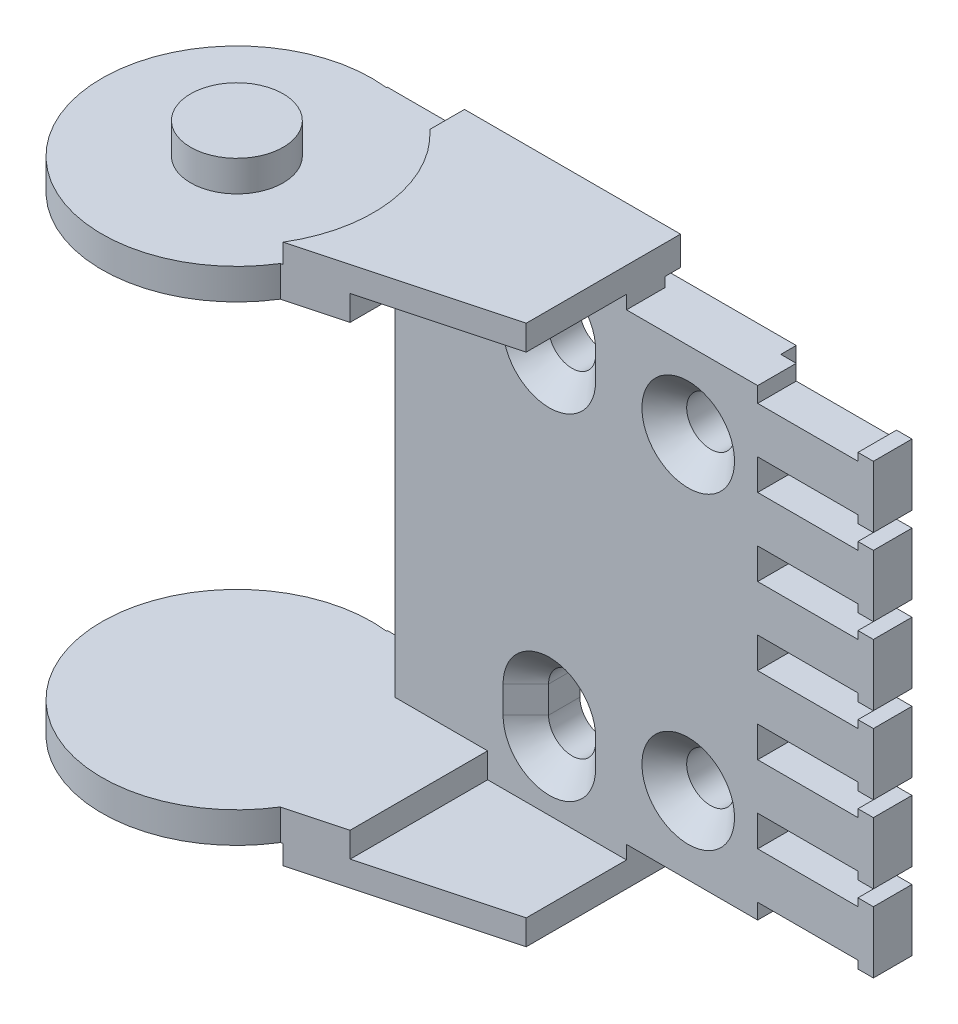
ISO-10303-21;
HEADER;
FILE_DESCRIPTION(('STEP AP214'),'2;1');
FILE_NAME('part.step','',(''),(''),'','','');
FILE_SCHEMA(('AUTOMOTIVE_DESIGN { 1 0 10303 214 1 1 1 1 }'));
ENDSEC;
DATA;
#1=APPLICATION_CONTEXT('core data for automotive mechanical design processes');
#2=APPLICATION_PROTOCOL_DEFINITION('international standard','automotive_design',2000,#1);
#3=PRODUCT_CONTEXT('',#1,'mechanical');
#4=PRODUCT('Part','Part','',(#3));
#5=PRODUCT_RELATED_PRODUCT_CATEGORY('part','',(#4));
#6=PRODUCT_DEFINITION_FORMATION('','',#4);
#7=PRODUCT_DEFINITION_CONTEXT('part definition',#1,'design');
#8=PRODUCT_DEFINITION('design','',#6,#7);
#9=PRODUCT_DEFINITION_SHAPE('','',#8);
#10=(LENGTH_UNIT() NAMED_UNIT(*) SI_UNIT(.MILLI.,.METRE.));
#11=(NAMED_UNIT(*) PLANE_ANGLE_UNIT() SI_UNIT($,.RADIAN.));
#12=(NAMED_UNIT(*) SI_UNIT($,.STERADIAN.) SOLID_ANGLE_UNIT());
#13=UNCERTAINTY_MEASURE_WITH_UNIT(LENGTH_MEASURE(1.E-05),#10,'distance_accuracy_value','');
#14=(GEOMETRIC_REPRESENTATION_CONTEXT(3) GLOBAL_UNCERTAINTY_ASSIGNED_CONTEXT((#13)) GLOBAL_UNIT_ASSIGNED_CONTEXT((#10,
#11,#12)) REPRESENTATION_CONTEXT('',''));
#15=CARTESIAN_POINT('',(0.,0.,0.));
#16=DIRECTION('',(0.,0.,1.));
#17=DIRECTION('',(1.,0.,0.));
#18=AXIS2_PLACEMENT_3D('',#15,#16,#17);
#19=CARTESIAN_POINT('',(70.,58.5,-13.));
#20=DIRECTION('',(-1.,0.,0.));
#21=DIRECTION('',(0.,0.,1.));
#22=AXIS2_PLACEMENT_3D('',#19,#20,#21);
#23=PLANE('',#22);
#24=DIRECTION('',(0.,0.,1.));
#25=VECTOR('',#24,1.);
#26=CARTESIAN_POINT('',(70.,56.5,-13.));
#27=LINE('',#26,#25);
#28=CARTESIAN_POINT('',(70.,56.5,-10.5));
#29=VERTEX_POINT('',#28);
#30=CARTESIAN_POINT('',(70.,56.5,-15.5));
#31=VERTEX_POINT('',#30);
#32=EDGE_CURVE('E703',#29,#31,#27,.F.);
#33=ORIENTED_EDGE('',*,*,#32,.F.);
#34=DIRECTION('',(0.,1.,0.));
#35=VECTOR('',#34,1.);
#36=CARTESIAN_POINT('',(70.,58.5,-10.5));
#37=LINE('',#36,#35);
#38=CARTESIAN_POINT('',(70.,57.5,-10.5));
#39=VERTEX_POINT('',#38);
#40=EDGE_CURVE('E792',#29,#39,#37,.T.);
#41=ORIENTED_EDGE('',*,*,#40,.T.);
#42=DIRECTION('',(0.,0.,1.));
#43=VECTOR('',#42,1.);
#44=CARTESIAN_POINT('',(70.,57.5,-13.));
#45=LINE('',#44,#43);
#46=CARTESIAN_POINT('',(70.,57.5,-15.5));
#47=VERTEX_POINT('',#46);
#48=EDGE_CURVE('E707',#47,#39,#45,.T.);
#49=ORIENTED_EDGE('',*,*,#48,.F.);
#50=DIRECTION('',(0.,1.,0.));
#51=VECTOR('',#50,1.);
#52=CARTESIAN_POINT('',(70.,58.5,-15.5));
#53=LINE('',#52,#51);
#54=EDGE_CURVE('E796',#47,#31,#53,.F.);
#55=ORIENTED_EDGE('',*,*,#54,.T.);
#56=EDGE_LOOP('',(#33,#41,#49,#55));
#57=FACE_BOUND('',#56,.T.);
#58=ADVANCED_FACE('F16',(#57),#23,.T.);
#59=CARTESIAN_POINT('',(70.,-1.5,-13.));
#60=DIRECTION('',(-1.,0.,0.));
#61=DIRECTION('',(0.,0.,1.));
#62=AXIS2_PLACEMENT_3D('',#59,#60,#61);
#63=PLANE('',#62);
#64=DIRECTION('',(0.,0.,-1.));
#65=VECTOR('',#64,1.);
#66=CARTESIAN_POINT('',(70.,0.5,-13.));
#67=LINE('',#66,#65);
#68=CARTESIAN_POINT('',(70.,0.5,-15.5));
#69=VERTEX_POINT('',#68);
#70=CARTESIAN_POINT('',(70.,0.5,-10.5));
#71=VERTEX_POINT('',#70);
#72=EDGE_CURVE('E706',#69,#71,#67,.F.);
#73=ORIENTED_EDGE('',*,*,#72,.F.);
#74=DIRECTION('',(0.,1.,0.));
#75=VECTOR('',#74,1.);
#76=CARTESIAN_POINT('',(70.,-1.5,-15.5));
#77=LINE('',#76,#75);
#78=CARTESIAN_POINT('',(70.,-0.5,-15.5));
#79=VERTEX_POINT('',#78);
#80=EDGE_CURVE('E786',#69,#79,#77,.F.);
#81=ORIENTED_EDGE('',*,*,#80,.T.);
#82=DIRECTION('',(0.,0.,-1.));
#83=VECTOR('',#82,1.);
#84=CARTESIAN_POINT('',(70.,-0.5,-13.));
#85=LINE('',#84,#83);
#86=CARTESIAN_POINT('',(70.,-0.5,-10.5));
#87=VERTEX_POINT('',#86);
#88=EDGE_CURVE('E744',#87,#79,#85,.T.);
#89=ORIENTED_EDGE('',*,*,#88,.F.);
#90=DIRECTION('',(0.,1.,0.));
#91=VECTOR('',#90,1.);
#92=CARTESIAN_POINT('',(70.,-1.5,-10.5));
#93=LINE('',#92,#91);
#94=EDGE_CURVE('E788',#87,#71,#93,.T.);
#95=ORIENTED_EDGE('',*,*,#94,.T.);
#96=EDGE_LOOP('',(#73,#81,#89,#95));
#97=FACE_BOUND('',#96,.T.);
#98=ADVANCED_FACE('F1718',(#97),#63,.T.);
#99=CARTESIAN_POINT('',(70.,8.5,-13.));
#100=DIRECTION('',(-1.,0.,0.));
#101=DIRECTION('',(0.,0.,1.));
#102=AXIS2_PLACEMENT_3D('',#99,#100,#101);
#103=PLANE('',#102);
#104=DIRECTION('',(0.,0.,1.));
#105=VECTOR('',#104,1.);
#106=CARTESIAN_POINT('',(70.,6.5,-13.));
#107=LINE('',#106,#105);
#108=CARTESIAN_POINT('',(70.,6.5,-10.5));
#109=VERTEX_POINT('',#108);
#110=CARTESIAN_POINT('',(70.,6.5,-15.5));
#111=VERTEX_POINT('',#110);
#112=EDGE_CURVE('E1429',#109,#111,#107,.F.);
#113=ORIENTED_EDGE('',*,*,#112,.F.);
#114=DIRECTION('',(0.,1.,0.));
#115=VECTOR('',#114,1.);
#116=CARTESIAN_POINT('',(70.,8.5,-10.5));
#117=LINE('',#116,#115);
#118=CARTESIAN_POINT('',(70.,7.5,-10.5));
#119=VERTEX_POINT('',#118);
#120=EDGE_CURVE('E782',#109,#119,#117,.T.);
#121=ORIENTED_EDGE('',*,*,#120,.T.);
#122=DIRECTION('',(0.,0.,1.));
#123=VECTOR('',#122,1.);
#124=CARTESIAN_POINT('',(70.,7.5,-13.));
#125=LINE('',#124,#123);
#126=CARTESIAN_POINT('',(70.,7.5,-15.5));
#127=VERTEX_POINT('',#126);
#128=EDGE_CURVE('E1432',#127,#119,#125,.T.);
#129=ORIENTED_EDGE('',*,*,#128,.F.);
#130=DIRECTION('',(0.,1.,0.));
#131=VECTOR('',#130,1.);
#132=CARTESIAN_POINT('',(70.,8.5,-15.5));
#133=LINE('',#132,#131);
#134=EDGE_CURVE('E784',#127,#111,#133,.F.);
#135=ORIENTED_EDGE('',*,*,#134,.T.);
#136=EDGE_LOOP('',(#113,#121,#129,#135));
#137=FACE_BOUND('',#136,.T.);
#138=ADVANCED_FACE('F1733',(#137),#103,.T.);
#139=CARTESIAN_POINT('',(70.,8.5,-13.));
#140=DIRECTION('',(-1.,0.,0.));
#141=DIRECTION('',(0.,0.,1.));
#142=AXIS2_PLACEMENT_3D('',#139,#140,#141);
#143=PLANE('',#142);
#144=DIRECTION('',(0.,0.,-1.));
#145=VECTOR('',#144,1.);
#146=CARTESIAN_POINT('',(70.,10.5,-13.));
#147=LINE('',#146,#145);
#148=CARTESIAN_POINT('',(70.,10.5,-15.5));
#149=VERTEX_POINT('',#148);
#150=CARTESIAN_POINT('',(70.,10.5,-10.5));
#151=VERTEX_POINT('',#150);
#152=EDGE_CURVE('E1422',#149,#151,#147,.F.);
#153=ORIENTED_EDGE('',*,*,#152,.F.);
#154=DIRECTION('',(0.,1.,0.));
#155=VECTOR('',#154,1.);
#156=CARTESIAN_POINT('',(70.,8.5,-15.5));
#157=LINE('',#156,#155);
#158=CARTESIAN_POINT('',(70.,9.5,-15.5));
#159=VERTEX_POINT('',#158);
#160=EDGE_CURVE('E778',#149,#159,#157,.F.);
#161=ORIENTED_EDGE('',*,*,#160,.T.);
#162=DIRECTION('',(0.,0.,-1.));
#163=VECTOR('',#162,1.);
#164=CARTESIAN_POINT('',(70.,9.5,-13.));
#165=LINE('',#164,#163);
#166=CARTESIAN_POINT('',(70.,9.5,-10.5));
#167=VERTEX_POINT('',#166);
#168=EDGE_CURVE('E1419',#167,#159,#165,.T.);
#169=ORIENTED_EDGE('',*,*,#168,.F.);
#170=DIRECTION('',(0.,1.,0.));
#171=VECTOR('',#170,1.);
#172=CARTESIAN_POINT('',(70.,8.5,-10.5));
#173=LINE('',#172,#171);
#174=EDGE_CURVE('E780',#167,#151,#173,.T.);
#175=ORIENTED_EDGE('',*,*,#174,.T.);
#176=EDGE_LOOP('',(#153,#161,#169,#175));
#177=FACE_BOUND('',#176,.T.);
#178=ADVANCED_FACE('F1748',(#177),#143,.T.);
#179=CARTESIAN_POINT('',(70.,18.5,-13.));
#180=DIRECTION('',(-1.,0.,0.));
#181=DIRECTION('',(0.,0.,1.));
#182=AXIS2_PLACEMENT_3D('',#179,#180,#181);
#183=PLANE('',#182);
#184=DIRECTION('',(0.,0.,1.));
#185=VECTOR('',#184,1.);
#186=CARTESIAN_POINT('',(70.,16.5,-13.));
#187=LINE('',#186,#185);
#188=CARTESIAN_POINT('',(70.,16.5,-10.5));
#189=VERTEX_POINT('',#188);
#190=CARTESIAN_POINT('',(70.,16.5,-15.5));
#191=VERTEX_POINT('',#190);
#192=EDGE_CURVE('E1409',#189,#191,#187,.F.);
#193=ORIENTED_EDGE('',*,*,#192,.F.);
#194=DIRECTION('',(0.,1.,0.));
#195=VECTOR('',#194,1.);
#196=CARTESIAN_POINT('',(70.,18.5,-10.5));
#197=LINE('',#196,#195);
#198=CARTESIAN_POINT('',(70.,17.5,-10.5));
#199=VERTEX_POINT('',#198);
#200=EDGE_CURVE('E774',#189,#199,#197,.T.);
#201=ORIENTED_EDGE('',*,*,#200,.T.);
#202=DIRECTION('',(0.,0.,1.));
#203=VECTOR('',#202,1.);
#204=CARTESIAN_POINT('',(70.,17.5,-13.));
#205=LINE('',#204,#203);
#206=CARTESIAN_POINT('',(70.,17.5,-15.5));
#207=VERTEX_POINT('',#206);
#208=EDGE_CURVE('E1412',#207,#199,#205,.T.);
#209=ORIENTED_EDGE('',*,*,#208,.F.);
#210=DIRECTION('',(0.,1.,0.));
#211=VECTOR('',#210,1.);
#212=CARTESIAN_POINT('',(70.,18.5,-15.5));
#213=LINE('',#212,#211);
#214=EDGE_CURVE('E776',#207,#191,#213,.F.);
#215=ORIENTED_EDGE('',*,*,#214,.T.);
#216=EDGE_LOOP('',(#193,#201,#209,#215));
#217=FACE_BOUND('',#216,.T.);
#218=ADVANCED_FACE('F1766',(#217),#183,.T.);
#219=CARTESIAN_POINT('',(70.,18.5,-13.));
#220=DIRECTION('',(-1.,0.,0.));
#221=DIRECTION('',(0.,0.,1.));
#222=AXIS2_PLACEMENT_3D('',#219,#220,#221);
#223=PLANE('',#222);
#224=DIRECTION('',(0.,0.,-1.));
#225=VECTOR('',#224,1.);
#226=CARTESIAN_POINT('',(70.,20.5,-13.));
#227=LINE('',#226,#225);
#228=CARTESIAN_POINT('',(70.,20.5,-15.5));
#229=VERTEX_POINT('',#228);
#230=CARTESIAN_POINT('',(70.,20.5,-10.5));
#231=VERTEX_POINT('',#230);
#232=EDGE_CURVE('E1402',#229,#231,#227,.F.);
#233=ORIENTED_EDGE('',*,*,#232,.F.);
#234=DIRECTION('',(0.,1.,0.));
#235=VECTOR('',#234,1.);
#236=CARTESIAN_POINT('',(70.,18.5,-15.5));
#237=LINE('',#236,#235);
#238=CARTESIAN_POINT('',(70.,19.5,-15.5));
#239=VERTEX_POINT('',#238);
#240=EDGE_CURVE('E770',#229,#239,#237,.F.);
#241=ORIENTED_EDGE('',*,*,#240,.T.);
#242=DIRECTION('',(0.,0.,-1.));
#243=VECTOR('',#242,1.);
#244=CARTESIAN_POINT('',(70.,19.5,-13.));
#245=LINE('',#244,#243);
#246=CARTESIAN_POINT('',(70.,19.5,-10.5));
#247=VERTEX_POINT('',#246);
#248=EDGE_CURVE('E1399',#247,#239,#245,.T.);
#249=ORIENTED_EDGE('',*,*,#248,.F.);
#250=DIRECTION('',(0.,1.,0.));
#251=VECTOR('',#250,1.);
#252=CARTESIAN_POINT('',(70.,18.5,-10.5));
#253=LINE('',#252,#251);
#254=EDGE_CURVE('E772',#247,#231,#253,.T.);
#255=ORIENTED_EDGE('',*,*,#254,.T.);
#256=EDGE_LOOP('',(#233,#241,#249,#255));
#257=FACE_BOUND('',#256,.T.);
#258=ADVANCED_FACE('F1781',(#257),#223,.T.);
#259=CARTESIAN_POINT('',(70.,28.5,-13.));
#260=DIRECTION('',(-1.,0.,0.));
#261=DIRECTION('',(0.,0.,1.));
#262=AXIS2_PLACEMENT_3D('',#259,#260,#261);
#263=PLANE('',#262);
#264=DIRECTION('',(0.,0.,1.));
#265=VECTOR('',#264,1.);
#266=CARTESIAN_POINT('',(70.,26.5,-13.));
#267=LINE('',#266,#265);
#268=CARTESIAN_POINT('',(70.,26.5,-10.5));
#269=VERTEX_POINT('',#268);
#270=CARTESIAN_POINT('',(70.,26.5,-15.5));
#271=VERTEX_POINT('',#270);
#272=EDGE_CURVE('E1389',#269,#271,#267,.F.);
#273=ORIENTED_EDGE('',*,*,#272,.F.);
#274=DIRECTION('',(0.,1.,0.));
#275=VECTOR('',#274,1.);
#276=CARTESIAN_POINT('',(70.,28.5,-10.5));
#277=LINE('',#276,#275);
#278=CARTESIAN_POINT('',(70.,27.5,-10.5));
#279=VERTEX_POINT('',#278);
#280=EDGE_CURVE('E766',#269,#279,#277,.T.);
#281=ORIENTED_EDGE('',*,*,#280,.T.);
#282=DIRECTION('',(0.,0.,1.));
#283=VECTOR('',#282,1.);
#284=CARTESIAN_POINT('',(70.,27.5,-13.));
#285=LINE('',#284,#283);
#286=CARTESIAN_POINT('',(70.,27.5,-15.5));
#287=VERTEX_POINT('',#286);
#288=EDGE_CURVE('E1392',#287,#279,#285,.T.);
#289=ORIENTED_EDGE('',*,*,#288,.F.);
#290=DIRECTION('',(0.,1.,0.));
#291=VECTOR('',#290,1.);
#292=CARTESIAN_POINT('',(70.,28.5,-15.5));
#293=LINE('',#292,#291);
#294=EDGE_CURVE('E768',#287,#271,#293,.F.);
#295=ORIENTED_EDGE('',*,*,#294,.T.);
#296=EDGE_LOOP('',(#273,#281,#289,#295));
#297=FACE_BOUND('',#296,.T.);
#298=ADVANCED_FACE('F1797',(#297),#263,.T.);
#299=CARTESIAN_POINT('',(70.,28.5,-13.));
#300=DIRECTION('',(-1.,0.,0.));
#301=DIRECTION('',(0.,0.,1.));
#302=AXIS2_PLACEMENT_3D('',#299,#300,#301);
#303=PLANE('',#302);
#304=DIRECTION('',(0.,0.,-1.));
#305=VECTOR('',#304,1.);
#306=CARTESIAN_POINT('',(70.,30.5,-13.));
#307=LINE('',#306,#305);
#308=CARTESIAN_POINT('',(70.,30.5,-15.5));
#309=VERTEX_POINT('',#308);
#310=CARTESIAN_POINT('',(70.,30.5,-10.5));
#311=VERTEX_POINT('',#310);
#312=EDGE_CURVE('E1382',#309,#311,#307,.F.);
#313=ORIENTED_EDGE('',*,*,#312,.F.);
#314=DIRECTION('',(0.,1.,0.));
#315=VECTOR('',#314,1.);
#316=CARTESIAN_POINT('',(70.,28.5,-15.5));
#317=LINE('',#316,#315);
#318=CARTESIAN_POINT('',(70.,29.5,-15.5));
#319=VERTEX_POINT('',#318);
#320=EDGE_CURVE('E762',#309,#319,#317,.F.);
#321=ORIENTED_EDGE('',*,*,#320,.T.);
#322=DIRECTION('',(0.,0.,-1.));
#323=VECTOR('',#322,1.);
#324=CARTESIAN_POINT('',(70.,29.5,-13.));
#325=LINE('',#324,#323);
#326=CARTESIAN_POINT('',(70.,29.5,-10.5));
#327=VERTEX_POINT('',#326);
#328=EDGE_CURVE('E1379',#327,#319,#325,.T.);
#329=ORIENTED_EDGE('',*,*,#328,.F.);
#330=DIRECTION('',(0.,1.,0.));
#331=VECTOR('',#330,1.);
#332=CARTESIAN_POINT('',(70.,28.5,-10.5));
#333=LINE('',#332,#331);
#334=EDGE_CURVE('E764',#327,#311,#333,.T.);
#335=ORIENTED_EDGE('',*,*,#334,.T.);
#336=EDGE_LOOP('',(#313,#321,#329,#335));
#337=FACE_BOUND('',#336,.T.);
#338=ADVANCED_FACE('F1814',(#337),#303,.T.);
#339=CARTESIAN_POINT('',(70.,38.5,-13.));
#340=DIRECTION('',(-1.,0.,0.));
#341=DIRECTION('',(0.,0.,1.));
#342=AXIS2_PLACEMENT_3D('',#339,#340,#341);
#343=PLANE('',#342);
#344=DIRECTION('',(0.,0.,1.));
#345=VECTOR('',#344,1.);
#346=CARTESIAN_POINT('',(70.,36.5,-13.));
#347=LINE('',#346,#345);
#348=CARTESIAN_POINT('',(70.,36.5,-10.5));
#349=VERTEX_POINT('',#348);
#350=CARTESIAN_POINT('',(70.,36.5,-15.5));
#351=VERTEX_POINT('',#350);
#352=EDGE_CURVE('E1369',#349,#351,#347,.F.);
#353=ORIENTED_EDGE('',*,*,#352,.F.);
#354=DIRECTION('',(0.,1.,0.));
#355=VECTOR('',#354,1.);
#356=CARTESIAN_POINT('',(70.,38.5,-10.5));
#357=LINE('',#356,#355);
#358=CARTESIAN_POINT('',(70.,37.5,-10.5));
#359=VERTEX_POINT('',#358);
#360=EDGE_CURVE('E758',#349,#359,#357,.T.);
#361=ORIENTED_EDGE('',*,*,#360,.T.);
#362=DIRECTION('',(0.,0.,1.));
#363=VECTOR('',#362,1.);
#364=CARTESIAN_POINT('',(70.,37.5,-13.));
#365=LINE('',#364,#363);
#366=CARTESIAN_POINT('',(70.,37.5,-15.5));
#367=VERTEX_POINT('',#366);
#368=EDGE_CURVE('E1372',#367,#359,#365,.T.);
#369=ORIENTED_EDGE('',*,*,#368,.F.);
#370=DIRECTION('',(0.,1.,0.));
#371=VECTOR('',#370,1.);
#372=CARTESIAN_POINT('',(70.,38.5,-15.5));
#373=LINE('',#372,#371);
#374=EDGE_CURVE('E760',#367,#351,#373,.F.);
#375=ORIENTED_EDGE('',*,*,#374,.T.);
#376=EDGE_LOOP('',(#353,#361,#369,#375));
#377=FACE_BOUND('',#376,.T.);
#378=ADVANCED_FACE('F1829',(#377),#343,.T.);
#379=CARTESIAN_POINT('',(70.,38.5,-13.));
#380=DIRECTION('',(-1.,0.,0.));
#381=DIRECTION('',(0.,0.,1.));
#382=AXIS2_PLACEMENT_3D('',#379,#380,#381);
#383=PLANE('',#382);
#384=DIRECTION('',(0.,0.,-1.));
#385=VECTOR('',#384,1.);
#386=CARTESIAN_POINT('',(70.,40.5,-13.));
#387=LINE('',#386,#385);
#388=CARTESIAN_POINT('',(70.,40.5,-15.5));
#389=VERTEX_POINT('',#388);
#390=CARTESIAN_POINT('',(70.,40.5,-10.5));
#391=VERTEX_POINT('',#390);
#392=EDGE_CURVE('E1362',#389,#391,#387,.F.);
#393=ORIENTED_EDGE('',*,*,#392,.F.);
#394=DIRECTION('',(0.,1.,0.));
#395=VECTOR('',#394,1.);
#396=CARTESIAN_POINT('',(70.,38.5,-15.5));
#397=LINE('',#396,#395);
#398=CARTESIAN_POINT('',(70.,39.5,-15.5));
#399=VERTEX_POINT('',#398);
#400=EDGE_CURVE('E754',#389,#399,#397,.F.);
#401=ORIENTED_EDGE('',*,*,#400,.T.);
#402=DIRECTION('',(0.,0.,-1.));
#403=VECTOR('',#402,1.);
#404=CARTESIAN_POINT('',(70.,39.5,-13.));
#405=LINE('',#404,#403);
#406=CARTESIAN_POINT('',(70.,39.5,-10.5));
#407=VERTEX_POINT('',#406);
#408=EDGE_CURVE('E1359',#407,#399,#405,.T.);
#409=ORIENTED_EDGE('',*,*,#408,.F.);
#410=DIRECTION('',(0.,1.,0.));
#411=VECTOR('',#410,1.);
#412=CARTESIAN_POINT('',(70.,38.5,-10.5));
#413=LINE('',#412,#411);
#414=EDGE_CURVE('E756',#407,#391,#413,.T.);
#415=ORIENTED_EDGE('',*,*,#414,.T.);
#416=EDGE_LOOP('',(#393,#401,#409,#415));
#417=FACE_BOUND('',#416,.T.);
#418=ADVANCED_FACE('F1844',(#417),#383,.T.);
#419=CARTESIAN_POINT('',(70.,48.5,-13.));
#420=DIRECTION('',(-1.,0.,0.));
#421=DIRECTION('',(0.,0.,1.));
#422=AXIS2_PLACEMENT_3D('',#419,#420,#421);
#423=PLANE('',#422);
#424=DIRECTION('',(0.,0.,1.));
#425=VECTOR('',#424,1.);
#426=CARTESIAN_POINT('',(70.,46.5,-13.));
#427=LINE('',#426,#425);
#428=CARTESIAN_POINT('',(70.,46.5,-10.5));
#429=VERTEX_POINT('',#428);
#430=CARTESIAN_POINT('',(70.,46.5,-15.5));
#431=VERTEX_POINT('',#430);
#432=EDGE_CURVE('E1349',#429,#431,#427,.F.);
#433=ORIENTED_EDGE('',*,*,#432,.F.);
#434=DIRECTION('',(0.,1.,0.));
#435=VECTOR('',#434,1.);
#436=CARTESIAN_POINT('',(70.,48.5,-10.5));
#437=LINE('',#436,#435);
#438=CARTESIAN_POINT('',(70.,47.5,-10.5));
#439=VERTEX_POINT('',#438);
#440=EDGE_CURVE('E750',#429,#439,#437,.T.);
#441=ORIENTED_EDGE('',*,*,#440,.T.);
#442=DIRECTION('',(0.,0.,1.));
#443=VECTOR('',#442,1.);
#444=CARTESIAN_POINT('',(70.,47.5,-13.));
#445=LINE('',#444,#443);
#446=CARTESIAN_POINT('',(70.,47.5,-15.5));
#447=VERTEX_POINT('',#446);
#448=EDGE_CURVE('E1352',#447,#439,#445,.T.);
#449=ORIENTED_EDGE('',*,*,#448,.F.);
#450=DIRECTION('',(0.,1.,0.));
#451=VECTOR('',#450,1.);
#452=CARTESIAN_POINT('',(70.,48.5,-15.5));
#453=LINE('',#452,#451);
#454=EDGE_CURVE('E752',#447,#431,#453,.F.);
#455=ORIENTED_EDGE('',*,*,#454,.T.);
#456=EDGE_LOOP('',(#433,#441,#449,#455));
#457=FACE_BOUND('',#456,.T.);
#458=ADVANCED_FACE('F1862',(#457),#423,.T.);
#459=CARTESIAN_POINT('',(70.,48.5,-13.));
#460=DIRECTION('',(-1.,0.,0.));
#461=DIRECTION('',(0.,0.,1.));
#462=AXIS2_PLACEMENT_3D('',#459,#460,#461);
#463=PLANE('',#462);
#464=DIRECTION('',(0.,0.,-1.));
#465=VECTOR('',#464,1.);
#466=CARTESIAN_POINT('',(70.,50.5,-13.));
#467=LINE('',#466,#465);
#468=CARTESIAN_POINT('',(70.,50.5,-15.5));
#469=VERTEX_POINT('',#468);
#470=CARTESIAN_POINT('',(70.,50.5,-10.5));
#471=VERTEX_POINT('',#470);
#472=EDGE_CURVE('E1342',#469,#471,#467,.F.);
#473=ORIENTED_EDGE('',*,*,#472,.F.);
#474=DIRECTION('',(0.,1.,0.));
#475=VECTOR('',#474,1.);
#476=CARTESIAN_POINT('',(70.,48.5,-15.5));
#477=LINE('',#476,#475);
#478=CARTESIAN_POINT('',(70.,49.5,-15.5));
#479=VERTEX_POINT('',#478);
#480=EDGE_CURVE('E710',#469,#479,#477,.F.);
#481=ORIENTED_EDGE('',*,*,#480,.T.);
#482=DIRECTION('',(0.,0.,-1.));
#483=VECTOR('',#482,1.);
#484=CARTESIAN_POINT('',(70.,49.5,-13.));
#485=LINE('',#484,#483);
#486=CARTESIAN_POINT('',(70.,49.5,-10.5));
#487=VERTEX_POINT('',#486);
#488=EDGE_CURVE('E1339',#487,#479,#485,.T.);
#489=ORIENTED_EDGE('',*,*,#488,.F.);
#490=DIRECTION('',(0.,1.,0.));
#491=VECTOR('',#490,1.);
#492=CARTESIAN_POINT('',(70.,48.5,-10.5));
#493=LINE('',#492,#491);
#494=EDGE_CURVE('E748',#487,#471,#493,.T.);
#495=ORIENTED_EDGE('',*,*,#494,.T.);
#496=EDGE_LOOP('',(#473,#481,#489,#495));
#497=FACE_BOUND('',#496,.T.);
#498=ADVANCED_FACE('F1877',(#497),#463,.T.);
#499=CARTESIAN_POINT('',(0.,-8.,0.));
#500=DIRECTION('',(0.,-1.,0.));
#501=DIRECTION('',(0.,0.,-1.));
#502=AXIS2_PLACEMENT_3D('',#499,#500,#501);
#503=PLANE('',#502);
#504=CARTESIAN_POINT('',(0.,-8.,0.));
#505=DIRECTION('',(0.,1.,0.));
#506=DIRECTION('',(0.,0.,1.));
#507=AXIS2_PLACEMENT_3D('',#504,#505,#506);
#508=CIRCLE('',#507,6.);
#509=CARTESIAN_POINT('',(0.,-8.,6.));
#510=VERTEX_POINT('',#509);
#511=EDGE_CURVE('E19',#510,#510,#508,.T.);
#512=ORIENTED_EDGE('',*,*,#511,.F.);
#513=EDGE_LOOP('',(#512));
#514=FACE_BOUND('',#513,.T.);
#515=ADVANCED_FACE('F2767',(#514),#503,.T.);
#516=CARTESIAN_POINT('',(0.,65.,0.));
#517=DIRECTION('',(0.,1.,0.));
#518=DIRECTION('',(0.,0.,1.));
#519=AXIS2_PLACEMENT_3D('',#516,#517,#518);
#520=PLANE('',#519);
#521=CARTESIAN_POINT('',(0.,65.,0.));
#522=DIRECTION('',(0.,1.,0.));
#523=DIRECTION('',(0.,0.,1.));
#524=AXIS2_PLACEMENT_3D('',#521,#522,#523);
#525=CIRCLE('',#524,6.);
#526=CARTESIAN_POINT('',(0.,65.,6.));
#527=VERTEX_POINT('',#526);
#528=EDGE_CURVE('E650',#527,#527,#525,.F.);
#529=ORIENTED_EDGE('',*,*,#528,.F.);
#530=EDGE_LOOP('',(#529));
#531=FACE_BOUND('',#530,.T.);
#532=ADVANCED_FACE('F2759',(#531),#520,.T.);
#533=CARTESIAN_POINT('',(71.,57.5,-13.));
#534=DIRECTION('',(0.,1.,0.));
#535=DIRECTION('',(0.,0.,1.));
#536=AXIS2_PLACEMENT_3D('',#533,#534,#535);
#537=PLANE('',#536);
#538=ORIENTED_EDGE('',*,*,#48,.T.);
#539=DIRECTION('',(1.,0.,0.));
#540=VECTOR('',#539,1.);
#541=CARTESIAN_POINT('',(72.,57.5,-10.5));
#542=LINE('',#541,#540);
#543=CARTESIAN_POINT('',(72.,57.5,-10.5));
#544=VERTEX_POINT('',#543);
#545=EDGE_CURVE('E886',#544,#39,#542,.F.);
#546=ORIENTED_EDGE('',*,*,#545,.F.);
#547=DIRECTION('',(0.,0.,-1.));
#548=VECTOR('',#547,1.);
#549=CARTESIAN_POINT('',(72.,57.5,-15.5));
#550=LINE('',#549,#548);
#551=CARTESIAN_POINT('',(72.,57.5,-15.5));
#552=VERTEX_POINT('',#551);
#553=EDGE_CURVE('E1336',#552,#544,#550,.F.);
#554=ORIENTED_EDGE('',*,*,#553,.F.);
#555=DIRECTION('',(-1.,0.,0.));
#556=VECTOR('',#555,1.);
#557=CARTESIAN_POINT('',(55.,57.5,-15.5));
#558=LINE('',#557,#556);
#559=EDGE_CURVE('E1218',#47,#552,#558,.F.);
#560=ORIENTED_EDGE('',*,*,#559,.F.);
#561=EDGE_LOOP('',(#538,#546,#554,#560));
#562=FACE_BOUND('',#561,.T.);
#563=ADVANCED_FACE('F1620',(#562),#537,.T.);
#564=CARTESIAN_POINT('',(63.5,56.5,-13.));
#565=DIRECTION('',(0.,1.,0.));
#566=DIRECTION('',(0.,0.,1.));
#567=AXIS2_PLACEMENT_3D('',#564,#565,#566);
#568=PLANE('',#567);
#569=DIRECTION('',(0.,0.,-1.));
#570=VECTOR('',#569,1.);
#571=CARTESIAN_POINT('',(57.,56.5,-13.));
#572=LINE('',#571,#570);
#573=CARTESIAN_POINT('',(57.,56.5,-10.5));
#574=VERTEX_POINT('',#573);
#575=CARTESIAN_POINT('',(57.,56.5,-15.5));
#576=VERTEX_POINT('',#575);
#577=EDGE_CURVE('E1221',#574,#576,#572,.T.);
#578=ORIENTED_EDGE('',*,*,#577,.F.);
#579=DIRECTION('',(1.,0.,0.));
#580=VECTOR('',#579,1.);
#581=CARTESIAN_POINT('',(72.,56.5,-10.5));
#582=LINE('',#581,#580);
#583=EDGE_CURVE('E1614',#29,#574,#582,.F.);
#584=ORIENTED_EDGE('',*,*,#583,.F.);
#585=ORIENTED_EDGE('',*,*,#32,.T.);
#586=DIRECTION('',(-1.,0.,0.));
#587=VECTOR('',#586,1.);
#588=CARTESIAN_POINT('',(55.,56.5,-15.5));
#589=LINE('',#588,#587);
#590=EDGE_CURVE('E727',#576,#31,#589,.F.);
#591=ORIENTED_EDGE('',*,*,#590,.F.);
#592=EDGE_LOOP('',(#578,#584,#585,#591));
#593=FACE_BOUND('',#592,.T.);
#594=ADVANCED_FACE('F1633',(#593),#568,.T.);
#595=CARTESIAN_POINT('',(63.5,0.5,-13.));
#596=DIRECTION('',(0.,-1.,0.));
#597=DIRECTION('',(0.,0.,-1.));
#598=AXIS2_PLACEMENT_3D('',#595,#596,#597);
#599=PLANE('',#598);
#600=ORIENTED_EDGE('',*,*,#72,.T.);
#601=DIRECTION('',(1.,0.,0.));
#602=VECTOR('',#601,1.);
#603=CARTESIAN_POINT('',(72.,0.5,-10.5));
#604=LINE('',#603,#602);
#605=CARTESIAN_POINT('',(57.,0.5,-10.5));
#606=VERTEX_POINT('',#605);
#607=EDGE_CURVE('E812',#606,#71,#604,.T.);
#608=ORIENTED_EDGE('',*,*,#607,.F.);
#609=DIRECTION('',(0.,0.,-1.));
#610=VECTOR('',#609,1.);
#611=CARTESIAN_POINT('',(57.,0.5,-13.));
#612=LINE('',#611,#610);
#613=CARTESIAN_POINT('',(57.,0.5,-15.5));
#614=VERTEX_POINT('',#613);
#615=EDGE_CURVE('E726',#614,#606,#612,.F.);
#616=ORIENTED_EDGE('',*,*,#615,.F.);
#617=DIRECTION('',(-1.,0.,0.));
#618=VECTOR('',#617,1.);
#619=CARTESIAN_POINT('',(55.,0.5,-15.5));
#620=LINE('',#619,#618);
#621=EDGE_CURVE('E730',#69,#614,#620,.T.);
#622=ORIENTED_EDGE('',*,*,#621,.F.);
#623=EDGE_LOOP('',(#600,#608,#616,#622));
#624=FACE_BOUND('',#623,.T.);
#625=ADVANCED_FACE('F1713',(#624),#599,.T.);
#626=CARTESIAN_POINT('',(71.,-0.5,-13.));
#627=DIRECTION('',(0.,-1.,0.));
#628=DIRECTION('',(0.,0.,-1.));
#629=AXIS2_PLACEMENT_3D('',#626,#627,#628);
#630=PLANE('',#629);
#631=DIRECTION('',(0.,0.,-1.));
#632=VECTOR('',#631,1.);
#633=CARTESIAN_POINT('',(72.,-0.5,-15.5));
#634=LINE('',#633,#632);
#635=CARTESIAN_POINT('',(72.,-0.5,-10.5));
#636=VERTEX_POINT('',#635);
#637=CARTESIAN_POINT('',(72.,-0.5,-15.5));
#638=VERTEX_POINT('',#637);
#639=EDGE_CURVE('E800',#636,#638,#634,.T.);
#640=ORIENTED_EDGE('',*,*,#639,.F.);
#641=DIRECTION('',(1.,0.,0.));
#642=VECTOR('',#641,1.);
#643=CARTESIAN_POINT('',(72.,-0.5,-10.5));
#644=LINE('',#643,#642);
#645=EDGE_CURVE('E808',#87,#636,#644,.T.);
#646=ORIENTED_EDGE('',*,*,#645,.F.);
#647=ORIENTED_EDGE('',*,*,#88,.T.);
#648=DIRECTION('',(-1.,0.,0.));
#649=VECTOR('',#648,1.);
#650=CARTESIAN_POINT('',(55.,-0.5,-15.5));
#651=LINE('',#650,#649);
#652=EDGE_CURVE('E733',#638,#79,#651,.T.);
#653=ORIENTED_EDGE('',*,*,#652,.F.);
#654=EDGE_LOOP('',(#640,#646,#647,#653));
#655=FACE_BOUND('',#654,.T.);
#656=ADVANCED_FACE('F1721',(#655),#630,.T.);
#657=CARTESIAN_POINT('',(72.,-1.5,-15.5));
#658=DIRECTION('',(1.,0.,0.));
#659=DIRECTION('',(0.,0.,-1.));
#660=AXIS2_PLACEMENT_3D('',#657,#658,#659);
#661=PLANE('',#660);
#662=ORIENTED_EDGE('',*,*,#639,.T.);
#663=DIRECTION('',(0.,1.,0.));
#664=VECTOR('',#663,1.);
#665=CARTESIAN_POINT('',(72.,-1.5,-15.5));
#666=LINE('',#665,#664);
#667=CARTESIAN_POINT('',(72.,7.5,-15.5));
#668=VERTEX_POINT('',#667);
#669=EDGE_CURVE('E805',#668,#638,#666,.F.);
#670=ORIENTED_EDGE('',*,*,#669,.F.);
#671=DIRECTION('',(0.,0.,1.));
#672=VECTOR('',#671,1.);
#673=CARTESIAN_POINT('',(72.,7.5,-13.));
#674=LINE('',#673,#672);
#675=CARTESIAN_POINT('',(72.,7.5,-10.5));
#676=VERTEX_POINT('',#675);
#677=EDGE_CURVE('E1435',#676,#668,#674,.F.);
#678=ORIENTED_EDGE('',*,*,#677,.F.);
#679=DIRECTION('',(0.,1.,0.));
#680=VECTOR('',#679,1.);
#681=CARTESIAN_POINT('',(72.,-1.5,-10.5));
#682=LINE('',#681,#680);
#683=EDGE_CURVE('E811',#636,#676,#682,.T.);
#684=ORIENTED_EDGE('',*,*,#683,.F.);
#685=EDGE_LOOP('',(#662,#670,#678,#684));
#686=FACE_BOUND('',#685,.T.);
#687=ADVANCED_FACE('F1725',(#686),#661,.T.);
#688=CARTESIAN_POINT('',(71.,7.5,-13.));
#689=DIRECTION('',(0.,1.,0.));
#690=DIRECTION('',(0.,0.,1.));
#691=AXIS2_PLACEMENT_3D('',#688,#689,#690);
#692=PLANE('',#691);
#693=ORIENTED_EDGE('',*,*,#128,.T.);
#694=DIRECTION('',(1.,0.,0.));
#695=VECTOR('',#694,1.);
#696=CARTESIAN_POINT('',(72.,7.5,-10.5));
#697=LINE('',#696,#695);
#698=EDGE_CURVE('E1607',#676,#119,#697,.F.);
#699=ORIENTED_EDGE('',*,*,#698,.F.);
#700=ORIENTED_EDGE('',*,*,#677,.T.);
#701=DIRECTION('',(-1.,0.,0.));
#702=VECTOR('',#701,1.);
#703=CARTESIAN_POINT('',(55.,7.5,-15.5));
#704=LINE('',#703,#702);
#705=EDGE_CURVE('E1128',#127,#668,#704,.F.);
#706=ORIENTED_EDGE('',*,*,#705,.F.);
#707=EDGE_LOOP('',(#693,#699,#700,#706));
#708=FACE_BOUND('',#707,.T.);
#709=ADVANCED_FACE('F1729',(#708),#692,.T.);
#710=CARTESIAN_POINT('',(63.5,6.5,-13.));
#711=DIRECTION('',(0.,1.,0.));
#712=DIRECTION('',(0.,0.,1.));
#713=AXIS2_PLACEMENT_3D('',#710,#711,#712);
#714=PLANE('',#713);
#715=DIRECTION('',(0.,0.,-1.));
#716=VECTOR('',#715,1.);
#717=CARTESIAN_POINT('',(57.,6.5,-13.));
#718=LINE('',#717,#716);
#719=CARTESIAN_POINT('',(57.,6.5,-10.5));
#720=VERTEX_POINT('',#719);
#721=CARTESIAN_POINT('',(57.,6.5,-15.5));
#722=VERTEX_POINT('',#721);
#723=EDGE_CURVE('E1427',#720,#722,#718,.T.);
#724=ORIENTED_EDGE('',*,*,#723,.F.);
#725=DIRECTION('',(1.,0.,0.));
#726=VECTOR('',#725,1.);
#727=CARTESIAN_POINT('',(72.,6.5,-10.5));
#728=LINE('',#727,#726);
#729=EDGE_CURVE('E1604',#109,#720,#728,.F.);
#730=ORIENTED_EDGE('',*,*,#729,.F.);
#731=ORIENTED_EDGE('',*,*,#112,.T.);
#732=DIRECTION('',(-1.,0.,0.));
#733=VECTOR('',#732,1.);
#734=CARTESIAN_POINT('',(55.,6.5,-15.5));
#735=LINE('',#734,#733);
#736=EDGE_CURVE('E1131',#722,#111,#735,.F.);
#737=ORIENTED_EDGE('',*,*,#736,.F.);
#738=EDGE_LOOP('',(#724,#730,#731,#737));
#739=FACE_BOUND('',#738,.T.);
#740=ADVANCED_FACE('F1737',(#739),#714,.T.);
#741=CARTESIAN_POINT('',(57.,8.5,-13.));
#742=DIRECTION('',(1.,0.,0.));
#743=DIRECTION('',(0.,0.,-1.));
#744=AXIS2_PLACEMENT_3D('',#741,#742,#743);
#745=PLANE('',#744);
#746=DIRECTION('',(0.,0.,-1.));
#747=VECTOR('',#746,1.);
#748=CARTESIAN_POINT('',(57.,10.5,-13.));
#749=LINE('',#748,#747);
#750=CARTESIAN_POINT('',(57.,10.5,-10.5));
#751=VERTEX_POINT('',#750);
#752=CARTESIAN_POINT('',(57.,10.5,-15.5));
#753=VERTEX_POINT('',#752);
#754=EDGE_CURVE('E1425',#751,#753,#749,.T.);
#755=ORIENTED_EDGE('',*,*,#754,.F.);
#756=DIRECTION('',(0.,1.,0.));
#757=VECTOR('',#756,1.);
#758=CARTESIAN_POINT('',(57.,-1.5,-10.5));
#759=LINE('',#758,#757);
#760=EDGE_CURVE('E1601',#720,#751,#759,.T.);
#761=ORIENTED_EDGE('',*,*,#760,.F.);
#762=ORIENTED_EDGE('',*,*,#723,.T.);
#763=DIRECTION('',(0.,1.,0.));
#764=VECTOR('',#763,1.);
#765=CARTESIAN_POINT('',(57.,-1.5,-15.5));
#766=LINE('',#765,#764);
#767=EDGE_CURVE('E1134',#753,#722,#766,.F.);
#768=ORIENTED_EDGE('',*,*,#767,.F.);
#769=EDGE_LOOP('',(#755,#761,#762,#768));
#770=FACE_BOUND('',#769,.T.);
#771=ADVANCED_FACE('F1741',(#770),#745,.T.);
#772=CARTESIAN_POINT('',(63.5,10.5,-13.));
#773=DIRECTION('',(0.,-1.,0.));
#774=DIRECTION('',(0.,0.,-1.));
#775=AXIS2_PLACEMENT_3D('',#772,#773,#774);
#776=PLANE('',#775);
#777=ORIENTED_EDGE('',*,*,#152,.T.);
#778=DIRECTION('',(1.,0.,0.));
#779=VECTOR('',#778,1.);
#780=CARTESIAN_POINT('',(72.,10.5,-10.5));
#781=LINE('',#780,#779);
#782=EDGE_CURVE('E1598',#751,#151,#781,.T.);
#783=ORIENTED_EDGE('',*,*,#782,.F.);
#784=ORIENTED_EDGE('',*,*,#754,.T.);
#785=DIRECTION('',(-1.,0.,0.));
#786=VECTOR('',#785,1.);
#787=CARTESIAN_POINT('',(55.,10.5,-15.5));
#788=LINE('',#787,#786);
#789=EDGE_CURVE('E1137',#149,#753,#788,.T.);
#790=ORIENTED_EDGE('',*,*,#789,.F.);
#791=EDGE_LOOP('',(#777,#783,#784,#790));
#792=FACE_BOUND('',#791,.T.);
#793=ADVANCED_FACE('F1745',(#792),#776,.T.);
#794=CARTESIAN_POINT('',(71.,9.5,-13.));
#795=DIRECTION('',(0.,-1.,0.));
#796=DIRECTION('',(0.,0.,-1.));
#797=AXIS2_PLACEMENT_3D('',#794,#795,#796);
#798=PLANE('',#797);
#799=DIRECTION('',(0.,0.,-1.));
#800=VECTOR('',#799,1.);
#801=CARTESIAN_POINT('',(72.,9.5,-15.5));
#802=LINE('',#801,#800);
#803=CARTESIAN_POINT('',(72.,9.5,-10.5));
#804=VERTEX_POINT('',#803);
#805=CARTESIAN_POINT('',(72.,9.5,-15.5));
#806=VERTEX_POINT('',#805);
#807=EDGE_CURVE('E1417',#804,#806,#802,.T.);
#808=ORIENTED_EDGE('',*,*,#807,.F.);
#809=DIRECTION('',(1.,0.,0.));
#810=VECTOR('',#809,1.);
#811=CARTESIAN_POINT('',(72.,9.5,-10.5));
#812=LINE('',#811,#810);
#813=EDGE_CURVE('E1595',#167,#804,#812,.T.);
#814=ORIENTED_EDGE('',*,*,#813,.F.);
#815=ORIENTED_EDGE('',*,*,#168,.T.);
#816=DIRECTION('',(-1.,0.,0.));
#817=VECTOR('',#816,1.);
#818=CARTESIAN_POINT('',(55.,9.5,-15.5));
#819=LINE('',#818,#817);
#820=EDGE_CURVE('E1140',#806,#159,#819,.T.);
#821=ORIENTED_EDGE('',*,*,#820,.F.);
#822=EDGE_LOOP('',(#808,#814,#815,#821));
#823=FACE_BOUND('',#822,.T.);
#824=ADVANCED_FACE('F1753',(#823),#798,.T.);
#825=CARTESIAN_POINT('',(72.,-1.5,-15.5));
#826=DIRECTION('',(1.,0.,0.));
#827=DIRECTION('',(0.,0.,-1.));
#828=AXIS2_PLACEMENT_3D('',#825,#826,#827);
#829=PLANE('',#828);
#830=ORIENTED_EDGE('',*,*,#807,.T.);
#831=DIRECTION('',(0.,1.,0.));
#832=VECTOR('',#831,1.);
#833=CARTESIAN_POINT('',(72.,-1.5,-15.5));
#834=LINE('',#833,#832);
#835=CARTESIAN_POINT('',(72.,17.5,-15.5));
#836=VERTEX_POINT('',#835);
#837=EDGE_CURVE('E1143',#836,#806,#834,.F.);
#838=ORIENTED_EDGE('',*,*,#837,.F.);
#839=DIRECTION('',(0.,0.,1.));
#840=VECTOR('',#839,1.);
#841=CARTESIAN_POINT('',(72.,17.5,-13.));
#842=LINE('',#841,#840);
#843=CARTESIAN_POINT('',(72.,17.5,-10.5));
#844=VERTEX_POINT('',#843);
#845=EDGE_CURVE('E1415',#844,#836,#842,.F.);
#846=ORIENTED_EDGE('',*,*,#845,.F.);
#847=DIRECTION('',(0.,1.,0.));
#848=VECTOR('',#847,1.);
#849=CARTESIAN_POINT('',(72.,-1.5,-10.5));
#850=LINE('',#849,#848);
#851=EDGE_CURVE('E1592',#804,#844,#850,.T.);
#852=ORIENTED_EDGE('',*,*,#851,.F.);
#853=EDGE_LOOP('',(#830,#838,#846,#852));
#854=FACE_BOUND('',#853,.T.);
#855=ADVANCED_FACE('F1757',(#854),#829,.T.);
#856=CARTESIAN_POINT('',(71.,17.5,-13.));
#857=DIRECTION('',(0.,1.,0.));
#858=DIRECTION('',(0.,0.,1.));
#859=AXIS2_PLACEMENT_3D('',#856,#857,#858);
#860=PLANE('',#859);
#861=ORIENTED_EDGE('',*,*,#208,.T.);
#862=DIRECTION('',(1.,0.,0.));
#863=VECTOR('',#862,1.);
#864=CARTESIAN_POINT('',(72.,17.5,-10.5));
#865=LINE('',#864,#863);
#866=EDGE_CURVE('E1589',#844,#199,#865,.F.);
#867=ORIENTED_EDGE('',*,*,#866,.F.);
#868=ORIENTED_EDGE('',*,*,#845,.T.);
#869=DIRECTION('',(-1.,0.,0.));
#870=VECTOR('',#869,1.);
#871=CARTESIAN_POINT('',(55.,17.5,-15.5));
#872=LINE('',#871,#870);
#873=EDGE_CURVE('E1146',#207,#836,#872,.F.);
#874=ORIENTED_EDGE('',*,*,#873,.F.);
#875=EDGE_LOOP('',(#861,#867,#868,#874));
#876=FACE_BOUND('',#875,.T.);
#877=ADVANCED_FACE('F1761',(#876),#860,.T.);
#878=CARTESIAN_POINT('',(63.5,16.5,-13.));
#879=DIRECTION('',(0.,1.,0.));
#880=DIRECTION('',(0.,0.,1.));
#881=AXIS2_PLACEMENT_3D('',#878,#879,#880);
#882=PLANE('',#881);
#883=DIRECTION('',(0.,0.,-1.));
#884=VECTOR('',#883,1.);
#885=CARTESIAN_POINT('',(57.,16.5,-13.));
#886=LINE('',#885,#884);
#887=CARTESIAN_POINT('',(57.,16.5,-10.5));
#888=VERTEX_POINT('',#887);
#889=CARTESIAN_POINT('',(57.,16.5,-15.5));
#890=VERTEX_POINT('',#889);
#891=EDGE_CURVE('E1407',#888,#890,#886,.T.);
#892=ORIENTED_EDGE('',*,*,#891,.F.);
#893=DIRECTION('',(1.,0.,0.));
#894=VECTOR('',#893,1.);
#895=CARTESIAN_POINT('',(72.,16.5,-10.5));
#896=LINE('',#895,#894);
#897=EDGE_CURVE('E1586',#189,#888,#896,.F.);
#898=ORIENTED_EDGE('',*,*,#897,.F.);
#899=ORIENTED_EDGE('',*,*,#192,.T.);
#900=DIRECTION('',(-1.,0.,0.));
#901=VECTOR('',#900,1.);
#902=CARTESIAN_POINT('',(55.,16.5,-15.5));
#903=LINE('',#902,#901);
#904=EDGE_CURVE('E1149',#890,#191,#903,.F.);
#905=ORIENTED_EDGE('',*,*,#904,.F.);
#906=EDGE_LOOP('',(#892,#898,#899,#905));
#907=FACE_BOUND('',#906,.T.);
#908=ADVANCED_FACE('F1769',(#907),#882,.T.);
#909=CARTESIAN_POINT('',(57.,18.5,-13.));
#910=DIRECTION('',(1.,0.,0.));
#911=DIRECTION('',(0.,0.,-1.));
#912=AXIS2_PLACEMENT_3D('',#909,#910,#911);
#913=PLANE('',#912);
#914=DIRECTION('',(0.,0.,-1.));
#915=VECTOR('',#914,1.);
#916=CARTESIAN_POINT('',(57.,20.5,-13.));
#917=LINE('',#916,#915);
#918=CARTESIAN_POINT('',(57.,20.5,-10.5));
#919=VERTEX_POINT('',#918);
#920=CARTESIAN_POINT('',(57.,20.5,-15.5));
#921=VERTEX_POINT('',#920);
#922=EDGE_CURVE('E1405',#919,#921,#917,.T.);
#923=ORIENTED_EDGE('',*,*,#922,.F.);
#924=DIRECTION('',(0.,1.,0.));
#925=VECTOR('',#924,1.);
#926=CARTESIAN_POINT('',(57.,-1.5,-10.5));
#927=LINE('',#926,#925);
#928=EDGE_CURVE('E1583',#888,#919,#927,.T.);
#929=ORIENTED_EDGE('',*,*,#928,.F.);
#930=ORIENTED_EDGE('',*,*,#891,.T.);
#931=DIRECTION('',(0.,1.,0.));
#932=VECTOR('',#931,1.);
#933=CARTESIAN_POINT('',(57.,-1.5,-15.5));
#934=LINE('',#933,#932);
#935=EDGE_CURVE('E1152',#921,#890,#934,.F.);
#936=ORIENTED_EDGE('',*,*,#935,.F.);
#937=EDGE_LOOP('',(#923,#929,#930,#936));
#938=FACE_BOUND('',#937,.T.);
#939=ADVANCED_FACE('F1773',(#938),#913,.T.);
#940=CARTESIAN_POINT('',(63.5,20.5,-13.));
#941=DIRECTION('',(0.,-1.,0.));
#942=DIRECTION('',(0.,0.,-1.));
#943=AXIS2_PLACEMENT_3D('',#940,#941,#942);
#944=PLANE('',#943);
#945=ORIENTED_EDGE('',*,*,#232,.T.);
#946=DIRECTION('',(1.,0.,0.));
#947=VECTOR('',#946,1.);
#948=CARTESIAN_POINT('',(72.,20.5,-10.5));
#949=LINE('',#948,#947);
#950=EDGE_CURVE('E1580',#919,#231,#949,.T.);
#951=ORIENTED_EDGE('',*,*,#950,.F.);
#952=ORIENTED_EDGE('',*,*,#922,.T.);
#953=DIRECTION('',(-1.,0.,0.));
#954=VECTOR('',#953,1.);
#955=CARTESIAN_POINT('',(55.,20.5,-15.5));
#956=LINE('',#955,#954);
#957=EDGE_CURVE('E1155',#229,#921,#956,.T.);
#958=ORIENTED_EDGE('',*,*,#957,.F.);
#959=EDGE_LOOP('',(#945,#951,#952,#958));
#960=FACE_BOUND('',#959,.T.);
#961=ADVANCED_FACE('F1777',(#960),#944,.T.);
#962=CARTESIAN_POINT('',(71.,19.5,-13.));
#963=DIRECTION('',(0.,-1.,0.));
#964=DIRECTION('',(0.,0.,-1.));
#965=AXIS2_PLACEMENT_3D('',#962,#963,#964);
#966=PLANE('',#965);
#967=DIRECTION('',(0.,0.,-1.));
#968=VECTOR('',#967,1.);
#969=CARTESIAN_POINT('',(72.,19.5,-15.5));
#970=LINE('',#969,#968);
#971=CARTESIAN_POINT('',(72.,19.5,-10.5));
#972=VERTEX_POINT('',#971);
#973=CARTESIAN_POINT('',(72.,19.5,-15.5));
#974=VERTEX_POINT('',#973);
#975=EDGE_CURVE('E1397',#972,#974,#970,.T.);
#976=ORIENTED_EDGE('',*,*,#975,.F.);
#977=DIRECTION('',(1.,0.,0.));
#978=VECTOR('',#977,1.);
#979=CARTESIAN_POINT('',(72.,19.5,-10.5));
#980=LINE('',#979,#978);
#981=EDGE_CURVE('E1577',#247,#972,#980,.T.);
#982=ORIENTED_EDGE('',*,*,#981,.F.);
#983=ORIENTED_EDGE('',*,*,#248,.T.);
#984=DIRECTION('',(-1.,0.,0.));
#985=VECTOR('',#984,1.);
#986=CARTESIAN_POINT('',(55.,19.5,-15.5));
#987=LINE('',#986,#985);
#988=EDGE_CURVE('E1158',#974,#239,#987,.T.);
#989=ORIENTED_EDGE('',*,*,#988,.F.);
#990=EDGE_LOOP('',(#976,#982,#983,#989));
#991=FACE_BOUND('',#990,.T.);
#992=ADVANCED_FACE('F1785',(#991),#966,.T.);
#993=CARTESIAN_POINT('',(72.,-1.5,-15.5));
#994=DIRECTION('',(1.,0.,0.));
#995=DIRECTION('',(0.,0.,-1.));
#996=AXIS2_PLACEMENT_3D('',#993,#994,#995);
#997=PLANE('',#996);
#998=ORIENTED_EDGE('',*,*,#975,.T.);
#999=DIRECTION('',(0.,1.,0.));
#1000=VECTOR('',#999,1.);
#1001=CARTESIAN_POINT('',(72.,-1.5,-15.5));
#1002=LINE('',#1001,#1000);
#1003=CARTESIAN_POINT('',(72.,27.5,-15.5));
#1004=VERTEX_POINT('',#1003);
#1005=EDGE_CURVE('E1161',#1004,#974,#1002,.F.);
#1006=ORIENTED_EDGE('',*,*,#1005,.F.);
#1007=DIRECTION('',(0.,0.,1.));
#1008=VECTOR('',#1007,1.);
#1009=CARTESIAN_POINT('',(72.,27.5,-13.));
#1010=LINE('',#1009,#1008);
#1011=CARTESIAN_POINT('',(72.,27.5,-10.5));
#1012=VERTEX_POINT('',#1011);
#1013=EDGE_CURVE('E1395',#1012,#1004,#1010,.F.);
#1014=ORIENTED_EDGE('',*,*,#1013,.F.);
#1015=DIRECTION('',(0.,1.,0.));
#1016=VECTOR('',#1015,1.);
#1017=CARTESIAN_POINT('',(72.,-1.5,-10.5));
#1018=LINE('',#1017,#1016);
#1019=EDGE_CURVE('E1574',#972,#1012,#1018,.T.);
#1020=ORIENTED_EDGE('',*,*,#1019,.F.);
#1021=EDGE_LOOP('',(#998,#1006,#1014,#1020));
#1022=FACE_BOUND('',#1021,.T.);
#1023=ADVANCED_FACE('F1789',(#1022),#997,.T.);
#1024=CARTESIAN_POINT('',(71.,27.5,-13.));
#1025=DIRECTION('',(0.,1.,0.));
#1026=DIRECTION('',(0.,0.,1.));
#1027=AXIS2_PLACEMENT_3D('',#1024,#1025,#1026);
#1028=PLANE('',#1027);
#1029=ORIENTED_EDGE('',*,*,#288,.T.);
#1030=DIRECTION('',(1.,0.,0.));
#1031=VECTOR('',#1030,1.);
#1032=CARTESIAN_POINT('',(72.,27.5,-10.5));
#1033=LINE('',#1032,#1031);
#1034=EDGE_CURVE('E1571',#1012,#279,#1033,.F.);
#1035=ORIENTED_EDGE('',*,*,#1034,.F.);
#1036=ORIENTED_EDGE('',*,*,#1013,.T.);
#1037=DIRECTION('',(-1.,0.,0.));
#1038=VECTOR('',#1037,1.);
#1039=CARTESIAN_POINT('',(55.,27.5,-15.5));
#1040=LINE('',#1039,#1038);
#1041=EDGE_CURVE('E1164',#287,#1004,#1040,.F.);
#1042=ORIENTED_EDGE('',*,*,#1041,.F.);
#1043=EDGE_LOOP('',(#1029,#1035,#1036,#1042));
#1044=FACE_BOUND('',#1043,.T.);
#1045=ADVANCED_FACE('F1793',(#1044),#1028,.T.);
#1046=CARTESIAN_POINT('',(63.5,26.5,-13.));
#1047=DIRECTION('',(0.,1.,0.));
#1048=DIRECTION('',(0.,0.,1.));
#1049=AXIS2_PLACEMENT_3D('',#1046,#1047,#1048);
#1050=PLANE('',#1049);
#1051=DIRECTION('',(0.,0.,-1.));
#1052=VECTOR('',#1051,1.);
#1053=CARTESIAN_POINT('',(57.,26.5,-13.));
#1054=LINE('',#1053,#1052);
#1055=CARTESIAN_POINT('',(57.,26.5,-10.5));
#1056=VERTEX_POINT('',#1055);
#1057=CARTESIAN_POINT('',(57.,26.5,-15.5));
#1058=VERTEX_POINT('',#1057);
#1059=EDGE_CURVE('E1387',#1056,#1058,#1054,.T.);
#1060=ORIENTED_EDGE('',*,*,#1059,.F.);
#1061=DIRECTION('',(1.,0.,0.));
#1062=VECTOR('',#1061,1.);
#1063=CARTESIAN_POINT('',(72.,26.5,-10.5));
#1064=LINE('',#1063,#1062);
#1065=EDGE_CURVE('E1568',#269,#1056,#1064,.F.);
#1066=ORIENTED_EDGE('',*,*,#1065,.F.);
#1067=ORIENTED_EDGE('',*,*,#272,.T.);
#1068=DIRECTION('',(-1.,0.,0.));
#1069=VECTOR('',#1068,1.);
#1070=CARTESIAN_POINT('',(55.,26.5,-15.5));
#1071=LINE('',#1070,#1069);
#1072=EDGE_CURVE('E1167',#1058,#271,#1071,.F.);
#1073=ORIENTED_EDGE('',*,*,#1072,.F.);
#1074=EDGE_LOOP('',(#1060,#1066,#1067,#1073));
#1075=FACE_BOUND('',#1074,.T.);
#1076=ADVANCED_FACE('F1801',(#1075),#1050,.T.);
#1077=CARTESIAN_POINT('',(57.,28.5,-13.));
#1078=DIRECTION('',(1.,0.,0.));
#1079=DIRECTION('',(0.,0.,-1.));
#1080=AXIS2_PLACEMENT_3D('',#1077,#1078,#1079);
#1081=PLANE('',#1080);
#1082=DIRECTION('',(0.,0.,-1.));
#1083=VECTOR('',#1082,1.);
#1084=CARTESIAN_POINT('',(57.,30.5,-13.));
#1085=LINE('',#1084,#1083);
#1086=CARTESIAN_POINT('',(57.,30.5,-10.5));
#1087=VERTEX_POINT('',#1086);
#1088=CARTESIAN_POINT('',(57.,30.5,-15.5));
#1089=VERTEX_POINT('',#1088);
#1090=EDGE_CURVE('E1385',#1087,#1089,#1085,.T.);
#1091=ORIENTED_EDGE('',*,*,#1090,.F.);
#1092=DIRECTION('',(0.,1.,0.));
#1093=VECTOR('',#1092,1.);
#1094=CARTESIAN_POINT('',(57.,-1.5,-10.5));
#1095=LINE('',#1094,#1093);
#1096=EDGE_CURVE('E1565',#1056,#1087,#1095,.T.);
#1097=ORIENTED_EDGE('',*,*,#1096,.F.);
#1098=ORIENTED_EDGE('',*,*,#1059,.T.);
#1099=DIRECTION('',(0.,1.,0.));
#1100=VECTOR('',#1099,1.);
#1101=CARTESIAN_POINT('',(57.,-1.5,-15.5));
#1102=LINE('',#1101,#1100);
#1103=EDGE_CURVE('E1170',#1089,#1058,#1102,.F.);
#1104=ORIENTED_EDGE('',*,*,#1103,.F.);
#1105=EDGE_LOOP('',(#1091,#1097,#1098,#1104));
#1106=FACE_BOUND('',#1105,.T.);
#1107=ADVANCED_FACE('F1805',(#1106),#1081,.T.);
#1108=CARTESIAN_POINT('',(63.5,30.5,-13.));
#1109=DIRECTION('',(0.,-1.,0.));
#1110=DIRECTION('',(0.,0.,-1.));
#1111=AXIS2_PLACEMENT_3D('',#1108,#1109,#1110);
#1112=PLANE('',#1111);
#1113=ORIENTED_EDGE('',*,*,#312,.T.);
#1114=DIRECTION('',(1.,0.,0.));
#1115=VECTOR('',#1114,1.);
#1116=CARTESIAN_POINT('',(72.,30.5,-10.5));
#1117=LINE('',#1116,#1115);
#1118=EDGE_CURVE('E1562',#1087,#311,#1117,.T.);
#1119=ORIENTED_EDGE('',*,*,#1118,.F.);
#1120=ORIENTED_EDGE('',*,*,#1090,.T.);
#1121=DIRECTION('',(-1.,0.,0.));
#1122=VECTOR('',#1121,1.);
#1123=CARTESIAN_POINT('',(55.,30.5,-15.5));
#1124=LINE('',#1123,#1122);
#1125=EDGE_CURVE('E1173',#309,#1089,#1124,.T.);
#1126=ORIENTED_EDGE('',*,*,#1125,.F.);
#1127=EDGE_LOOP('',(#1113,#1119,#1120,#1126));
#1128=FACE_BOUND('',#1127,.T.);
#1129=ADVANCED_FACE('F1809',(#1128),#1112,.T.);
#1130=CARTESIAN_POINT('',(71.,29.5,-13.));
#1131=DIRECTION('',(0.,-1.,0.));
#1132=DIRECTION('',(0.,0.,-1.));
#1133=AXIS2_PLACEMENT_3D('',#1130,#1131,#1132);
#1134=PLANE('',#1133);
#1135=DIRECTION('',(0.,0.,-1.));
#1136=VECTOR('',#1135,1.);
#1137=CARTESIAN_POINT('',(72.,29.5,-15.5));
#1138=LINE('',#1137,#1136);
#1139=CARTESIAN_POINT('',(72.,29.5,-10.5));
#1140=VERTEX_POINT('',#1139);
#1141=CARTESIAN_POINT('',(72.,29.5,-15.5));
#1142=VERTEX_POINT('',#1141);
#1143=EDGE_CURVE('E1377',#1140,#1142,#1138,.T.);
#1144=ORIENTED_EDGE('',*,*,#1143,.F.);
#1145=DIRECTION('',(1.,0.,0.));
#1146=VECTOR('',#1145,1.);
#1147=CARTESIAN_POINT('',(72.,29.5,-10.5));
#1148=LINE('',#1147,#1146);
#1149=EDGE_CURVE('E1559',#327,#1140,#1148,.T.);
#1150=ORIENTED_EDGE('',*,*,#1149,.F.);
#1151=ORIENTED_EDGE('',*,*,#328,.T.);
#1152=DIRECTION('',(-1.,0.,0.));
#1153=VECTOR('',#1152,1.);
#1154=CARTESIAN_POINT('',(55.,29.5,-15.5));
#1155=LINE('',#1154,#1153);
#1156=EDGE_CURVE('E1176',#1142,#319,#1155,.T.);
#1157=ORIENTED_EDGE('',*,*,#1156,.F.);
#1158=EDGE_LOOP('',(#1144,#1150,#1151,#1157));
#1159=FACE_BOUND('',#1158,.T.);
#1160=ADVANCED_FACE('F1817',(#1159),#1134,.T.);
#1161=CARTESIAN_POINT('',(72.,-1.5,-15.5));
#1162=DIRECTION('',(1.,0.,0.));
#1163=DIRECTION('',(0.,0.,-1.));
#1164=AXIS2_PLACEMENT_3D('',#1161,#1162,#1163);
#1165=PLANE('',#1164);
#1166=ORIENTED_EDGE('',*,*,#1143,.T.);
#1167=DIRECTION('',(0.,1.,0.));
#1168=VECTOR('',#1167,1.);
#1169=CARTESIAN_POINT('',(72.,-1.5,-15.5));
#1170=LINE('',#1169,#1168);
#1171=CARTESIAN_POINT('',(72.,37.5,-15.5));
#1172=VERTEX_POINT('',#1171);
#1173=EDGE_CURVE('E1179',#1172,#1142,#1170,.F.);
#1174=ORIENTED_EDGE('',*,*,#1173,.F.);
#1175=DIRECTION('',(0.,0.,1.));
#1176=VECTOR('',#1175,1.);
#1177=CARTESIAN_POINT('',(72.,37.5,-13.));
#1178=LINE('',#1177,#1176);
#1179=CARTESIAN_POINT('',(72.,37.5,-10.5));
#1180=VERTEX_POINT('',#1179);
#1181=EDGE_CURVE('E1375',#1180,#1172,#1178,.F.);
#1182=ORIENTED_EDGE('',*,*,#1181,.F.);
#1183=DIRECTION('',(0.,1.,0.));
#1184=VECTOR('',#1183,1.);
#1185=CARTESIAN_POINT('',(72.,-1.5,-10.5));
#1186=LINE('',#1185,#1184);
#1187=EDGE_CURVE('E1556',#1140,#1180,#1186,.T.);
#1188=ORIENTED_EDGE('',*,*,#1187,.F.);
#1189=EDGE_LOOP('',(#1166,#1174,#1182,#1188));
#1190=FACE_BOUND('',#1189,.T.);
#1191=ADVANCED_FACE('F1821',(#1190),#1165,.T.);
#1192=CARTESIAN_POINT('',(71.,37.5,-13.));
#1193=DIRECTION('',(0.,1.,0.));
#1194=DIRECTION('',(0.,0.,1.));
#1195=AXIS2_PLACEMENT_3D('',#1192,#1193,#1194);
#1196=PLANE('',#1195);
#1197=ORIENTED_EDGE('',*,*,#368,.T.);
#1198=DIRECTION('',(1.,0.,0.));
#1199=VECTOR('',#1198,1.);
#1200=CARTESIAN_POINT('',(72.,37.5,-10.5));
#1201=LINE('',#1200,#1199);
#1202=EDGE_CURVE('E1553',#1180,#359,#1201,.F.);
#1203=ORIENTED_EDGE('',*,*,#1202,.F.);
#1204=ORIENTED_EDGE('',*,*,#1181,.T.);
#1205=DIRECTION('',(-1.,0.,0.));
#1206=VECTOR('',#1205,1.);
#1207=CARTESIAN_POINT('',(55.,37.5,-15.5));
#1208=LINE('',#1207,#1206);
#1209=EDGE_CURVE('E1182',#367,#1172,#1208,.F.);
#1210=ORIENTED_EDGE('',*,*,#1209,.F.);
#1211=EDGE_LOOP('',(#1197,#1203,#1204,#1210));
#1212=FACE_BOUND('',#1211,.T.);
#1213=ADVANCED_FACE('F1825',(#1212),#1196,.T.);
#1214=CARTESIAN_POINT('',(63.5,36.5,-13.));
#1215=DIRECTION('',(0.,1.,0.));
#1216=DIRECTION('',(0.,0.,1.));
#1217=AXIS2_PLACEMENT_3D('',#1214,#1215,#1216);
#1218=PLANE('',#1217);
#1219=DIRECTION('',(0.,0.,-1.));
#1220=VECTOR('',#1219,1.);
#1221=CARTESIAN_POINT('',(57.,36.5,-13.));
#1222=LINE('',#1221,#1220);
#1223=CARTESIAN_POINT('',(57.,36.5,-10.5));
#1224=VERTEX_POINT('',#1223);
#1225=CARTESIAN_POINT('',(57.,36.5,-15.5));
#1226=VERTEX_POINT('',#1225);
#1227=EDGE_CURVE('E1367',#1224,#1226,#1222,.T.);
#1228=ORIENTED_EDGE('',*,*,#1227,.F.);
#1229=DIRECTION('',(1.,0.,0.));
#1230=VECTOR('',#1229,1.);
#1231=CARTESIAN_POINT('',(72.,36.5,-10.5));
#1232=LINE('',#1231,#1230);
#1233=EDGE_CURVE('E1550',#349,#1224,#1232,.F.);
#1234=ORIENTED_EDGE('',*,*,#1233,.F.);
#1235=ORIENTED_EDGE('',*,*,#352,.T.);
#1236=DIRECTION('',(-1.,0.,0.));
#1237=VECTOR('',#1236,1.);
#1238=CARTESIAN_POINT('',(55.,36.5,-15.5));
#1239=LINE('',#1238,#1237);
#1240=EDGE_CURVE('E1185',#1226,#351,#1239,.F.);
#1241=ORIENTED_EDGE('',*,*,#1240,.F.);
#1242=EDGE_LOOP('',(#1228,#1234,#1235,#1241));
#1243=FACE_BOUND('',#1242,.T.);
#1244=ADVANCED_FACE('F1833',(#1243),#1218,.T.);
#1245=CARTESIAN_POINT('',(57.,38.5,-13.));
#1246=DIRECTION('',(1.,0.,0.));
#1247=DIRECTION('',(0.,0.,-1.));
#1248=AXIS2_PLACEMENT_3D('',#1245,#1246,#1247);
#1249=PLANE('',#1248);
#1250=DIRECTION('',(0.,0.,-1.));
#1251=VECTOR('',#1250,1.);
#1252=CARTESIAN_POINT('',(57.,40.5,-13.));
#1253=LINE('',#1252,#1251);
#1254=CARTESIAN_POINT('',(57.,40.5,-10.5));
#1255=VERTEX_POINT('',#1254);
#1256=CARTESIAN_POINT('',(57.,40.5,-15.5));
#1257=VERTEX_POINT('',#1256);
#1258=EDGE_CURVE('E1365',#1255,#1257,#1253,.T.);
#1259=ORIENTED_EDGE('',*,*,#1258,.F.);
#1260=DIRECTION('',(0.,1.,0.));
#1261=VECTOR('',#1260,1.);
#1262=CARTESIAN_POINT('',(57.,-1.5,-10.5));
#1263=LINE('',#1262,#1261);
#1264=EDGE_CURVE('E1547',#1224,#1255,#1263,.T.);
#1265=ORIENTED_EDGE('',*,*,#1264,.F.);
#1266=ORIENTED_EDGE('',*,*,#1227,.T.);
#1267=DIRECTION('',(0.,1.,0.));
#1268=VECTOR('',#1267,1.);
#1269=CARTESIAN_POINT('',(57.,-1.5,-15.5));
#1270=LINE('',#1269,#1268);
#1271=EDGE_CURVE('E1188',#1257,#1226,#1270,.F.);
#1272=ORIENTED_EDGE('',*,*,#1271,.F.);
#1273=EDGE_LOOP('',(#1259,#1265,#1266,#1272));
#1274=FACE_BOUND('',#1273,.T.);
#1275=ADVANCED_FACE('F1837',(#1274),#1249,.T.);
#1276=CARTESIAN_POINT('',(63.5,40.5,-13.));
#1277=DIRECTION('',(0.,-1.,0.));
#1278=DIRECTION('',(0.,0.,-1.));
#1279=AXIS2_PLACEMENT_3D('',#1276,#1277,#1278);
#1280=PLANE('',#1279);
#1281=ORIENTED_EDGE('',*,*,#392,.T.);
#1282=DIRECTION('',(1.,0.,0.));
#1283=VECTOR('',#1282,1.);
#1284=CARTESIAN_POINT('',(72.,40.5,-10.5));
#1285=LINE('',#1284,#1283);
#1286=EDGE_CURVE('E1544',#1255,#391,#1285,.T.);
#1287=ORIENTED_EDGE('',*,*,#1286,.F.);
#1288=ORIENTED_EDGE('',*,*,#1258,.T.);
#1289=DIRECTION('',(-1.,0.,0.));
#1290=VECTOR('',#1289,1.);
#1291=CARTESIAN_POINT('',(55.,40.5,-15.5));
#1292=LINE('',#1291,#1290);
#1293=EDGE_CURVE('E1191',#389,#1257,#1292,.T.);
#1294=ORIENTED_EDGE('',*,*,#1293,.F.);
#1295=EDGE_LOOP('',(#1281,#1287,#1288,#1294));
#1296=FACE_BOUND('',#1295,.T.);
#1297=ADVANCED_FACE('F1841',(#1296),#1280,.T.);
#1298=CARTESIAN_POINT('',(71.,39.5,-13.));
#1299=DIRECTION('',(0.,-1.,0.));
#1300=DIRECTION('',(0.,0.,-1.));
#1301=AXIS2_PLACEMENT_3D('',#1298,#1299,#1300);
#1302=PLANE('',#1301);
#1303=DIRECTION('',(0.,0.,-1.));
#1304=VECTOR('',#1303,1.);
#1305=CARTESIAN_POINT('',(72.,39.5,-15.5));
#1306=LINE('',#1305,#1304);
#1307=CARTESIAN_POINT('',(72.,39.5,-10.5));
#1308=VERTEX_POINT('',#1307);
#1309=CARTESIAN_POINT('',(72.,39.5,-15.5));
#1310=VERTEX_POINT('',#1309);
#1311=EDGE_CURVE('E1357',#1308,#1310,#1306,.T.);
#1312=ORIENTED_EDGE('',*,*,#1311,.F.);
#1313=DIRECTION('',(1.,0.,0.));
#1314=VECTOR('',#1313,1.);
#1315=CARTESIAN_POINT('',(72.,39.5,-10.5));
#1316=LINE('',#1315,#1314);
#1317=EDGE_CURVE('E1541',#407,#1308,#1316,.T.);
#1318=ORIENTED_EDGE('',*,*,#1317,.F.);
#1319=ORIENTED_EDGE('',*,*,#408,.T.);
#1320=DIRECTION('',(-1.,0.,0.));
#1321=VECTOR('',#1320,1.);
#1322=CARTESIAN_POINT('',(55.,39.5,-15.5));
#1323=LINE('',#1322,#1321);
#1324=EDGE_CURVE('E1194',#1310,#399,#1323,.T.);
#1325=ORIENTED_EDGE('',*,*,#1324,.F.);
#1326=EDGE_LOOP('',(#1312,#1318,#1319,#1325));
#1327=FACE_BOUND('',#1326,.T.);
#1328=ADVANCED_FACE('F1849',(#1327),#1302,.T.);
#1329=CARTESIAN_POINT('',(72.,-1.5,-15.5));
#1330=DIRECTION('',(1.,0.,0.));
#1331=DIRECTION('',(0.,0.,-1.));
#1332=AXIS2_PLACEMENT_3D('',#1329,#1330,#1331);
#1333=PLANE('',#1332);
#1334=ORIENTED_EDGE('',*,*,#1311,.T.);
#1335=DIRECTION('',(0.,1.,0.));
#1336=VECTOR('',#1335,1.);
#1337=CARTESIAN_POINT('',(72.,-1.5,-15.5));
#1338=LINE('',#1337,#1336);
#1339=CARTESIAN_POINT('',(72.,47.5,-15.5));
#1340=VERTEX_POINT('',#1339);
#1341=EDGE_CURVE('E1197',#1340,#1310,#1338,.F.);
#1342=ORIENTED_EDGE('',*,*,#1341,.F.);
#1343=DIRECTION('',(0.,0.,1.));
#1344=VECTOR('',#1343,1.);
#1345=CARTESIAN_POINT('',(72.,47.5,-13.));
#1346=LINE('',#1345,#1344);
#1347=CARTESIAN_POINT('',(72.,47.5,-10.5));
#1348=VERTEX_POINT('',#1347);
#1349=EDGE_CURVE('E1355',#1348,#1340,#1346,.F.);
#1350=ORIENTED_EDGE('',*,*,#1349,.F.);
#1351=DIRECTION('',(0.,1.,0.));
#1352=VECTOR('',#1351,1.);
#1353=CARTESIAN_POINT('',(72.,-1.5,-10.5));
#1354=LINE('',#1353,#1352);
#1355=EDGE_CURVE('E1538',#1308,#1348,#1354,.T.);
#1356=ORIENTED_EDGE('',*,*,#1355,.F.);
#1357=EDGE_LOOP('',(#1334,#1342,#1350,#1356));
#1358=FACE_BOUND('',#1357,.T.);
#1359=ADVANCED_FACE('F1853',(#1358),#1333,.T.);
#1360=CARTESIAN_POINT('',(71.,47.5,-13.));
#1361=DIRECTION('',(0.,1.,0.));
#1362=DIRECTION('',(0.,0.,1.));
#1363=AXIS2_PLACEMENT_3D('',#1360,#1361,#1362);
#1364=PLANE('',#1363);
#1365=ORIENTED_EDGE('',*,*,#448,.T.);
#1366=DIRECTION('',(1.,0.,0.));
#1367=VECTOR('',#1366,1.);
#1368=CARTESIAN_POINT('',(72.,47.5,-10.5));
#1369=LINE('',#1368,#1367);
#1370=EDGE_CURVE('E1535',#1348,#439,#1369,.F.);
#1371=ORIENTED_EDGE('',*,*,#1370,.F.);
#1372=ORIENTED_EDGE('',*,*,#1349,.T.);
#1373=DIRECTION('',(-1.,0.,0.));
#1374=VECTOR('',#1373,1.);
#1375=CARTESIAN_POINT('',(55.,47.5,-15.5));
#1376=LINE('',#1375,#1374);
#1377=EDGE_CURVE('E1200',#447,#1340,#1376,.F.);
#1378=ORIENTED_EDGE('',*,*,#1377,.F.);
#1379=EDGE_LOOP('',(#1365,#1371,#1372,#1378));
#1380=FACE_BOUND('',#1379,.T.);
#1381=ADVANCED_FACE('F1857',(#1380),#1364,.T.);
#1382=CARTESIAN_POINT('',(63.5,46.5,-13.));
#1383=DIRECTION('',(0.,1.,0.));
#1384=DIRECTION('',(0.,0.,1.));
#1385=AXIS2_PLACEMENT_3D('',#1382,#1383,#1384);
#1386=PLANE('',#1385);
#1387=DIRECTION('',(0.,0.,-1.));
#1388=VECTOR('',#1387,1.);
#1389=CARTESIAN_POINT('',(57.,46.5,-13.));
#1390=LINE('',#1389,#1388);
#1391=CARTESIAN_POINT('',(57.,46.5,-10.5));
#1392=VERTEX_POINT('',#1391);
#1393=CARTESIAN_POINT('',(57.,46.5,-15.5));
#1394=VERTEX_POINT('',#1393);
#1395=EDGE_CURVE('E1347',#1392,#1394,#1390,.T.);
#1396=ORIENTED_EDGE('',*,*,#1395,.F.);
#1397=DIRECTION('',(1.,0.,0.));
#1398=VECTOR('',#1397,1.);
#1399=CARTESIAN_POINT('',(72.,46.5,-10.5));
#1400=LINE('',#1399,#1398);
#1401=EDGE_CURVE('E1532',#429,#1392,#1400,.F.);
#1402=ORIENTED_EDGE('',*,*,#1401,.F.);
#1403=ORIENTED_EDGE('',*,*,#432,.T.);
#1404=DIRECTION('',(-1.,0.,0.));
#1405=VECTOR('',#1404,1.);
#1406=CARTESIAN_POINT('',(55.,46.5,-15.5));
#1407=LINE('',#1406,#1405);
#1408=EDGE_CURVE('E1203',#1394,#431,#1407,.F.);
#1409=ORIENTED_EDGE('',*,*,#1408,.F.);
#1410=EDGE_LOOP('',(#1396,#1402,#1403,#1409));
#1411=FACE_BOUND('',#1410,.T.);
#1412=ADVANCED_FACE('F1865',(#1411),#1386,.T.);
#1413=CARTESIAN_POINT('',(57.,48.5,-13.));
#1414=DIRECTION('',(1.,0.,0.));
#1415=DIRECTION('',(0.,0.,-1.));
#1416=AXIS2_PLACEMENT_3D('',#1413,#1414,#1415);
#1417=PLANE('',#1416);
#1418=DIRECTION('',(0.,0.,-1.));
#1419=VECTOR('',#1418,1.);
#1420=CARTESIAN_POINT('',(57.,50.5,-13.));
#1421=LINE('',#1420,#1419);
#1422=CARTESIAN_POINT('',(57.,50.5,-10.5));
#1423=VERTEX_POINT('',#1422);
#1424=CARTESIAN_POINT('',(57.,50.5,-15.5));
#1425=VERTEX_POINT('',#1424);
#1426=EDGE_CURVE('E1345',#1423,#1425,#1421,.T.);
#1427=ORIENTED_EDGE('',*,*,#1426,.F.);
#1428=DIRECTION('',(0.,1.,0.));
#1429=VECTOR('',#1428,1.);
#1430=CARTESIAN_POINT('',(57.,-1.5,-10.5));
#1431=LINE('',#1430,#1429);
#1432=EDGE_CURVE('E1529',#1392,#1423,#1431,.T.);
#1433=ORIENTED_EDGE('',*,*,#1432,.F.);
#1434=ORIENTED_EDGE('',*,*,#1395,.T.);
#1435=DIRECTION('',(0.,1.,0.));
#1436=VECTOR('',#1435,1.);
#1437=CARTESIAN_POINT('',(57.,-1.5,-15.5));
#1438=LINE('',#1437,#1436);
#1439=EDGE_CURVE('E1206',#1425,#1394,#1438,.F.);
#1440=ORIENTED_EDGE('',*,*,#1439,.F.);
#1441=EDGE_LOOP('',(#1427,#1433,#1434,#1440));
#1442=FACE_BOUND('',#1441,.T.);
#1443=ADVANCED_FACE('F1869',(#1442),#1417,.T.);
#1444=CARTESIAN_POINT('',(63.5,50.5,-13.));
#1445=DIRECTION('',(0.,-1.,0.));
#1446=DIRECTION('',(0.,0.,-1.));
#1447=AXIS2_PLACEMENT_3D('',#1444,#1445,#1446);
#1448=PLANE('',#1447);
#1449=ORIENTED_EDGE('',*,*,#472,.T.);
#1450=DIRECTION('',(1.,0.,0.));
#1451=VECTOR('',#1450,1.);
#1452=CARTESIAN_POINT('',(72.,50.5,-10.5));
#1453=LINE('',#1452,#1451);
#1454=EDGE_CURVE('E1526',#1423,#471,#1453,.T.);
#1455=ORIENTED_EDGE('',*,*,#1454,.F.);
#1456=ORIENTED_EDGE('',*,*,#1426,.T.);
#1457=DIRECTION('',(-1.,0.,0.));
#1458=VECTOR('',#1457,1.);
#1459=CARTESIAN_POINT('',(55.,50.5,-15.5));
#1460=LINE('',#1459,#1458);
#1461=EDGE_CURVE('E1209',#469,#1425,#1460,.T.);
#1462=ORIENTED_EDGE('',*,*,#1461,.F.);
#1463=EDGE_LOOP('',(#1449,#1455,#1456,#1462));
#1464=FACE_BOUND('',#1463,.T.);
#1465=ADVANCED_FACE('F1873',(#1464),#1448,.T.);
#1466=CARTESIAN_POINT('',(71.,49.5,-13.));
#1467=DIRECTION('',(0.,-1.,0.));
#1468=DIRECTION('',(0.,0.,-1.));
#1469=AXIS2_PLACEMENT_3D('',#1466,#1467,#1468);
#1470=PLANE('',#1469);
#1471=DIRECTION('',(0.,0.,-1.));
#1472=VECTOR('',#1471,1.);
#1473=CARTESIAN_POINT('',(72.,49.5,-15.5));
#1474=LINE('',#1473,#1472);
#1475=CARTESIAN_POINT('',(72.,49.5,-10.5));
#1476=VERTEX_POINT('',#1475);
#1477=CARTESIAN_POINT('',(72.,49.5,-15.5));
#1478=VERTEX_POINT('',#1477);
#1479=EDGE_CURVE('E1299',#1476,#1478,#1474,.T.);
#1480=ORIENTED_EDGE('',*,*,#1479,.F.);
#1481=DIRECTION('',(1.,0.,0.));
#1482=VECTOR('',#1481,1.);
#1483=CARTESIAN_POINT('',(72.,49.5,-10.5));
#1484=LINE('',#1483,#1482);
#1485=EDGE_CURVE('E1524',#487,#1476,#1484,.T.);
#1486=ORIENTED_EDGE('',*,*,#1485,.F.);
#1487=ORIENTED_EDGE('',*,*,#488,.T.);
#1488=DIRECTION('',(-1.,0.,0.));
#1489=VECTOR('',#1488,1.);
#1490=CARTESIAN_POINT('',(55.,49.5,-15.5));
#1491=LINE('',#1490,#1489);
#1492=EDGE_CURVE('E1212',#1478,#479,#1491,.T.);
#1493=ORIENTED_EDGE('',*,*,#1492,.F.);
#1494=EDGE_LOOP('',(#1480,#1486,#1487,#1493));
#1495=FACE_BOUND('',#1494,.T.);
#1496=ADVANCED_FACE('F1880',(#1495),#1470,.T.);
#1497=CARTESIAN_POINT('',(72.,-1.5,-15.5));
#1498=DIRECTION('',(1.,0.,0.));
#1499=DIRECTION('',(0.,0.,-1.));
#1500=AXIS2_PLACEMENT_3D('',#1497,#1498,#1499);
#1501=PLANE('',#1500);
#1502=ORIENTED_EDGE('',*,*,#1479,.T.);
#1503=DIRECTION('',(0.,1.,0.));
#1504=VECTOR('',#1503,1.);
#1505=CARTESIAN_POINT('',(72.,-1.5,-15.5));
#1506=LINE('',#1505,#1504);
#1507=EDGE_CURVE('E1215',#552,#1478,#1506,.F.);
#1508=ORIENTED_EDGE('',*,*,#1507,.F.);
#1509=ORIENTED_EDGE('',*,*,#553,.T.);
#1510=DIRECTION('',(0.,1.,0.));
#1511=VECTOR('',#1510,1.);
#1512=CARTESIAN_POINT('',(72.,-1.5,-10.5));
#1513=LINE('',#1512,#1511);
#1514=EDGE_CURVE('E883',#1476,#544,#1513,.T.);
#1515=ORIENTED_EDGE('',*,*,#1514,.F.);
#1516=EDGE_LOOP('',(#1502,#1508,#1509,#1515));
#1517=FACE_BOUND('',#1516,.T.);
#1518=ADVANCED_FACE('F1625',(#1517),#1501,.T.);
#1519=CARTESIAN_POINT('',(26.95,52.,-13.45));
#1520=DIRECTION('',(-0.707106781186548,0.,-0.707106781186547));
#1521=DIRECTION('',(-0.707106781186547,0.,0.707106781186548));
#1522=AXIS2_PLACEMENT_3D('',#1519,#1520,#1521);
#1523=PLANE('',#1522);
#1524=DIRECTION('',(0.,1.,0.));
#1525=VECTOR('',#1524,1.);
#1526=CARTESIAN_POINT('',(26.95,52.,-13.45));
#1527=LINE('',#1526,#1525);
#1528=CARTESIAN_POINT('',(26.9500000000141,48.5,-13.4500000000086));
#1529=VERTEX_POINT('',#1528);
#1530=CARTESIAN_POINT('',(26.9500000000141,52.,-13.4500000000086));
#1531=VERTEX_POINT('',#1530);
#1532=EDGE_CURVE('E1264',#1529,#1531,#1527,.T.);
#1533=ORIENTED_EDGE('',*,*,#1532,.T.);
#1534=DIRECTION('',(0.707106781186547,0.,-0.707106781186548));
#1535=VECTOR('',#1534,1.);
#1536=CARTESIAN_POINT('',(-498940.,52.0000000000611,498953.5));
#1537=LINE('',#1536,#1535);
#1538=CARTESIAN_POINT('',(24.0000000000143,52.,-10.4999999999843));
#1539=VERTEX_POINT('',#1538);
#1540=EDGE_CURVE('E1261',#1531,#1539,#1537,.F.);
#1541=ORIENTED_EDGE('',*,*,#1540,.T.);
#1542=DIRECTION('',(0.,1.,0.));
#1543=VECTOR('',#1542,1.);
#1544=CARTESIAN_POINT('',(24.,-1.5,-10.5));
#1545=LINE('',#1544,#1543);
#1546=CARTESIAN_POINT('',(24.0000000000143,48.5,-10.4999999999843));
#1547=VERTEX_POINT('',#1546);
#1548=EDGE_CURVE('E890',#1547,#1539,#1545,.T.);
#1549=ORIENTED_EDGE('',*,*,#1548,.F.);
#1550=DIRECTION('',(0.707106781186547,0.,-0.707106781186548));
#1551=VECTOR('',#1550,1.);
#1552=CARTESIAN_POINT('',(-498940.,48.5000000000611,498953.5));
#1553=LINE('',#1552,#1551);
#1554=EDGE_CURVE('E1295',#1547,#1529,#1553,.T.);
#1555=ORIENTED_EDGE('',*,*,#1554,.T.);
#1556=EDGE_LOOP('',(#1533,#1541,#1549,#1555));
#1557=FACE_BOUND('',#1556,.T.);
#1558=ADVANCED_FACE('F2504',(#1557),#1523,.F.);
#1559=CARTESIAN_POINT('',(30.,48.5,-10.4999999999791));
#1560=DIRECTION('',(0.,0.,1.));
#1561=DIRECTION('',(1.,0.,0.));
#1562=AXIS2_PLACEMENT_3D('',#1559,#1560,#1561);
#1563=CONICAL_SURFACE('',#1562,6.00000000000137,0.785398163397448);
#1564=CARTESIAN_POINT('',(30.,48.5,-10.4999999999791));
#1565=DIRECTION('',(0.,0.,1.));
#1566=DIRECTION('',(1.,0.,0.));
#1567=AXIS2_PLACEMENT_3D('',#1564,#1565,#1566);
#1568=CIRCLE('',#1567,6.00000000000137);
#1569=CARTESIAN_POINT('',(36.0000000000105,48.5,-10.4999999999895));
#1570=VERTEX_POINT('',#1569);
#1571=EDGE_CURVE('E884',#1570,#1547,#1568,.F.);
#1572=ORIENTED_EDGE('',*,*,#1571,.F.);
#1573=DIRECTION('',(-0.707106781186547,0.,-0.707106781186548));
#1574=VECTOR('',#1573,1.);
#1575=CARTESIAN_POINT('',(36.,48.5,-10.5));
#1576=LINE('',#1575,#1574);
#1577=CARTESIAN_POINT('',(33.05,48.5,-13.45));
#1578=VERTEX_POINT('',#1577);
#1579=EDGE_CURVE('E1287',#1570,#1578,#1576,.T.);
#1580=ORIENTED_EDGE('',*,*,#1579,.T.);
#1581=CARTESIAN_POINT('',(30.,48.5,-13.45));
#1582=DIRECTION('',(0.,0.,-1.));
#1583=DIRECTION('',(-1.,0.,0.));
#1584=AXIS2_PLACEMENT_3D('',#1581,#1582,#1583);
#1585=CIRCLE('',#1584,3.05);
#1586=EDGE_CURVE('E1266',#1578,#1529,#1585,.T.);
#1587=ORIENTED_EDGE('',*,*,#1586,.T.);
#1588=ORIENTED_EDGE('',*,*,#1554,.F.);
#1589=EDGE_LOOP('',(#1572,#1580,#1587,#1588));
#1590=FACE_BOUND('',#1589,.T.);
#1591=ADVANCED_FACE('F2495',(#1590),#1563,.F.);
#1592=CARTESIAN_POINT('',(36.,52.,-10.5));
#1593=DIRECTION('',(0.707106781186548,0.,-0.707106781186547));
#1594=DIRECTION('',(-0.707106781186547,0.,-0.707106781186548));
#1595=AXIS2_PLACEMENT_3D('',#1592,#1593,#1594);
#1596=PLANE('',#1595);
#1597=DIRECTION('',(0.,1.,0.));
#1598=VECTOR('',#1597,1.);
#1599=CARTESIAN_POINT('',(36.,-1.5,-10.5));
#1600=LINE('',#1599,#1598);
#1601=CARTESIAN_POINT('',(36.0000000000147,52.,-10.4999999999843));
#1602=VERTEX_POINT('',#1601);
#1603=EDGE_CURVE('E887',#1602,#1570,#1600,.F.);
#1604=ORIENTED_EDGE('',*,*,#1603,.F.);
#1605=DIRECTION('',(-0.707106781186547,0.,-0.707106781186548));
#1606=VECTOR('',#1605,1.);
#1607=CARTESIAN_POINT('',(499000.,52.,498953.5));
#1608=LINE('',#1607,#1606);
#1609=CARTESIAN_POINT('',(33.0499999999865,52.,-13.4500000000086));
#1610=VERTEX_POINT('',#1609);
#1611=EDGE_CURVE('E1283',#1602,#1610,#1608,.T.);
#1612=ORIENTED_EDGE('',*,*,#1611,.T.);
#1613=DIRECTION('',(0.,1.,0.));
#1614=VECTOR('',#1613,1.);
#1615=CARTESIAN_POINT('',(33.05,52.,-13.45));
#1616=LINE('',#1615,#1614);
#1617=EDGE_CURVE('E1276',#1610,#1578,#1616,.F.);
#1618=ORIENTED_EDGE('',*,*,#1617,.T.);
#1619=ORIENTED_EDGE('',*,*,#1579,.F.);
#1620=EDGE_LOOP('',(#1604,#1612,#1618,#1619));
#1621=FACE_BOUND('',#1620,.T.);
#1622=ADVANCED_FACE('F2486',(#1621),#1596,.F.);
#1623=CARTESIAN_POINT('',(30.,52.,-10.4999999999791));
#1624=DIRECTION('',(0.,0.,1.));
#1625=DIRECTION('',(1.,0.,0.));
#1626=AXIS2_PLACEMENT_3D('',#1623,#1624,#1625);
#1627=CONICAL_SURFACE('',#1626,6.00000000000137,0.785398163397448);
#1628=CARTESIAN_POINT('',(30.,52.,-13.45));
#1629=DIRECTION('',(0.,0.,-1.));
#1630=DIRECTION('',(-1.,0.,0.));
#1631=AXIS2_PLACEMENT_3D('',#1628,#1629,#1630);
#1632=CIRCLE('',#1631,3.05);
#1633=EDGE_CURVE('E1269',#1531,#1610,#1632,.T.);
#1634=ORIENTED_EDGE('',*,*,#1633,.T.);
#1635=ORIENTED_EDGE('',*,*,#1611,.F.);
#1636=CARTESIAN_POINT('',(30.,52.,-10.4999999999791));
#1637=DIRECTION('',(0.,0.,1.));
#1638=DIRECTION('',(1.,0.,0.));
#1639=AXIS2_PLACEMENT_3D('',#1636,#1637,#1638);
#1640=CIRCLE('',#1639,6.00000000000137);
#1641=EDGE_CURVE('E888',#1539,#1602,#1640,.F.);
#1642=ORIENTED_EDGE('',*,*,#1641,.F.);
#1643=ORIENTED_EDGE('',*,*,#1540,.F.);
#1644=EDGE_LOOP('',(#1634,#1635,#1642,#1643));
#1645=FACE_BOUND('',#1644,.T.);
#1646=ADVANCED_FACE('F2478',(#1645),#1627,.F.);
#1647=CARTESIAN_POINT('',(26.95,8.5,-13.45));
#1648=DIRECTION('',(-0.707106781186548,0.,-0.707106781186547));
#1649=DIRECTION('',(-0.707106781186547,0.,0.707106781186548));
#1650=AXIS2_PLACEMENT_3D('',#1647,#1648,#1649);
#1651=PLANE('',#1650);
#1652=DIRECTION('',(0.,1.,0.));
#1653=VECTOR('',#1652,1.);
#1654=CARTESIAN_POINT('',(26.95,8.5,-13.45));
#1655=LINE('',#1654,#1653);
#1656=CARTESIAN_POINT('',(26.9500000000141,5.,-13.4500000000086));
#1657=VERTEX_POINT('',#1656);
#1658=CARTESIAN_POINT('',(26.9500000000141,8.5,-13.4500000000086));
#1659=VERTEX_POINT('',#1658);
#1660=EDGE_CURVE('E1231',#1657,#1659,#1655,.T.);
#1661=ORIENTED_EDGE('',*,*,#1660,.T.);
#1662=DIRECTION('',(0.707106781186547,0.,-0.707106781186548));
#1663=VECTOR('',#1662,1.);
#1664=CARTESIAN_POINT('',(-498940.,8.50000000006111,498953.5));
#1665=LINE('',#1664,#1663);
#1666=CARTESIAN_POINT('',(24.0000000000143,8.5,-10.4999999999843));
#1667=VERTEX_POINT('',#1666);
#1668=EDGE_CURVE('E617',#1659,#1667,#1665,.F.);
#1669=ORIENTED_EDGE('',*,*,#1668,.T.);
#1670=DIRECTION('',(0.,1.,0.));
#1671=VECTOR('',#1670,1.);
#1672=CARTESIAN_POINT('',(24.,-1.5,-10.5));
#1673=LINE('',#1672,#1671);
#1674=CARTESIAN_POINT('',(24.0000000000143,5.,-10.4999999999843));
#1675=VERTEX_POINT('',#1674);
#1676=EDGE_CURVE('E644',#1675,#1667,#1673,.T.);
#1677=ORIENTED_EDGE('',*,*,#1676,.F.);
#1678=DIRECTION('',(0.707106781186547,0.,-0.707106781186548));
#1679=VECTOR('',#1678,1.);
#1680=CARTESIAN_POINT('',(-498940.,5.00000000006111,498953.5));
#1681=LINE('',#1680,#1679);
#1682=EDGE_CURVE('E1257',#1675,#1657,#1681,.T.);
#1683=ORIENTED_EDGE('',*,*,#1682,.T.);
#1684=EDGE_LOOP('',(#1661,#1669,#1677,#1683));
#1685=FACE_BOUND('',#1684,.T.);
#1686=ADVANCED_FACE('F2469',(#1685),#1651,.F.);
#1687=CARTESIAN_POINT('',(30.,5.,-10.4999999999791));
#1688=DIRECTION('',(0.,0.,1.));
#1689=DIRECTION('',(1.,0.,0.));
#1690=AXIS2_PLACEMENT_3D('',#1687,#1688,#1689);
#1691=CONICAL_SURFACE('',#1690,6.00000000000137,0.785398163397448);
#1692=CARTESIAN_POINT('',(30.,5.,-10.4999999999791));
#1693=DIRECTION('',(0.,0.,1.));
#1694=DIRECTION('',(1.,0.,0.));
#1695=AXIS2_PLACEMENT_3D('',#1692,#1693,#1694);
#1696=CIRCLE('',#1695,6.00000000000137);
#1697=CARTESIAN_POINT('',(36.0000000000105,5.,-10.4999999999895));
#1698=VERTEX_POINT('',#1697);
#1699=EDGE_CURVE('E641',#1698,#1675,#1696,.F.);
#1700=ORIENTED_EDGE('',*,*,#1699,.F.);
#1701=DIRECTION('',(-0.707106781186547,0.,-0.707106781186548));
#1702=VECTOR('',#1701,1.);
#1703=CARTESIAN_POINT('',(36.,5.,-10.5));
#1704=LINE('',#1703,#1702);
#1705=CARTESIAN_POINT('',(33.05,5.,-13.45));
#1706=VERTEX_POINT('',#1705);
#1707=EDGE_CURVE('E633',#1698,#1706,#1704,.T.);
#1708=ORIENTED_EDGE('',*,*,#1707,.T.);
#1709=CARTESIAN_POINT('',(30.,5.,-13.45));
#1710=DIRECTION('',(0.,0.,-1.));
#1711=DIRECTION('',(-1.,0.,0.));
#1712=AXIS2_PLACEMENT_3D('',#1709,#1710,#1711);
#1713=CIRCLE('',#1712,3.05);
#1714=EDGE_CURVE('E1233',#1706,#1657,#1713,.T.);
#1715=ORIENTED_EDGE('',*,*,#1714,.T.);
#1716=ORIENTED_EDGE('',*,*,#1682,.F.);
#1717=EDGE_LOOP('',(#1700,#1708,#1715,#1716));
#1718=FACE_BOUND('',#1717,.T.);
#1719=ADVANCED_FACE('F2461',(#1718),#1691,.F.);
#1720=CARTESIAN_POINT('',(36.,8.5,-10.5));
#1721=DIRECTION('',(0.707106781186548,0.,-0.707106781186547));
#1722=DIRECTION('',(-0.707106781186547,0.,-0.707106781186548));
#1723=AXIS2_PLACEMENT_3D('',#1720,#1721,#1722);
#1724=PLANE('',#1723);
#1725=DIRECTION('',(0.,1.,0.));
#1726=VECTOR('',#1725,1.);
#1727=CARTESIAN_POINT('',(36.,-1.5,-10.5));
#1728=LINE('',#1727,#1726);
#1729=CARTESIAN_POINT('',(36.0000000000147,8.5,-10.4999999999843));
#1730=VERTEX_POINT('',#1729);
#1731=EDGE_CURVE('E636',#1730,#1698,#1728,.F.);
#1732=ORIENTED_EDGE('',*,*,#1731,.F.);
#1733=DIRECTION('',(-0.707106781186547,0.,-0.707106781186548));
#1734=VECTOR('',#1733,1.);
#1735=CARTESIAN_POINT('',(499000.,8.5,498953.5));
#1736=LINE('',#1735,#1734);
#1737=CARTESIAN_POINT('',(33.0499999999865,8.5,-13.4500000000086));
#1738=VERTEX_POINT('',#1737);
#1739=EDGE_CURVE('E622',#1730,#1738,#1736,.T.);
#1740=ORIENTED_EDGE('',*,*,#1739,.T.);
#1741=DIRECTION('',(0.,1.,0.));
#1742=VECTOR('',#1741,1.);
#1743=CARTESIAN_POINT('',(33.05,8.5,-13.45));
#1744=LINE('',#1743,#1742);
#1745=EDGE_CURVE('E1242',#1738,#1706,#1744,.F.);
#1746=ORIENTED_EDGE('',*,*,#1745,.T.);
#1747=ORIENTED_EDGE('',*,*,#1707,.F.);
#1748=EDGE_LOOP('',(#1732,#1740,#1746,#1747));
#1749=FACE_BOUND('',#1748,.T.);
#1750=ADVANCED_FACE('F637',(#1749),#1724,.F.);
#1751=CARTESIAN_POINT('',(30.,8.5,-10.4999999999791));
#1752=DIRECTION('',(0.,0.,1.));
#1753=DIRECTION('',(1.,0.,0.));
#1754=AXIS2_PLACEMENT_3D('',#1751,#1752,#1753);
#1755=CONICAL_SURFACE('',#1754,6.00000000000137,0.785398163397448);
#1756=CARTESIAN_POINT('',(30.,8.5,-13.45));
#1757=DIRECTION('',(0.,0.,-1.));
#1758=DIRECTION('',(-1.,0.,0.));
#1759=AXIS2_PLACEMENT_3D('',#1756,#1757,#1758);
#1760=CIRCLE('',#1759,3.05);
#1761=EDGE_CURVE('E629',#1659,#1738,#1760,.T.);
#1762=ORIENTED_EDGE('',*,*,#1761,.T.);
#1763=ORIENTED_EDGE('',*,*,#1739,.F.);
#1764=CARTESIAN_POINT('',(30.,8.5,-10.4999999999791));
#1765=DIRECTION('',(0.,0.,1.));
#1766=DIRECTION('',(1.,0.,0.));
#1767=AXIS2_PLACEMENT_3D('',#1764,#1765,#1766);
#1768=CIRCLE('',#1767,6.00000000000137);
#1769=EDGE_CURVE('E626',#1667,#1730,#1768,.F.);
#1770=ORIENTED_EDGE('',*,*,#1769,.F.);
#1771=ORIENTED_EDGE('',*,*,#1668,.F.);
#1772=EDGE_LOOP('',(#1762,#1763,#1770,#1771));
#1773=FACE_BOUND('',#1772,.T.);
#1774=ADVANCED_FACE('F624',(#1773),#1755,.F.);
#1775=CARTESIAN_POINT('',(48.,8.5,-10.4999999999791));
#1776=DIRECTION('',(0.,0.,1.));
#1777=DIRECTION('',(1.,0.,0.));
#1778=AXIS2_PLACEMENT_3D('',#1775,#1776,#1777);
#1779=CONICAL_SURFACE('',#1778,6.00000000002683,0.785398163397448);
#1780=CARTESIAN_POINT('',(48.,8.5,-13.4));
#1781=DIRECTION('',(0.,0.,1.));
#1782=DIRECTION('',(1.,0.,0.));
#1783=AXIS2_PLACEMENT_3D('',#1780,#1781,#1782);
#1784=CIRCLE('',#1783,3.1);
#1785=CARTESIAN_POINT('',(51.1,8.5,-13.4));
#1786=VERTEX_POINT('',#1785);
#1787=EDGE_CURVE('E1227',#1786,#1786,#1784,.F.);
#1788=ORIENTED_EDGE('',*,*,#1787,.T.);
#1789=EDGE_LOOP('',(#1788));
#1790=FACE_BOUND('',#1789,.T.);
#1791=CARTESIAN_POINT('',(48.,8.5,-10.4999999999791));
#1792=DIRECTION('',(0.,0.,1.));
#1793=DIRECTION('',(1.,0.,0.));
#1794=AXIS2_PLACEMENT_3D('',#1791,#1792,#1793);
#1795=CIRCLE('',#1794,6.00000000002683);
#1796=CARTESIAN_POINT('',(54.0000000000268,8.5,-10.4999999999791));
#1797=VERTEX_POINT('',#1796);
#1798=EDGE_CURVE('E876',#1797,#1797,#1795,.F.);
#1799=ORIENTED_EDGE('',*,*,#1798,.F.);
#1800=EDGE_LOOP('',(#1799));
#1801=FACE_BOUND('',#1800,.T.);
#1802=ADVANCED_FACE('F1989',(#1790,#1801),#1779,.F.);
#1803=CARTESIAN_POINT('',(48.,48.5,-10.4999999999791));
#1804=DIRECTION('',(0.,0.,1.));
#1805=DIRECTION('',(1.,0.,0.));
#1806=AXIS2_PLACEMENT_3D('',#1803,#1804,#1805);
#1807=CONICAL_SURFACE('',#1806,6.00000000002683,0.785398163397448);
#1808=CARTESIAN_POINT('',(48.,48.5,-13.4));
#1809=DIRECTION('',(0.,0.,1.));
#1810=DIRECTION('',(1.,0.,0.));
#1811=AXIS2_PLACEMENT_3D('',#1808,#1809,#1810);
#1812=CIRCLE('',#1811,3.1);
#1813=CARTESIAN_POINT('',(51.1,48.5,-13.4));
#1814=VERTEX_POINT('',#1813);
#1815=EDGE_CURVE('E1223',#1814,#1814,#1812,.F.);
#1816=ORIENTED_EDGE('',*,*,#1815,.T.);
#1817=EDGE_LOOP('',(#1816));
#1818=FACE_BOUND('',#1817,.T.);
#1819=CARTESIAN_POINT('',(48.,48.5,-10.4999999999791));
#1820=DIRECTION('',(0.,0.,1.));
#1821=DIRECTION('',(1.,0.,0.));
#1822=AXIS2_PLACEMENT_3D('',#1819,#1820,#1821);
#1823=CIRCLE('',#1822,6.00000000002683);
#1824=CARTESIAN_POINT('',(54.0000000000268,48.5,-10.4999999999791));
#1825=VERTEX_POINT('',#1824);
#1826=EDGE_CURVE('E880',#1825,#1825,#1823,.F.);
#1827=ORIENTED_EDGE('',*,*,#1826,.F.);
#1828=EDGE_LOOP('',(#1827));
#1829=FACE_BOUND('',#1828,.T.);
#1830=ADVANCED_FACE('F1981',(#1818,#1829),#1807,.F.);
#1831=CARTESIAN_POINT('',(57.,58.5,-13.));
#1832=DIRECTION('',(1.,0.,0.));
#1833=DIRECTION('',(0.,0.,-1.));
#1834=AXIS2_PLACEMENT_3D('',#1831,#1832,#1833);
#1835=PLANE('',#1834);
#1836=DIRECTION('',(0.,1.,0.));
#1837=VECTOR('',#1836,1.);
#1838=CARTESIAN_POINT('',(57.,-1.5,-15.5));
#1839=LINE('',#1838,#1837);
#1840=CARTESIAN_POINT('',(57.,58.5,-15.5));
#1841=VERTEX_POINT('',#1840);
#1842=EDGE_CURVE('E732',#1841,#576,#1839,.F.);
#1843=ORIENTED_EDGE('',*,*,#1842,.F.);
#1844=DIRECTION('',(0.,0.,1.));
#1845=VECTOR('',#1844,1.);
#1846=CARTESIAN_POINT('',(57.,58.5,-13.9042553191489));
#1847=LINE('',#1846,#1845);
#1848=CARTESIAN_POINT('',(57.,58.5,-10.5));
#1849=VERTEX_POINT('',#1848);
#1850=EDGE_CURVE('E1226',#1849,#1841,#1847,.F.);
#1851=ORIENTED_EDGE('',*,*,#1850,.F.);
#1852=DIRECTION('',(0.,1.,0.));
#1853=VECTOR('',#1852,1.);
#1854=CARTESIAN_POINT('',(57.,-1.5,-10.5));
#1855=LINE('',#1854,#1853);
#1856=EDGE_CURVE('E684',#574,#1849,#1855,.T.);
#1857=ORIENTED_EDGE('',*,*,#1856,.F.);
#1858=ORIENTED_EDGE('',*,*,#577,.T.);
#1859=EDGE_LOOP('',(#1843,#1851,#1857,#1858));
#1860=FACE_BOUND('',#1859,.T.);
#1861=ADVANCED_FACE('F1979',(#1860),#1835,.T.);
#1862=CARTESIAN_POINT('',(55.,-1.5,-15.5));
#1863=DIRECTION('',(0.,0.,-1.));
#1864=DIRECTION('',(-1.,0.,0.));
#1865=AXIS2_PLACEMENT_3D('',#1862,#1863,#1864);
#1866=PLANE('',#1865);
#1867=ORIENTED_EDGE('',*,*,#590,.T.);
#1868=ORIENTED_EDGE('',*,*,#54,.F.);
#1869=ORIENTED_EDGE('',*,*,#559,.T.);
#1870=ORIENTED_EDGE('',*,*,#1507,.T.);
#1871=ORIENTED_EDGE('',*,*,#1492,.T.);
#1872=ORIENTED_EDGE('',*,*,#480,.F.);
#1873=ORIENTED_EDGE('',*,*,#1461,.T.);
#1874=ORIENTED_EDGE('',*,*,#1439,.T.);
#1875=ORIENTED_EDGE('',*,*,#1408,.T.);
#1876=ORIENTED_EDGE('',*,*,#454,.F.);
#1877=ORIENTED_EDGE('',*,*,#1377,.T.);
#1878=ORIENTED_EDGE('',*,*,#1341,.T.);
#1879=ORIENTED_EDGE('',*,*,#1324,.T.);
#1880=ORIENTED_EDGE('',*,*,#400,.F.);
#1881=ORIENTED_EDGE('',*,*,#1293,.T.);
#1882=ORIENTED_EDGE('',*,*,#1271,.T.);
#1883=ORIENTED_EDGE('',*,*,#1240,.T.);
#1884=ORIENTED_EDGE('',*,*,#374,.F.);
#1885=ORIENTED_EDGE('',*,*,#1209,.T.);
#1886=ORIENTED_EDGE('',*,*,#1173,.T.);
#1887=ORIENTED_EDGE('',*,*,#1156,.T.);
#1888=ORIENTED_EDGE('',*,*,#320,.F.);
#1889=ORIENTED_EDGE('',*,*,#1125,.T.);
#1890=ORIENTED_EDGE('',*,*,#1103,.T.);
#1891=ORIENTED_EDGE('',*,*,#1072,.T.);
#1892=ORIENTED_EDGE('',*,*,#294,.F.);
#1893=ORIENTED_EDGE('',*,*,#1041,.T.);
#1894=ORIENTED_EDGE('',*,*,#1005,.T.);
#1895=ORIENTED_EDGE('',*,*,#988,.T.);
#1896=ORIENTED_EDGE('',*,*,#240,.F.);
#1897=ORIENTED_EDGE('',*,*,#957,.T.);
#1898=ORIENTED_EDGE('',*,*,#935,.T.);
#1899=ORIENTED_EDGE('',*,*,#904,.T.);
#1900=ORIENTED_EDGE('',*,*,#214,.F.);
#1901=ORIENTED_EDGE('',*,*,#873,.T.);
#1902=ORIENTED_EDGE('',*,*,#837,.T.);
#1903=ORIENTED_EDGE('',*,*,#820,.T.);
#1904=ORIENTED_EDGE('',*,*,#160,.F.);
#1905=ORIENTED_EDGE('',*,*,#789,.T.);
#1906=ORIENTED_EDGE('',*,*,#767,.T.);
#1907=ORIENTED_EDGE('',*,*,#736,.T.);
#1908=ORIENTED_EDGE('',*,*,#134,.F.);
#1909=ORIENTED_EDGE('',*,*,#705,.T.);
#1910=ORIENTED_EDGE('',*,*,#669,.T.);
#1911=ORIENTED_EDGE('',*,*,#652,.T.);
#1912=ORIENTED_EDGE('',*,*,#80,.F.);
#1913=ORIENTED_EDGE('',*,*,#621,.T.);
#1914=DIRECTION('',(0.,1.,0.));
#1915=VECTOR('',#1914,1.);
#1916=CARTESIAN_POINT('',(57.,-1.5,-15.5));
#1917=LINE('',#1916,#1915);
#1918=CARTESIAN_POINT('',(57.,-1.5,-15.5));
#1919=VERTEX_POINT('',#1918);
#1920=EDGE_CURVE('E723',#1919,#614,#1917,.T.);
#1921=ORIENTED_EDGE('',*,*,#1920,.F.);
#1922=DIRECTION('',(1.,0.,0.));
#1923=VECTOR('',#1922,1.);
#1924=CARTESIAN_POINT('',(52.2234042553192,-1.5,-15.5));
#1925=LINE('',#1924,#1923);
#1926=CARTESIAN_POINT('',(55.,-1.5,-15.5));
#1927=VERTEX_POINT('',#1926);
#1928=EDGE_CURVE('E736',#1919,#1927,#1925,.F.);
#1929=ORIENTED_EDGE('',*,*,#1928,.T.);
#1930=DIRECTION('',(0.,1.,0.));
#1931=VECTOR('',#1930,1.);
#1932=CARTESIAN_POINT('',(55.,-1.5,-15.5));
#1933=LINE('',#1932,#1931);
#1934=CARTESIAN_POINT('',(55.,58.5,-15.5));
#1935=VERTEX_POINT('',#1934);
#1936=EDGE_CURVE('E739',#1935,#1927,#1933,.F.);
#1937=ORIENTED_EDGE('',*,*,#1936,.F.);
#1938=DIRECTION('',(1.,0.,0.));
#1939=VECTOR('',#1938,1.);
#1940=CARTESIAN_POINT('',(52.2234042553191,58.5,-15.5));
#1941=LINE('',#1940,#1939);
#1942=EDGE_CURVE('E1311',#1841,#1935,#1941,.F.);
#1943=ORIENTED_EDGE('',*,*,#1942,.F.);
#1944=ORIENTED_EDGE('',*,*,#1842,.T.);
#1945=EDGE_LOOP('',(#1867,#1868,#1869,#1870,#1871,#1872,#1873,#1874,#1875,#1876,#1877,#1878,
#1879,#1880,#1881,#1882,#1883,#1884,#1885,#1886,#1887,#1888,#1889,#1890,#1891,#1892,#1893,#1894,
#1895,#1896,#1897,#1898,#1899,#1900,#1901,#1902,#1903,#1904,#1905,#1906,#1907,#1908,#1909,#1910,
#1911,#1912,#1913,#1921,#1929,#1937,#1943,#1944));
#1946=FACE_BOUND('',#1945,.T.);
#1947=ADVANCED_FACE('F1628',(#1946),#1866,.T.);
#1948=CARTESIAN_POINT('',(37.5,-1.5,-13.5));
#1949=DIRECTION('',(0.,0.,1.));
#1950=DIRECTION('',(1.,0.,0.));
#1951=AXIS2_PLACEMENT_3D('',#1948,#1949,#1950);
#1952=PLANE('',#1951);
#1953=DIRECTION('',(1.,0.,0.));
#1954=VECTOR('',#1953,1.);
#1955=CARTESIAN_POINT('',(52.2234042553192,-1.5,-13.5));
#1956=LINE('',#1955,#1954);
#1957=CARTESIAN_POINT('',(34.,-1.5,-13.5));
#1958=VERTEX_POINT('',#1957);
#1959=CARTESIAN_POINT('',(37.5,-1.5,-13.5));
#1960=VERTEX_POINT('',#1959);
#1961=EDGE_CURVE('E1085',#1958,#1960,#1956,.T.);
#1962=ORIENTED_EDGE('',*,*,#1961,.T.);
#1963=DIRECTION('',(0.,1.,0.));
#1964=VECTOR('',#1963,1.);
#1965=CARTESIAN_POINT('',(37.5,28.5,-13.5));
#1966=LINE('',#1965,#1964);
#1967=CARTESIAN_POINT('',(37.5,58.5,-13.5));
#1968=VERTEX_POINT('',#1967);
#1969=EDGE_CURVE('E879',#1968,#1960,#1966,.F.);
#1970=ORIENTED_EDGE('',*,*,#1969,.F.);
#1971=DIRECTION('',(1.,0.,0.));
#1972=VECTOR('',#1971,1.);
#1973=CARTESIAN_POINT('',(52.2234042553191,58.5,-13.5));
#1974=LINE('',#1973,#1972);
#1975=CARTESIAN_POINT('',(34.,58.5,-13.5));
#1976=VERTEX_POINT('',#1975);
#1977=EDGE_CURVE('E1302',#1976,#1968,#1974,.T.);
#1978=ORIENTED_EDGE('',*,*,#1977,.F.);
#1979=DIRECTION('',(0.,1.,0.));
#1980=VECTOR('',#1979,1.);
#1981=CARTESIAN_POINT('',(34.,28.5,-13.5));
#1982=LINE('',#1981,#1980);
#1983=EDGE_CURVE('E1106',#1958,#1976,#1982,.T.);
#1984=ORIENTED_EDGE('',*,*,#1983,.F.);
#1985=EDGE_LOOP('',(#1962,#1970,#1978,#1984));
#1986=FACE_BOUND('',#1985,.T.);
#1987=ADVANCED_FACE('F1975',(#1986),#1952,.T.);
#1988=CARTESIAN_POINT('',(57.,-1.5,-13.));
#1989=DIRECTION('',(1.,0.,0.));
#1990=DIRECTION('',(0.,0.,-1.));
#1991=AXIS2_PLACEMENT_3D('',#1988,#1989,#1990);
#1992=PLANE('',#1991);
#1993=DIRECTION('',(0.,1.,0.));
#1994=VECTOR('',#1993,1.);
#1995=CARTESIAN_POINT('',(57.,-1.5,-10.5));
#1996=LINE('',#1995,#1994);
#1997=CARTESIAN_POINT('',(57.,-1.5,-10.5));
#1998=VERTEX_POINT('',#1997);
#1999=EDGE_CURVE('E1050',#1998,#606,#1996,.T.);
#2000=ORIENTED_EDGE('',*,*,#1999,.F.);
#2001=DIRECTION('',(0.,0.,1.));
#2002=VECTOR('',#2001,1.);
#2003=CARTESIAN_POINT('',(57.,-1.5,-13.9042553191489));
#2004=LINE('',#2003,#2002);
#2005=EDGE_CURVE('E1061',#1998,#1919,#2004,.F.);
#2006=ORIENTED_EDGE('',*,*,#2005,.T.);
#2007=ORIENTED_EDGE('',*,*,#1920,.T.);
#2008=ORIENTED_EDGE('',*,*,#615,.T.);
#2009=EDGE_LOOP('',(#2000,#2006,#2007,#2008));
#2010=FACE_BOUND('',#2009,.T.);
#2011=ADVANCED_FACE('F1708',(#2010),#1992,.T.);
#2012=CARTESIAN_POINT('',(38.75,28.5,-15.5));
#2013=DIRECTION('',(0.,0.,-1.));
#2014=DIRECTION('',(-1.,0.,0.));
#2015=AXIS2_PLACEMENT_3D('',#2012,#2013,#2014);
#2016=PLANE('',#2015);
#2017=DIRECTION('',(1.,0.,0.));
#2018=VECTOR('',#2017,1.);
#2019=CARTESIAN_POINT('',(35.75,-2.75,-15.5));
#2020=LINE('',#2019,#2018);
#2021=CARTESIAN_POINT('',(40.,-2.75,-15.5));
#2022=VERTEX_POINT('',#2021);
#2023=CARTESIAN_POINT('',(37.5,-2.75,-15.5));
#2024=VERTEX_POINT('',#2023);
#2025=EDGE_CURVE('E1076',#2022,#2024,#2020,.F.);
#2026=ORIENTED_EDGE('',*,*,#2025,.T.);
#2027=DIRECTION('',(0.,1.,0.));
#2028=VECTOR('',#2027,1.);
#2029=CARTESIAN_POINT('',(37.5,28.5,-15.5));
#2030=LINE('',#2029,#2028);
#2031=CARTESIAN_POINT('',(37.5,-1.5,-15.5));
#2032=VERTEX_POINT('',#2031);
#2033=EDGE_CURVE('E1088',#2032,#2024,#2030,.F.);
#2034=ORIENTED_EDGE('',*,*,#2033,.F.);
#2035=DIRECTION('',(1.,0.,0.));
#2036=VECTOR('',#2035,1.);
#2037=CARTESIAN_POINT('',(52.2234042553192,-1.5,-15.5));
#2038=LINE('',#2037,#2036);
#2039=CARTESIAN_POINT('',(40.,-1.5,-15.5));
#2040=VERTEX_POINT('',#2039);
#2041=EDGE_CURVE('E1062',#2032,#2040,#2038,.T.);
#2042=ORIENTED_EDGE('',*,*,#2041,.T.);
#2043=DIRECTION('',(0.,1.,0.));
#2044=VECTOR('',#2043,1.);
#2045=CARTESIAN_POINT('',(40.,28.5,-15.5));
#2046=LINE('',#2045,#2044);
#2047=EDGE_CURVE('E1079',#2040,#2022,#2046,.F.);
#2048=ORIENTED_EDGE('',*,*,#2047,.T.);
#2049=EDGE_LOOP('',(#2026,#2034,#2042,#2048));
#2050=FACE_BOUND('',#2049,.T.);
#2051=ADVANCED_FACE('F2119',(#2050),#2016,.T.);
#2052=CARTESIAN_POINT('',(31.,-3.25,7.));
#2053=DIRECTION('',(0.,-1.,0.));
#2054=DIRECTION('',(0.,0.,-1.));
#2055=AXIS2_PLACEMENT_3D('',#2052,#2053,#2054);
#2056=PLANE('',#2055);
#2057=DIRECTION('',(0.,0.,-1.));
#2058=VECTOR('',#2057,1.);
#2059=CARTESIAN_POINT('',(40.,-3.25,-17.5));
#2060=LINE('',#2059,#2058);
#2061=CARTESIAN_POINT('',(40.,-3.25,-10.5));
#2062=VERTEX_POINT('',#2061);
#2063=CARTESIAN_POINT('',(40.,-3.25,2.5));
#2064=VERTEX_POINT('',#2063);
#2065=EDGE_CURVE('E1027',#2062,#2064,#2060,.F.);
#2066=ORIENTED_EDGE('',*,*,#2065,.F.);
#2067=DIRECTION('',(1.,0.,0.));
#2068=VECTOR('',#2067,1.);
#2069=CARTESIAN_POINT('',(72.,-3.25,-10.5));
#2070=LINE('',#2069,#2068);
#2071=CARTESIAN_POINT('',(22.,-3.25,-10.5));
#2072=VERTEX_POINT('',#2071);
#2073=EDGE_CURVE('E1048',#2072,#2062,#2070,.T.);
#2074=ORIENTED_EDGE('',*,*,#2073,.F.);
#2075=DIRECTION('',(0.,0.,-1.));
#2076=VECTOR('',#2075,1.);
#2077=CARTESIAN_POINT('',(22.,-3.25,7.));
#2078=LINE('',#2077,#2076);
#2079=CARTESIAN_POINT('',(22.,-3.25,7.32308546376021));
#2080=VERTEX_POINT('',#2079);
#2081=EDGE_CURVE('E653',#2080,#2072,#2078,.T.);
#2082=ORIENTED_EDGE('',*,*,#2081,.F.);
#2083=DIRECTION('',(0.965925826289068,0.,-0.258819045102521));
#2084=VECTOR('',#2083,1.);
#2085=CARTESIAN_POINT('',(40.,-3.25,2.5));
#2086=LINE('',#2085,#2084);
#2087=EDGE_CURVE('E1012',#2064,#2080,#2086,.F.);
#2088=ORIENTED_EDGE('',*,*,#2087,.F.);
#2089=EDGE_LOOP('',(#2066,#2074,#2082,#2088));
#2090=FACE_BOUND('',#2089,.T.);
#2091=ADVANCED_FACE('F1700',(#2090),#2056,.F.);
#2092=CARTESIAN_POINT('',(0.,-6.,0.));
#2093=DIRECTION('',(0.,1.,0.));
#2094=DIRECTION('',(0.,0.,1.));
#2095=AXIS2_PLACEMENT_3D('',#2092,#2093,#2094);
#2096=CYLINDRICAL_SURFACE('',#2095,6.);
#2097=ORIENTED_EDGE('',*,*,#511,.T.);
#2098=EDGE_LOOP('',(#2097));
#2099=FACE_BOUND('',#2098,.T.);
#2100=CARTESIAN_POINT('',(0.,-4.,0.));
#2101=DIRECTION('',(0.,1.,0.));
#2102=DIRECTION('',(0.,0.,1.));
#2103=AXIS2_PLACEMENT_3D('',#2100,#2101,#2102);
#2104=CIRCLE('',#2103,6.);
#2105=CARTESIAN_POINT('',(0.,-4.,6.));
#2106=VERTEX_POINT('',#2105);
#2107=EDGE_CURVE('E867',#2106,#2106,#2104,.F.);
#2108=ORIENTED_EDGE('',*,*,#2107,.T.);
#2109=EDGE_LOOP('',(#2108));
#2110=FACE_BOUND('',#2109,.T.);
#2111=ADVANCED_FACE('F2113',(#2099,#2110),#2096,.T.);
#2112=CARTESIAN_POINT('',(0.,-8.,0.));
#2113=DIRECTION('',(0.,1.,0.));
#2114=DIRECTION('',(0.,0.,1.));
#2115=AXIS2_PLACEMENT_3D('',#2112,#2113,#2114);
#2116=CYLINDRICAL_SURFACE('',#2115,17.7);
#2117=CARTESIAN_POINT('',(0.,-4.,0.));
#2118=DIRECTION('',(0.,1.,0.));
#2119=DIRECTION('',(0.,0.,1.));
#2120=AXIS2_PLACEMENT_3D('',#2117,#2118,#2119);
#2121=CIRCLE('',#2120,17.7);
#2122=CARTESIAN_POINT('',(15.1456155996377,-4.,9.15971222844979));
#2123=VERTEX_POINT('',#2122);
#2124=CARTESIAN_POINT('',(12.,-4.,-13.0111490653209));
#2125=VERTEX_POINT('',#2124);
#2126=EDGE_CURVE('E864',#2123,#2125,#2121,.T.);
#2127=ORIENTED_EDGE('',*,*,#2126,.T.);
#2128=DIRECTION('',(0.,1.,0.));
#2129=VECTOR('',#2128,1.);
#2130=CARTESIAN_POINT('',(12.,-8.125,-13.0111490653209));
#2131=LINE('',#2130,#2129);
#2132=CARTESIAN_POINT('',(12.,-6.5,-13.0111490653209));
#2133=VERTEX_POINT('',#2132);
#2134=EDGE_CURVE('E874',#2133,#2125,#2131,.T.);
#2135=ORIENTED_EDGE('',*,*,#2134,.F.);
#2136=CARTESIAN_POINT('',(0.,-6.5,0.));
#2137=DIRECTION('',(0.,1.,0.));
#2138=DIRECTION('',(0.,0.,1.));
#2139=AXIS2_PLACEMENT_3D('',#2136,#2137,#2138);
#2140=CIRCLE('',#2139,17.7);
#2141=CARTESIAN_POINT('',(15.1456155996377,-6.5,9.15971222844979));
#2142=VERTEX_POINT('',#2141);
#2143=EDGE_CURVE('E871',#2142,#2133,#2140,.T.);
#2144=ORIENTED_EDGE('',*,*,#2143,.F.);
#2145=DIRECTION('',(0.,1.,0.));
#2146=VECTOR('',#2145,1.);
#2147=CARTESIAN_POINT('',(15.1456155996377,-6.5,9.15971222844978));
#2148=LINE('',#2147,#2146);
#2149=EDGE_CURVE('E986',#2123,#2142,#2148,.F.);
#2150=ORIENTED_EDGE('',*,*,#2149,.F.);
#2151=EDGE_LOOP('',(#2127,#2135,#2144,#2150));
#2152=FACE_BOUND('',#2151,.T.);
#2153=ADVANCED_FACE('F2110',(#2152),#2116,.F.);
#2154=CARTESIAN_POINT('',(40.,-6.5,2.5));
#2155=DIRECTION('',(0.258819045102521,0.,0.965925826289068));
#2156=DIRECTION('',(0.965925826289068,0.,-0.258819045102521));
#2157=AXIS2_PLACEMENT_3D('',#2154,#2155,#2156);
#2158=PLANE('',#2157);
#2159=DIRECTION('',(-0.965925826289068,0.,0.258819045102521));
#2160=VECTOR('',#2159,1.);
#2161=CARTESIAN_POINT('',(40.,-6.5,2.5));
#2162=LINE('',#2161,#2160);
#2163=CARTESIAN_POINT('',(40.,-6.5,2.5));
#2164=VERTEX_POINT('',#2163);
#2165=EDGE_CURVE('E875',#2164,#2142,#2162,.T.);
#2166=ORIENTED_EDGE('',*,*,#2165,.F.);
#2167=DIRECTION('',(0.,1.,0.));
#2168=VECTOR('',#2167,1.);
#2169=CARTESIAN_POINT('',(40.,-6.5,2.5));
#2170=LINE('',#2169,#2168);
#2171=EDGE_CURVE('E720',#2064,#2164,#2170,.F.);
#2172=ORIENTED_EDGE('',*,*,#2171,.F.);
#2173=ORIENTED_EDGE('',*,*,#2087,.T.);
#2174=DIRECTION('',(0.,1.,0.));
#2175=VECTOR('',#2174,1.);
#2176=CARTESIAN_POINT('',(22.,28.5,7.32308546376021));
#2177=LINE('',#2176,#2175);
#2178=CARTESIAN_POINT('',(22.,0.,7.32308546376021));
#2179=VERTEX_POINT('',#2178);
#2180=EDGE_CURVE('E659',#2179,#2080,#2177,.F.);
#2181=ORIENTED_EDGE('',*,*,#2180,.F.);
#2182=DIRECTION('',(-0.965925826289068,0.,0.258819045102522));
#2183=VECTOR('',#2182,1.);
#2184=CARTESIAN_POINT('',(22.,0.,7.32308546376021));
#2185=LINE('',#2184,#2183);
#2186=CARTESIAN_POINT('',(14.8649331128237,0.,9.23492087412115));
#2187=VERTEX_POINT('',#2186);
#2188=EDGE_CURVE('E859',#2179,#2187,#2185,.T.);
#2189=ORIENTED_EDGE('',*,*,#2188,.T.);
#2190=DIRECTION('',(0.,-1.,0.));
#2191=VECTOR('',#2190,1.);
#2192=CARTESIAN_POINT('',(14.8649331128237,28.5,9.23492087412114));
#2193=LINE('',#2192,#2191);
#2194=CARTESIAN_POINT('',(14.8649331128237,-4.,9.23492087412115));
#2195=VERTEX_POINT('',#2194);
#2196=EDGE_CURVE('E665',#2195,#2187,#2193,.F.);
#2197=ORIENTED_EDGE('',*,*,#2196,.F.);
#2198=DIRECTION('',(0.96592582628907,0.,-0.258819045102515));
#2199=VECTOR('',#2198,1.);
#2200=CARTESIAN_POINT('',(14.8649331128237,-4.,9.23492087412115));
#2201=LINE('',#2200,#2199);
#2202=EDGE_CURVE('E866',#2195,#2123,#2201,.T.);
#2203=ORIENTED_EDGE('',*,*,#2202,.T.);
#2204=ORIENTED_EDGE('',*,*,#2149,.T.);
#2205=EDGE_LOOP('',(#2166,#2172,#2173,#2181,#2189,#2197,#2203,#2204));
#2206=FACE_BOUND('',#2205,.T.);
#2207=ADVANCED_FACE('F1689',(#2206),#2158,.T.);
#2208=CARTESIAN_POINT('',(0.,28.5,0.));
#2209=DIRECTION('',(0.,-1.,0.));
#2210=DIRECTION('',(0.,0.,-1.));
#2211=AXIS2_PLACEMENT_3D('',#2208,#2209,#2210);
#2212=CYLINDRICAL_SURFACE('',#2211,17.5);
#2213=DIRECTION('',(0.,1.,0.));
#2214=VECTOR('',#2213,1.);
#2215=CARTESIAN_POINT('',(2.,-6.5,-17.3853386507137));
#2216=LINE('',#2215,#2214);
#2217=CARTESIAN_POINT('',(2.,-4.,-17.3853386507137));
#2218=VERTEX_POINT('',#2217);
#2219=CARTESIAN_POINT('',(2.,0.,-17.3853386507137));
#2220=VERTEX_POINT('',#2219);
#2221=EDGE_CURVE('E970',#2218,#2220,#2216,.T.);
#2222=ORIENTED_EDGE('',*,*,#2221,.F.);
#2223=CARTESIAN_POINT('',(0.,-4.,0.));
#2224=DIRECTION('',(0.,-1.,0.));
#2225=DIRECTION('',(0.,0.,-1.));
#2226=AXIS2_PLACEMENT_3D('',#2223,#2224,#2225);
#2227=CIRCLE('',#2226,17.5);
#2228=EDGE_CURVE('E860',#2218,#2195,#2227,.F.);
#2229=ORIENTED_EDGE('',*,*,#2228,.T.);
#2230=ORIENTED_EDGE('',*,*,#2196,.T.);
#2231=CARTESIAN_POINT('',(0.,0.,0.));
#2232=DIRECTION('',(0.,-1.,0.));
#2233=DIRECTION('',(0.,0.,-1.));
#2234=AXIS2_PLACEMENT_3D('',#2231,#2232,#2233);
#2235=CIRCLE('',#2234,17.5);
#2236=EDGE_CURVE('E857',#2187,#2220,#2235,.T.);
#2237=ORIENTED_EDGE('',*,*,#2236,.T.);
#2238=EDGE_LOOP('',(#2222,#2229,#2230,#2237));
#2239=FACE_BOUND('',#2238,.T.);
#2240=ADVANCED_FACE('F1687',(#2239),#2212,.T.);
#2241=CARTESIAN_POINT('',(22.,28.5,7.));
#2242=DIRECTION('',(1.,0.,0.));
#2243=DIRECTION('',(0.,0.,-1.));
#2244=AXIS2_PLACEMENT_3D('',#2241,#2242,#2243);
#2245=PLANE('',#2244);
#2246=DIRECTION('',(0.,1.,0.));
#2247=VECTOR('',#2246,1.);
#2248=CARTESIAN_POINT('',(22.,-1.5,-10.5));
#2249=LINE('',#2248,#2247);
#2250=CARTESIAN_POINT('',(22.,0.,-10.5));
#2251=VERTEX_POINT('',#2250);
#2252=EDGE_CURVE('E963',#2251,#2072,#2249,.F.);
#2253=ORIENTED_EDGE('',*,*,#2252,.F.);
#2254=DIRECTION('',(0.,0.,-1.));
#2255=VECTOR('',#2254,1.);
#2256=CARTESIAN_POINT('',(22.,0.,0.));
#2257=LINE('',#2256,#2255);
#2258=EDGE_CURVE('E676',#2251,#2179,#2257,.F.);
#2259=ORIENTED_EDGE('',*,*,#2258,.T.);
#2260=ORIENTED_EDGE('',*,*,#2180,.T.);
#2261=ORIENTED_EDGE('',*,*,#2081,.T.);
#2262=EDGE_LOOP('',(#2253,#2259,#2260,#2261));
#2263=FACE_BOUND('',#2262,.T.);
#2264=ADVANCED_FACE('F1451',(#2263),#2245,.T.);
#2265=CARTESIAN_POINT('',(22.,28.5,7.));
#2266=DIRECTION('',(1.,0.,0.));
#2267=DIRECTION('',(0.,0.,-1.));
#2268=AXIS2_PLACEMENT_3D('',#2265,#2266,#2267);
#2269=PLANE('',#2268);
#2270=DIRECTION('',(0.,1.,0.));
#2271=VECTOR('',#2270,1.);
#2272=CARTESIAN_POINT('',(22.,-1.5,-10.5));
#2273=LINE('',#2272,#2271);
#2274=CARTESIAN_POINT('',(22.,60.25,-10.5));
#2275=VERTEX_POINT('',#2274);
#2276=CARTESIAN_POINT('',(22.,57.,-10.5));
#2277=VERTEX_POINT('',#2276);
#2278=EDGE_CURVE('E683',#2275,#2277,#2273,.F.);
#2279=ORIENTED_EDGE('',*,*,#2278,.F.);
#2280=DIRECTION('',(0.,0.,-1.));
#2281=VECTOR('',#2280,1.);
#2282=CARTESIAN_POINT('',(22.,60.25,7.));
#2283=LINE('',#2282,#2281);
#2284=CARTESIAN_POINT('',(22.,60.25,7.32308546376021));
#2285=VERTEX_POINT('',#2284);
#2286=EDGE_CURVE('E646',#2285,#2275,#2283,.T.);
#2287=ORIENTED_EDGE('',*,*,#2286,.F.);
#2288=DIRECTION('',(0.,1.,0.));
#2289=VECTOR('',#2288,1.);
#2290=CARTESIAN_POINT('',(22.,-6.5,7.32308546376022));
#2291=LINE('',#2290,#2289);
#2292=CARTESIAN_POINT('',(22.,57.,7.32308546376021));
#2293=VERTEX_POINT('',#2292);
#2294=EDGE_CURVE('E713',#2293,#2285,#2291,.T.);
#2295=ORIENTED_EDGE('',*,*,#2294,.F.);
#2296=DIRECTION('',(0.,0.,-1.));
#2297=VECTOR('',#2296,1.);
#2298=CARTESIAN_POINT('',(22.,57.,0.));
#2299=LINE('',#2298,#2297);
#2300=EDGE_CURVE('E955',#2277,#2293,#2299,.F.);
#2301=ORIENTED_EDGE('',*,*,#2300,.F.);
#2302=EDGE_LOOP('',(#2279,#2287,#2295,#2301));
#2303=FACE_BOUND('',#2302,.T.);
#2304=ADVANCED_FACE('F1654',(#2303),#2269,.T.);
#2305=CARTESIAN_POINT('',(0.,63.,0.));
#2306=DIRECTION('',(0.,1.,0.));
#2307=DIRECTION('',(0.,0.,1.));
#2308=AXIS2_PLACEMENT_3D('',#2305,#2306,#2307);
#2309=CYLINDRICAL_SURFACE('',#2308,6.);
#2310=ORIENTED_EDGE('',*,*,#528,.T.);
#2311=EDGE_LOOP('',(#2310));
#2312=FACE_BOUND('',#2311,.T.);
#2313=CARTESIAN_POINT('',(0.,61.,0.));
#2314=DIRECTION('',(0.,1.,0.));
#2315=DIRECTION('',(0.,0.,1.));
#2316=AXIS2_PLACEMENT_3D('',#2313,#2314,#2315);
#2317=CIRCLE('',#2316,6.);
#2318=CARTESIAN_POINT('',(0.,61.,6.));
#2319=VERTEX_POINT('',#2318);
#2320=EDGE_CURVE('E849',#2319,#2319,#2317,.T.);
#2321=ORIENTED_EDGE('',*,*,#2320,.T.);
#2322=EDGE_LOOP('',(#2321));
#2323=FACE_BOUND('',#2322,.T.);
#2324=ADVANCED_FACE('F2099',(#2312,#2323),#2309,.T.);
#2325=CARTESIAN_POINT('',(0.,28.5,0.));
#2326=DIRECTION('',(0.,-1.,0.));
#2327=DIRECTION('',(0.,0.,-1.));
#2328=AXIS2_PLACEMENT_3D('',#2325,#2326,#2327);
#2329=CYLINDRICAL_SURFACE('',#2328,17.5);
#2330=DIRECTION('',(0.,1.,0.));
#2331=VECTOR('',#2330,1.);
#2332=CARTESIAN_POINT('',(2.,-6.5,-17.3853386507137));
#2333=LINE('',#2332,#2331);
#2334=CARTESIAN_POINT('',(2.,57.,-17.3853386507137));
#2335=VERTEX_POINT('',#2334);
#2336=CARTESIAN_POINT('',(2.,61.,-17.3853386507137));
#2337=VERTEX_POINT('',#2336);
#2338=EDGE_CURVE('E852',#2335,#2337,#2333,.T.);
#2339=ORIENTED_EDGE('',*,*,#2338,.F.);
#2340=CARTESIAN_POINT('',(0.,57.,0.));
#2341=DIRECTION('',(0.,-1.,0.));
#2342=DIRECTION('',(0.,0.,-1.));
#2343=AXIS2_PLACEMENT_3D('',#2340,#2341,#2342);
#2344=CIRCLE('',#2343,17.5);
#2345=CARTESIAN_POINT('',(14.8649331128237,57.,9.23492087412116));
#2346=VERTEX_POINT('',#2345);
#2347=EDGE_CURVE('E853',#2346,#2335,#2344,.T.);
#2348=ORIENTED_EDGE('',*,*,#2347,.F.);
#2349=DIRECTION('',(0.,1.,0.));
#2350=VECTOR('',#2349,1.);
#2351=CARTESIAN_POINT('',(14.8649331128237,-6.5,9.23492087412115));
#2352=LINE('',#2351,#2350);
#2353=CARTESIAN_POINT('',(14.8649331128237,61.,9.23492087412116));
#2354=VERTEX_POINT('',#2353);
#2355=EDGE_CURVE('E657',#2354,#2346,#2352,.F.);
#2356=ORIENTED_EDGE('',*,*,#2355,.F.);
#2357=CARTESIAN_POINT('',(0.,61.,0.));
#2358=DIRECTION('',(0.,-1.,0.));
#2359=DIRECTION('',(0.,0.,-1.));
#2360=AXIS2_PLACEMENT_3D('',#2357,#2358,#2359);
#2361=CIRCLE('',#2360,17.5);
#2362=EDGE_CURVE('E846',#2354,#2337,#2361,.T.);
#2363=ORIENTED_EDGE('',*,*,#2362,.T.);
#2364=EDGE_LOOP('',(#2339,#2348,#2356,#2363));
#2365=FACE_BOUND('',#2364,.T.);
#2366=ADVANCED_FACE('F1944',(#2365),#2329,.T.);
#2367=CARTESIAN_POINT('',(0.,65.,0.));
#2368=DIRECTION('',(0.,1.,0.));
#2369=DIRECTION('',(0.,0.,1.));
#2370=AXIS2_PLACEMENT_3D('',#2367,#2368,#2369);
#2371=CYLINDRICAL_SURFACE('',#2370,17.7);
#2372=CARTESIAN_POINT('',(0.,63.5,0.));
#2373=DIRECTION('',(0.,1.,0.));
#2374=DIRECTION('',(0.,0.,1.));
#2375=AXIS2_PLACEMENT_3D('',#2372,#2373,#2374);
#2376=CIRCLE('',#2375,17.7);
#2377=CARTESIAN_POINT('',(15.1456155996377,63.5,9.15971222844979));
#2378=VERTEX_POINT('',#2377);
#2379=CARTESIAN_POINT('',(12.,63.5,-13.0111490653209));
#2380=VERTEX_POINT('',#2379);
#2381=EDGE_CURVE('E838',#2378,#2380,#2376,.T.);
#2382=ORIENTED_EDGE('',*,*,#2381,.T.);
#2383=DIRECTION('',(0.,1.,0.));
#2384=VECTOR('',#2383,1.);
#2385=CARTESIAN_POINT('',(12.,64.375,-13.0111490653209));
#2386=LINE('',#2385,#2384);
#2387=CARTESIAN_POINT('',(12.,61.,-13.0111490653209));
#2388=VERTEX_POINT('',#2387);
#2389=EDGE_CURVE('E899',#2388,#2380,#2386,.T.);
#2390=ORIENTED_EDGE('',*,*,#2389,.F.);
#2391=CARTESIAN_POINT('',(0.,61.,0.));
#2392=DIRECTION('',(0.,1.,0.));
#2393=DIRECTION('',(0.,0.,1.));
#2394=AXIS2_PLACEMENT_3D('',#2391,#2392,#2393);
#2395=CIRCLE('',#2394,17.7);
#2396=CARTESIAN_POINT('',(15.1456155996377,61.,9.15971222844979));
#2397=VERTEX_POINT('',#2396);
#2398=EDGE_CURVE('E842',#2388,#2397,#2395,.F.);
#2399=ORIENTED_EDGE('',*,*,#2398,.T.);
#2400=DIRECTION('',(0.,1.,0.));
#2401=VECTOR('',#2400,1.);
#2402=CARTESIAN_POINT('',(15.1456155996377,-6.5,9.15971222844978));
#2403=LINE('',#2402,#2401);
#2404=EDGE_CURVE('E652',#2378,#2397,#2403,.F.);
#2405=ORIENTED_EDGE('',*,*,#2404,.F.);
#2406=EDGE_LOOP('',(#2382,#2390,#2399,#2405));
#2407=FACE_BOUND('',#2406,.T.);
#2408=ADVANCED_FACE('F2093',(#2407),#2371,.F.);
#2409=CARTESIAN_POINT('',(40.,-6.5,2.5));
#2410=DIRECTION('',(0.258819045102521,0.,0.965925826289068));
#2411=DIRECTION('',(0.965925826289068,0.,-0.258819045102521));
#2412=AXIS2_PLACEMENT_3D('',#2409,#2410,#2411);
#2413=PLANE('',#2412);
#2414=DIRECTION('',(-0.965925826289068,0.,0.258819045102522));
#2415=VECTOR('',#2414,1.);
#2416=CARTESIAN_POINT('',(22.,57.,7.32308546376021));
#2417=LINE('',#2416,#2415);
#2418=EDGE_CURVE('E856',#2293,#2346,#2417,.T.);
#2419=ORIENTED_EDGE('',*,*,#2418,.F.);
#2420=ORIENTED_EDGE('',*,*,#2294,.T.);
#2421=DIRECTION('',(-0.965925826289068,0.,0.258819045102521));
#2422=VECTOR('',#2421,1.);
#2423=CARTESIAN_POINT('',(40.,60.25,2.5));
#2424=LINE('',#2423,#2422);
#2425=CARTESIAN_POINT('',(40.,60.25,2.5));
#2426=VERTEX_POINT('',#2425);
#2427=EDGE_CURVE('E688',#2426,#2285,#2424,.T.);
#2428=ORIENTED_EDGE('',*,*,#2427,.F.);
#2429=DIRECTION('',(0.,1.,0.));
#2430=VECTOR('',#2429,1.);
#2431=CARTESIAN_POINT('',(40.,-6.5,2.5));
#2432=LINE('',#2431,#2430);
#2433=CARTESIAN_POINT('',(40.,63.5,2.5));
#2434=VERTEX_POINT('',#2433);
#2435=EDGE_CURVE('E700',#2434,#2426,#2432,.F.);
#2436=ORIENTED_EDGE('',*,*,#2435,.F.);
#2437=DIRECTION('',(-0.965925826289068,0.,0.258819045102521));
#2438=VECTOR('',#2437,1.);
#2439=CARTESIAN_POINT('',(40.,63.5,2.5));
#2440=LINE('',#2439,#2438);
#2441=EDGE_CURVE('E841',#2434,#2378,#2440,.T.);
#2442=ORIENTED_EDGE('',*,*,#2441,.T.);
#2443=ORIENTED_EDGE('',*,*,#2404,.T.);
#2444=DIRECTION('',(-0.96592582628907,0.,0.258819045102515));
#2445=VECTOR('',#2444,1.);
#2446=CARTESIAN_POINT('',(15.1456155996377,61.,9.15971222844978));
#2447=LINE('',#2446,#2445);
#2448=EDGE_CURVE('E848',#2397,#2354,#2447,.T.);
#2449=ORIENTED_EDGE('',*,*,#2448,.T.);
#2450=ORIENTED_EDGE('',*,*,#2355,.T.);
#2451=EDGE_LOOP('',(#2419,#2420,#2428,#2436,#2442,#2443,#2449,#2450));
#2452=FACE_BOUND('',#2451,.T.);
#2453=ADVANCED_FACE('F1933',(#2452),#2413,.T.);
#2454=CARTESIAN_POINT('',(31.,60.25,7.));
#2455=DIRECTION('',(0.,-1.,0.));
#2456=DIRECTION('',(0.,0.,-1.));
#2457=AXIS2_PLACEMENT_3D('',#2454,#2455,#2456);
#2458=PLANE('',#2457);
#2459=DIRECTION('',(1.,0.,0.));
#2460=VECTOR('',#2459,1.);
#2461=CARTESIAN_POINT('',(72.,60.25,-10.5));
#2462=LINE('',#2461,#2460);
#2463=CARTESIAN_POINT('',(40.,60.25,-10.5));
#2464=VERTEX_POINT('',#2463);
#2465=EDGE_CURVE('E680',#2464,#2275,#2462,.F.);
#2466=ORIENTED_EDGE('',*,*,#2465,.F.);
#2467=DIRECTION('',(0.,0.,-1.));
#2468=VECTOR('',#2467,1.);
#2469=CARTESIAN_POINT('',(40.,60.25,-17.5));
#2470=LINE('',#2469,#2468);
#2471=EDGE_CURVE('E695',#2426,#2464,#2470,.T.);
#2472=ORIENTED_EDGE('',*,*,#2471,.F.);
#2473=ORIENTED_EDGE('',*,*,#2427,.T.);
#2474=ORIENTED_EDGE('',*,*,#2286,.T.);
#2475=EDGE_LOOP('',(#2466,#2472,#2473,#2474));
#2476=FACE_BOUND('',#2475,.T.);
#2477=ADVANCED_FACE('F1651',(#2476),#2458,.T.);
#2478=CARTESIAN_POINT('',(72.,-1.5,-10.5));
#2479=DIRECTION('',(0.,0.,1.));
#2480=DIRECTION('',(1.,0.,0.));
#2481=AXIS2_PLACEMENT_3D('',#2478,#2479,#2480);
#2482=PLANE('',#2481);
#2483=ORIENTED_EDGE('',*,*,#1798,.T.);
#2484=EDGE_LOOP('',(#2483));
#2485=FACE_BOUND('',#2484,.T.);
#2486=ORIENTED_EDGE('',*,*,#1826,.T.);
#2487=EDGE_LOOP('',(#2486));
#2488=FACE_BOUND('',#2487,.T.);
#2489=ORIENTED_EDGE('',*,*,#1485,.T.);
#2490=ORIENTED_EDGE('',*,*,#1514,.T.);
#2491=ORIENTED_EDGE('',*,*,#545,.T.);
#2492=ORIENTED_EDGE('',*,*,#40,.F.);
#2493=ORIENTED_EDGE('',*,*,#583,.T.);
#2494=ORIENTED_EDGE('',*,*,#1856,.T.);
#2495=DIRECTION('',(1.,0.,0.));
#2496=VECTOR('',#2495,1.);
#2497=CARTESIAN_POINT('',(52.2234042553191,58.5,-10.5));
#2498=LINE('',#2497,#2496);
#2499=CARTESIAN_POINT('',(40.,58.5,-10.5));
#2500=VERTEX_POINT('',#2499);
#2501=EDGE_CURVE('E1482',#2500,#1849,#2498,.T.);
#2502=ORIENTED_EDGE('',*,*,#2501,.F.);
#2503=DIRECTION('',(0.,1.,0.));
#2504=VECTOR('',#2503,1.);
#2505=CARTESIAN_POINT('',(40.,-6.5,-10.5));
#2506=LINE('',#2505,#2504);
#2507=EDGE_CURVE('E691',#2464,#2500,#2506,.F.);
#2508=ORIENTED_EDGE('',*,*,#2507,.F.);
#2509=ORIENTED_EDGE('',*,*,#2465,.T.);
#2510=ORIENTED_EDGE('',*,*,#2278,.T.);
#2511=DIRECTION('',(1.,0.,0.));
#2512=VECTOR('',#2511,1.);
#2513=CARTESIAN_POINT('',(11.25,57.,-10.5));
#2514=LINE('',#2513,#2512);
#2515=CARTESIAN_POINT('',(10.,57.,-10.5));
#2516=VERTEX_POINT('',#2515);
#2517=EDGE_CURVE('E944',#2516,#2277,#2514,.T.);
#2518=ORIENTED_EDGE('',*,*,#2517,.F.);
#2519=DIRECTION('',(0.,1.,0.));
#2520=VECTOR('',#2519,1.);
#2521=CARTESIAN_POINT('',(10.,28.5,-10.5));
#2522=LINE('',#2521,#2520);
#2523=CARTESIAN_POINT('',(10.,0.,-10.5));
#2524=VERTEX_POINT('',#2523);
#2525=EDGE_CURVE('E989',#2516,#2524,#2522,.F.);
#2526=ORIENTED_EDGE('',*,*,#2525,.T.);
#2527=DIRECTION('',(1.,0.,0.));
#2528=VECTOR('',#2527,1.);
#2529=CARTESIAN_POINT('',(11.25,0.,-10.5));
#2530=LINE('',#2529,#2528);
#2531=EDGE_CURVE('E673',#2524,#2251,#2530,.T.);
#2532=ORIENTED_EDGE('',*,*,#2531,.T.);
#2533=ORIENTED_EDGE('',*,*,#2252,.T.);
#2534=ORIENTED_EDGE('',*,*,#2073,.T.);
#2535=DIRECTION('',(0.,1.,0.));
#2536=VECTOR('',#2535,1.);
#2537=CARTESIAN_POINT('',(40.,-6.5,-10.5));
#2538=LINE('',#2537,#2536);
#2539=CARTESIAN_POINT('',(40.,-1.5,-10.5));
#2540=VERTEX_POINT('',#2539);
#2541=EDGE_CURVE('E1040',#2540,#2062,#2538,.F.);
#2542=ORIENTED_EDGE('',*,*,#2541,.F.);
#2543=DIRECTION('',(1.,0.,0.));
#2544=VECTOR('',#2543,1.);
#2545=CARTESIAN_POINT('',(52.2234042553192,-1.5,-10.5));
#2546=LINE('',#2545,#2544);
#2547=EDGE_CURVE('E1058',#2540,#1998,#2546,.T.);
#2548=ORIENTED_EDGE('',*,*,#2547,.T.);
#2549=ORIENTED_EDGE('',*,*,#1999,.T.);
#2550=ORIENTED_EDGE('',*,*,#607,.T.);
#2551=ORIENTED_EDGE('',*,*,#94,.F.);
#2552=ORIENTED_EDGE('',*,*,#645,.T.);
#2553=ORIENTED_EDGE('',*,*,#683,.T.);
#2554=ORIENTED_EDGE('',*,*,#698,.T.);
#2555=ORIENTED_EDGE('',*,*,#120,.F.);
#2556=ORIENTED_EDGE('',*,*,#729,.T.);
#2557=ORIENTED_EDGE('',*,*,#760,.T.);
#2558=ORIENTED_EDGE('',*,*,#782,.T.);
#2559=ORIENTED_EDGE('',*,*,#174,.F.);
#2560=ORIENTED_EDGE('',*,*,#813,.T.);
#2561=ORIENTED_EDGE('',*,*,#851,.T.);
#2562=ORIENTED_EDGE('',*,*,#866,.T.);
#2563=ORIENTED_EDGE('',*,*,#200,.F.);
#2564=ORIENTED_EDGE('',*,*,#897,.T.);
#2565=ORIENTED_EDGE('',*,*,#928,.T.);
#2566=ORIENTED_EDGE('',*,*,#950,.T.);
#2567=ORIENTED_EDGE('',*,*,#254,.F.);
#2568=ORIENTED_EDGE('',*,*,#981,.T.);
#2569=ORIENTED_EDGE('',*,*,#1019,.T.);
#2570=ORIENTED_EDGE('',*,*,#1034,.T.);
#2571=ORIENTED_EDGE('',*,*,#280,.F.);
#2572=ORIENTED_EDGE('',*,*,#1065,.T.);
#2573=ORIENTED_EDGE('',*,*,#1096,.T.);
#2574=ORIENTED_EDGE('',*,*,#1118,.T.);
#2575=ORIENTED_EDGE('',*,*,#334,.F.);
#2576=ORIENTED_EDGE('',*,*,#1149,.T.);
#2577=ORIENTED_EDGE('',*,*,#1187,.T.);
#2578=ORIENTED_EDGE('',*,*,#1202,.T.);
#2579=ORIENTED_EDGE('',*,*,#360,.F.);
#2580=ORIENTED_EDGE('',*,*,#1233,.T.);
#2581=ORIENTED_EDGE('',*,*,#1264,.T.);
#2582=ORIENTED_EDGE('',*,*,#1286,.T.);
#2583=ORIENTED_EDGE('',*,*,#414,.F.);
#2584=ORIENTED_EDGE('',*,*,#1317,.T.);
#2585=ORIENTED_EDGE('',*,*,#1355,.T.);
#2586=ORIENTED_EDGE('',*,*,#1370,.T.);
#2587=ORIENTED_EDGE('',*,*,#440,.F.);
#2588=ORIENTED_EDGE('',*,*,#1401,.T.);
#2589=ORIENTED_EDGE('',*,*,#1432,.T.);
#2590=ORIENTED_EDGE('',*,*,#1454,.T.);
#2591=ORIENTED_EDGE('',*,*,#494,.F.);
#2592=EDGE_LOOP('',(#2489,#2490,#2491,#2492,#2493,#2494,#2502,#2508,#2509,#2510,#2518,#2526,
#2532,#2533,#2534,#2542,#2548,#2549,#2550,#2551,#2552,#2553,#2554,#2555,#2556,#2557,#2558,#2559,
#2560,#2561,#2562,#2563,#2564,#2565,#2566,#2567,#2568,#2569,#2570,#2571,#2572,#2573,#2574,#2575,
#2576,#2577,#2578,#2579,#2580,#2581,#2582,#2583,#2584,#2585,#2586,#2587,#2588,#2589,#2590,#2591));
#2593=FACE_BOUND('',#2592,.T.);
#2594=ORIENTED_EDGE('',*,*,#1603,.T.);
#2595=ORIENTED_EDGE('',*,*,#1571,.T.);
#2596=ORIENTED_EDGE('',*,*,#1548,.T.);
#2597=ORIENTED_EDGE('',*,*,#1641,.T.);
#2598=EDGE_LOOP('',(#2594,#2595,#2596,#2597));
#2599=FACE_BOUND('',#2598,.T.);
#2600=ORIENTED_EDGE('',*,*,#1731,.T.);
#2601=ORIENTED_EDGE('',*,*,#1699,.T.);
#2602=ORIENTED_EDGE('',*,*,#1676,.T.);
#2603=ORIENTED_EDGE('',*,*,#1769,.T.);
#2604=EDGE_LOOP('',(#2600,#2601,#2602,#2603));
#2605=FACE_BOUND('',#2604,.T.);
#2606=ADVANCED_FACE('F643',(#2485,#2488,#2593,#2599,#2605),#2482,.T.);
#2607=CARTESIAN_POINT('',(37.5,28.5,-15.4));
#2608=DIRECTION('',(-1.,0.,0.));
#2609=DIRECTION('',(0.,0.,1.));
#2610=AXIS2_PLACEMENT_3D('',#2607,#2608,#2609);
#2611=PLANE('',#2610);
#2612=DIRECTION('',(0.,0.,-1.));
#2613=VECTOR('',#2612,1.);
#2614=CARTESIAN_POINT('',(37.5,59.75,-15.4));
#2615=LINE('',#2614,#2613);
#2616=CARTESIAN_POINT('',(37.5,59.75,-15.5));
#2617=VERTEX_POINT('',#2616);
#2618=CARTESIAN_POINT('',(37.5,59.75,-13.3));
#2619=VERTEX_POINT('',#2618);
#2620=EDGE_CURVE('E694',#2617,#2619,#2615,.F.);
#2621=ORIENTED_EDGE('',*,*,#2620,.F.);
#2622=DIRECTION('',(0.,1.,0.));
#2623=VECTOR('',#2622,1.);
#2624=CARTESIAN_POINT('',(37.5,28.5,-15.5));
#2625=LINE('',#2624,#2623);
#2626=CARTESIAN_POINT('',(37.5,58.5,-15.5));
#2627=VERTEX_POINT('',#2626);
#2628=EDGE_CURVE('E1108',#2627,#2617,#2625,.T.);
#2629=ORIENTED_EDGE('',*,*,#2628,.F.);
#2630=DIRECTION('',(0.,0.,1.));
#2631=VECTOR('',#2630,1.);
#2632=CARTESIAN_POINT('',(37.5,58.5,-13.9042553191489));
#2633=LINE('',#2632,#2631);
#2634=EDGE_CURVE('E1305',#1968,#2627,#2633,.F.);
#2635=ORIENTED_EDGE('',*,*,#2634,.F.);
#2636=ORIENTED_EDGE('',*,*,#1969,.T.);
#2637=DIRECTION('',(0.,0.,1.));
#2638=VECTOR('',#2637,1.);
#2639=CARTESIAN_POINT('',(37.5,-1.5,-13.9042553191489));
#2640=LINE('',#2639,#2638);
#2641=EDGE_CURVE('E1067',#1960,#2032,#2640,.F.);
#2642=ORIENTED_EDGE('',*,*,#2641,.T.);
#2643=ORIENTED_EDGE('',*,*,#2033,.T.);
#2644=DIRECTION('',(0.,0.,-1.));
#2645=VECTOR('',#2644,1.);
#2646=CARTESIAN_POINT('',(37.5,-2.75,-15.4));
#2647=LINE('',#2646,#2645);
#2648=CARTESIAN_POINT('',(37.5,-2.75,-13.3));
#2649=VERTEX_POINT('',#2648);
#2650=EDGE_CURVE('E1324',#2024,#2649,#2647,.F.);
#2651=ORIENTED_EDGE('',*,*,#2650,.T.);
#2652=DIRECTION('',(0.,1.,0.));
#2653=VECTOR('',#2652,1.);
#2654=CARTESIAN_POINT('',(37.5,28.5,-13.3));
#2655=LINE('',#2654,#2653);
#2656=EDGE_CURVE('E1091',#2619,#2649,#2655,.F.);
#2657=ORIENTED_EDGE('',*,*,#2656,.F.);
#2658=EDGE_LOOP('',(#2621,#2629,#2635,#2636,#2642,#2643,#2651,#2657));
#2659=FACE_BOUND('',#2658,.T.);
#2660=ADVANCED_FACE('F1978',(#2659),#2611,.T.);
#2661=CARTESIAN_POINT('',(35.75,28.5,-13.3));
#2662=DIRECTION('',(0.,0.,-1.));
#2663=DIRECTION('',(-1.,0.,0.));
#2664=AXIS2_PLACEMENT_3D('',#2661,#2662,#2663);
#2665=PLANE('',#2664);
#2666=DIRECTION('',(0.,1.,0.));
#2667=VECTOR('',#2666,1.);
#2668=CARTESIAN_POINT('',(34.,28.5,-13.3));
#2669=LINE('',#2668,#2667);
#2670=CARTESIAN_POINT('',(34.,59.75,-13.3));
#2671=VERTEX_POINT('',#2670);
#2672=CARTESIAN_POINT('',(34.,-2.75,-13.3));
#2673=VERTEX_POINT('',#2672);
#2674=EDGE_CURVE('E1113',#2671,#2673,#2669,.F.);
#2675=ORIENTED_EDGE('',*,*,#2674,.F.);
#2676=DIRECTION('',(1.,0.,0.));
#2677=VECTOR('',#2676,1.);
#2678=CARTESIAN_POINT('',(35.75,59.75,-13.3));
#2679=LINE('',#2678,#2677);
#2680=EDGE_CURVE('E1913',#2619,#2671,#2679,.F.);
#2681=ORIENTED_EDGE('',*,*,#2680,.F.);
#2682=ORIENTED_EDGE('',*,*,#2656,.T.);
#2683=DIRECTION('',(1.,0.,0.));
#2684=VECTOR('',#2683,1.);
#2685=CARTESIAN_POINT('',(35.75,-2.75,-13.3));
#2686=LINE('',#2685,#2684);
#2687=EDGE_CURVE('E1316',#2649,#2673,#2686,.F.);
#2688=ORIENTED_EDGE('',*,*,#2687,.T.);
#2689=EDGE_LOOP('',(#2675,#2681,#2682,#2688));
#2690=FACE_BOUND('',#2689,.T.);
#2691=ADVANCED_FACE('F2081',(#2690),#2665,.T.);
#2692=CARTESIAN_POINT('',(34.,28.5,-15.4));
#2693=DIRECTION('',(1.,0.,0.));
#2694=DIRECTION('',(0.,0.,-1.));
#2695=AXIS2_PLACEMENT_3D('',#2692,#2693,#2694);
#2696=PLANE('',#2695);
#2697=DIRECTION('',(0.,0.,1.));
#2698=VECTOR('',#2697,1.);
#2699=CARTESIAN_POINT('',(34.,-1.5,-13.9042553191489));
#2700=LINE('',#2699,#2698);
#2701=CARTESIAN_POINT('',(34.,-1.5,-17.5));
#2702=VERTEX_POINT('',#2701);
#2703=EDGE_CURVE('E1099',#2702,#1958,#2700,.T.);
#2704=ORIENTED_EDGE('',*,*,#2703,.T.);
#2705=ORIENTED_EDGE('',*,*,#1983,.T.);
#2706=DIRECTION('',(0.,0.,1.));
#2707=VECTOR('',#2706,1.);
#2708=CARTESIAN_POINT('',(34.,58.5,-13.9042553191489));
#2709=LINE('',#2708,#2707);
#2710=CARTESIAN_POINT('',(34.,58.5,-17.5));
#2711=VERTEX_POINT('',#2710);
#2712=EDGE_CURVE('E1306',#2711,#1976,#2709,.T.);
#2713=ORIENTED_EDGE('',*,*,#2712,.F.);
#2714=DIRECTION('',(0.,1.,0.));
#2715=VECTOR('',#2714,1.);
#2716=CARTESIAN_POINT('',(34.,28.5,-17.5));
#2717=LINE('',#2716,#2715);
#2718=CARTESIAN_POINT('',(34.,59.75,-17.5));
#2719=VERTEX_POINT('',#2718);
#2720=EDGE_CURVE('E34',#2711,#2719,#2717,.T.);
#2721=ORIENTED_EDGE('',*,*,#2720,.T.);
#2722=DIRECTION('',(0.,0.,-1.));
#2723=VECTOR('',#2722,1.);
#2724=CARTESIAN_POINT('',(34.,59.75,-15.4));
#2725=LINE('',#2724,#2723);
#2726=EDGE_CURVE('E1911',#2671,#2719,#2725,.T.);
#2727=ORIENTED_EDGE('',*,*,#2726,.F.);
#2728=ORIENTED_EDGE('',*,*,#2674,.T.);
#2729=DIRECTION('',(0.,0.,-1.));
#2730=VECTOR('',#2729,1.);
#2731=CARTESIAN_POINT('',(34.,-2.75,-15.4));
#2732=LINE('',#2731,#2730);
#2733=CARTESIAN_POINT('',(34.,-2.75,-17.5));
#2734=VERTEX_POINT('',#2733);
#2735=EDGE_CURVE('E1055',#2673,#2734,#2732,.T.);
#2736=ORIENTED_EDGE('',*,*,#2735,.T.);
#2737=DIRECTION('',(0.,1.,0.));
#2738=VECTOR('',#2737,1.);
#2739=CARTESIAN_POINT('',(34.,28.5,-17.5));
#2740=LINE('',#2739,#2738);
#2741=EDGE_CURVE('E1109',#2734,#2702,#2740,.T.);
#2742=ORIENTED_EDGE('',*,*,#2741,.T.);
#2743=EDGE_LOOP('',(#2704,#2705,#2713,#2721,#2727,#2728,#2736,#2742));
#2744=FACE_BOUND('',#2743,.T.);
#2745=ADVANCED_FACE('F1962',(#2744),#2696,.T.);
#2746=CARTESIAN_POINT('',(38.75,28.5,-15.5));
#2747=DIRECTION('',(0.,0.,-1.));
#2748=DIRECTION('',(-1.,0.,0.));
#2749=AXIS2_PLACEMENT_3D('',#2746,#2747,#2748);
#2750=PLANE('',#2749);
#2751=DIRECTION('',(1.,0.,0.));
#2752=VECTOR('',#2751,1.);
#2753=CARTESIAN_POINT('',(35.75,59.75,-15.5));
#2754=LINE('',#2753,#2752);
#2755=CARTESIAN_POINT('',(40.,59.75,-15.5));
#2756=VERTEX_POINT('',#2755);
#2757=EDGE_CURVE('E1905',#2756,#2617,#2754,.F.);
#2758=ORIENTED_EDGE('',*,*,#2757,.F.);
#2759=DIRECTION('',(0.,1.,0.));
#2760=VECTOR('',#2759,1.);
#2761=CARTESIAN_POINT('',(40.,-6.5,-15.5));
#2762=LINE('',#2761,#2760);
#2763=CARTESIAN_POINT('',(40.,58.5,-15.5));
#2764=VERTEX_POINT('',#2763);
#2765=EDGE_CURVE('E920',#2764,#2756,#2762,.T.);
#2766=ORIENTED_EDGE('',*,*,#2765,.F.);
#2767=DIRECTION('',(1.,0.,0.));
#2768=VECTOR('',#2767,1.);
#2769=CARTESIAN_POINT('',(52.2234042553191,58.5,-15.5));
#2770=LINE('',#2769,#2768);
#2771=EDGE_CURVE('E1332',#2627,#2764,#2770,.T.);
#2772=ORIENTED_EDGE('',*,*,#2771,.F.);
#2773=ORIENTED_EDGE('',*,*,#2628,.T.);
#2774=EDGE_LOOP('',(#2758,#2766,#2772,#2773));
#2775=FACE_BOUND('',#2774,.T.);
#2776=ADVANCED_FACE('F2074',(#2775),#2750,.T.);
#2777=CARTESIAN_POINT('',(26.95,52.,-17.5));
#2778=DIRECTION('',(-1.,0.,0.));
#2779=DIRECTION('',(0.,0.,1.));
#2780=AXIS2_PLACEMENT_3D('',#2777,#2778,#2779);
#2781=PLANE('',#2780);
#2782=DIRECTION('',(0.,1.,0.));
#2783=VECTOR('',#2782,1.);
#2784=CARTESIAN_POINT('',(26.95,-1.5,-17.5));
#2785=LINE('',#2784,#2783);
#2786=CARTESIAN_POINT('',(26.95,52.,-17.5));
#2787=VERTEX_POINT('',#2786);
#2788=CARTESIAN_POINT('',(26.95,48.5,-17.5));
#2789=VERTEX_POINT('',#2788);
#2790=EDGE_CURVE('E837',#2787,#2789,#2785,.F.);
#2791=ORIENTED_EDGE('',*,*,#2790,.F.);
#2792=DIRECTION('',(0.,0.,-1.));
#2793=VECTOR('',#2792,1.);
#2794=CARTESIAN_POINT('',(26.95,52.,-15.475));
#2795=LINE('',#2794,#2793);
#2796=EDGE_CURVE('E1234',#2787,#1531,#2795,.F.);
#2797=ORIENTED_EDGE('',*,*,#2796,.T.);
#2798=ORIENTED_EDGE('',*,*,#1532,.F.);
#2799=DIRECTION('',(0.,0.,-1.));
#2800=VECTOR('',#2799,1.);
#2801=CARTESIAN_POINT('',(26.95,48.5,-15.475));
#2802=LINE('',#2801,#2800);
#2803=EDGE_CURVE('E1279',#1529,#2789,#2802,.T.);
#2804=ORIENTED_EDGE('',*,*,#2803,.T.);
#2805=EDGE_LOOP('',(#2791,#2797,#2798,#2804));
#2806=FACE_BOUND('',#2805,.T.);
#2807=ADVANCED_FACE('F2070',(#2806),#2781,.F.);
#2808=CARTESIAN_POINT('',(30.,48.5,-15.475));
#2809=DIRECTION('',(0.,0.,-1.));
#2810=DIRECTION('',(-1.,0.,0.));
#2811=AXIS2_PLACEMENT_3D('',#2808,#2809,#2810);
#2812=CYLINDRICAL_SURFACE('',#2811,3.05);
#2813=ORIENTED_EDGE('',*,*,#1586,.F.);
#2814=DIRECTION('',(0.,0.,-1.));
#2815=VECTOR('',#2814,1.);
#2816=CARTESIAN_POINT('',(33.05,48.5,-13.45));
#2817=LINE('',#2816,#2815);
#2818=CARTESIAN_POINT('',(33.05,48.5,-17.5));
#2819=VERTEX_POINT('',#2818);
#2820=EDGE_CURVE('E1273',#1578,#2819,#2817,.T.);
#2821=ORIENTED_EDGE('',*,*,#2820,.T.);
#2822=CARTESIAN_POINT('',(30.,48.5,-17.5));
#2823=DIRECTION('',(0.,0.,-1.));
#2824=DIRECTION('',(-1.,0.,0.));
#2825=AXIS2_PLACEMENT_3D('',#2822,#2823,#2824);
#2826=CIRCLE('',#2825,3.05);
#2827=EDGE_CURVE('E834',#2789,#2819,#2826,.F.);
#2828=ORIENTED_EDGE('',*,*,#2827,.F.);
#2829=ORIENTED_EDGE('',*,*,#2803,.F.);
#2830=EDGE_LOOP('',(#2813,#2821,#2828,#2829));
#2831=FACE_BOUND('',#2830,.T.);
#2832=ADVANCED_FACE('F2066',(#2831),#2812,.F.);
#2833=CARTESIAN_POINT('',(33.05,52.,-13.45));
#2834=DIRECTION('',(1.,0.,0.));
#2835=DIRECTION('',(0.,0.,-1.));
#2836=AXIS2_PLACEMENT_3D('',#2833,#2834,#2835);
#2837=PLANE('',#2836);
#2838=ORIENTED_EDGE('',*,*,#1617,.F.);
#2839=DIRECTION('',(0.,0.,-1.));
#2840=VECTOR('',#2839,1.);
#2841=CARTESIAN_POINT('',(33.05,52.,-15.475));
#2842=LINE('',#2841,#2840);
#2843=CARTESIAN_POINT('',(33.05,52.,-17.5));
#2844=VERTEX_POINT('',#2843);
#2845=EDGE_CURVE('E1272',#1610,#2844,#2842,.T.);
#2846=ORIENTED_EDGE('',*,*,#2845,.T.);
#2847=DIRECTION('',(0.,1.,0.));
#2848=VECTOR('',#2847,1.);
#2849=CARTESIAN_POINT('',(33.05,-1.5,-17.5));
#2850=LINE('',#2849,#2848);
#2851=EDGE_CURVE('E833',#2819,#2844,#2850,.T.);
#2852=ORIENTED_EDGE('',*,*,#2851,.F.);
#2853=ORIENTED_EDGE('',*,*,#2820,.F.);
#2854=EDGE_LOOP('',(#2838,#2846,#2852,#2853));
#2855=FACE_BOUND('',#2854,.T.);
#2856=ADVANCED_FACE('F2062',(#2855),#2837,.F.);
#2857=CARTESIAN_POINT('',(30.,52.,-15.475));
#2858=DIRECTION('',(0.,0.,-1.));
#2859=DIRECTION('',(-1.,0.,0.));
#2860=AXIS2_PLACEMENT_3D('',#2857,#2858,#2859);
#2861=CYLINDRICAL_SURFACE('',#2860,3.05);
#2862=CARTESIAN_POINT('',(30.,52.,-17.5));
#2863=DIRECTION('',(0.,0.,-1.));
#2864=DIRECTION('',(-1.,0.,0.));
#2865=AXIS2_PLACEMENT_3D('',#2862,#2863,#2864);
#2866=CIRCLE('',#2865,3.05);
#2867=EDGE_CURVE('E830',#2844,#2787,#2866,.F.);
#2868=ORIENTED_EDGE('',*,*,#2867,.F.);
#2869=ORIENTED_EDGE('',*,*,#2845,.F.);
#2870=ORIENTED_EDGE('',*,*,#1633,.F.);
#2871=ORIENTED_EDGE('',*,*,#2796,.F.);
#2872=EDGE_LOOP('',(#2868,#2869,#2870,#2871));
#2873=FACE_BOUND('',#2872,.T.);
#2874=ADVANCED_FACE('F2058',(#2873),#2861,.F.);
#2875=CARTESIAN_POINT('',(26.95,8.5,-17.5));
#2876=DIRECTION('',(-1.,0.,0.));
#2877=DIRECTION('',(0.,0.,1.));
#2878=AXIS2_PLACEMENT_3D('',#2875,#2876,#2877);
#2879=PLANE('',#2878);
#2880=DIRECTION('',(0.,1.,0.));
#2881=VECTOR('',#2880,1.);
#2882=CARTESIAN_POINT('',(26.95,-1.5,-17.5));
#2883=LINE('',#2882,#2881);
#2884=CARTESIAN_POINT('',(26.95,8.5,-17.5));
#2885=VERTEX_POINT('',#2884);
#2886=CARTESIAN_POINT('',(26.95,5.,-17.5));
#2887=VERTEX_POINT('',#2886);
#2888=EDGE_CURVE('E829',#2885,#2887,#2883,.F.);
#2889=ORIENTED_EDGE('',*,*,#2888,.F.);
#2890=DIRECTION('',(0.,0.,-1.));
#2891=VECTOR('',#2890,1.);
#2892=CARTESIAN_POINT('',(26.95,8.5,-15.475));
#2893=LINE('',#2892,#2891);
#2894=EDGE_CURVE('E1230',#2885,#1659,#2893,.F.);
#2895=ORIENTED_EDGE('',*,*,#2894,.T.);
#2896=ORIENTED_EDGE('',*,*,#1660,.F.);
#2897=DIRECTION('',(0.,0.,-1.));
#2898=VECTOR('',#2897,1.);
#2899=CARTESIAN_POINT('',(26.95,5.,-15.475));
#2900=LINE('',#2899,#2898);
#2901=EDGE_CURVE('E1244',#1657,#2887,#2900,.T.);
#2902=ORIENTED_EDGE('',*,*,#2901,.T.);
#2903=EDGE_LOOP('',(#2889,#2895,#2896,#2902));
#2904=FACE_BOUND('',#2903,.T.);
#2905=ADVANCED_FACE('F2054',(#2904),#2879,.F.);
#2906=CARTESIAN_POINT('',(30.,5.,-15.475));
#2907=DIRECTION('',(0.,0.,-1.));
#2908=DIRECTION('',(-1.,0.,0.));
#2909=AXIS2_PLACEMENT_3D('',#2906,#2907,#2908);
#2910=CYLINDRICAL_SURFACE('',#2909,3.05);
#2911=ORIENTED_EDGE('',*,*,#1714,.F.);
#2912=DIRECTION('',(0.,0.,-1.));
#2913=VECTOR('',#2912,1.);
#2914=CARTESIAN_POINT('',(33.05,5.,-13.45));
#2915=LINE('',#2914,#2913);
#2916=CARTESIAN_POINT('',(33.05,5.,-17.5));
#2917=VERTEX_POINT('',#2916);
#2918=EDGE_CURVE('E1239',#1706,#2917,#2915,.T.);
#2919=ORIENTED_EDGE('',*,*,#2918,.T.);
#2920=CARTESIAN_POINT('',(30.,5.,-17.5));
#2921=DIRECTION('',(0.,0.,-1.));
#2922=DIRECTION('',(-1.,0.,0.));
#2923=AXIS2_PLACEMENT_3D('',#2920,#2921,#2922);
#2924=CIRCLE('',#2923,3.05);
#2925=EDGE_CURVE('E826',#2887,#2917,#2924,.F.);
#2926=ORIENTED_EDGE('',*,*,#2925,.F.);
#2927=ORIENTED_EDGE('',*,*,#2901,.F.);
#2928=EDGE_LOOP('',(#2911,#2919,#2926,#2927));
#2929=FACE_BOUND('',#2928,.T.);
#2930=ADVANCED_FACE('F2050',(#2929),#2910,.F.);
#2931=CARTESIAN_POINT('',(33.05,8.5,-13.45));
#2932=DIRECTION('',(1.,0.,0.));
#2933=DIRECTION('',(0.,0.,-1.));
#2934=AXIS2_PLACEMENT_3D('',#2931,#2932,#2933);
#2935=PLANE('',#2934);
#2936=ORIENTED_EDGE('',*,*,#1745,.F.);
#2937=DIRECTION('',(0.,0.,-1.));
#2938=VECTOR('',#2937,1.);
#2939=CARTESIAN_POINT('',(33.05,8.5,-15.475));
#2940=LINE('',#2939,#2938);
#2941=CARTESIAN_POINT('',(33.05,8.5,-17.5));
#2942=VERTEX_POINT('',#2941);
#2943=EDGE_CURVE('E1238',#1738,#2942,#2940,.T.);
#2944=ORIENTED_EDGE('',*,*,#2943,.T.);
#2945=DIRECTION('',(0.,1.,0.));
#2946=VECTOR('',#2945,1.);
#2947=CARTESIAN_POINT('',(33.05,-1.5,-17.5));
#2948=LINE('',#2947,#2946);
#2949=EDGE_CURVE('E825',#2917,#2942,#2948,.T.);
#2950=ORIENTED_EDGE('',*,*,#2949,.F.);
#2951=ORIENTED_EDGE('',*,*,#2918,.F.);
#2952=EDGE_LOOP('',(#2936,#2944,#2950,#2951));
#2953=FACE_BOUND('',#2952,.T.);
#2954=ADVANCED_FACE('F2046',(#2953),#2935,.F.);
#2955=CARTESIAN_POINT('',(30.,8.5,-15.475));
#2956=DIRECTION('',(0.,0.,-1.));
#2957=DIRECTION('',(-1.,0.,0.));
#2958=AXIS2_PLACEMENT_3D('',#2955,#2956,#2957);
#2959=CYLINDRICAL_SURFACE('',#2958,3.05);
#2960=CARTESIAN_POINT('',(30.,8.5,-17.5));
#2961=DIRECTION('',(0.,0.,-1.));
#2962=DIRECTION('',(-1.,0.,0.));
#2963=AXIS2_PLACEMENT_3D('',#2960,#2961,#2962);
#2964=CIRCLE('',#2963,3.05);
#2965=EDGE_CURVE('E822',#2942,#2885,#2964,.F.);
#2966=ORIENTED_EDGE('',*,*,#2965,.F.);
#2967=ORIENTED_EDGE('',*,*,#2943,.F.);
#2968=ORIENTED_EDGE('',*,*,#1761,.F.);
#2969=ORIENTED_EDGE('',*,*,#2894,.F.);
#2970=EDGE_LOOP('',(#2966,#2967,#2968,#2969));
#2971=FACE_BOUND('',#2970,.T.);
#2972=ADVANCED_FACE('F2042',(#2971),#2959,.F.);
#2973=CARTESIAN_POINT('',(48.,8.5,-14.));
#2974=DIRECTION('',(0.,0.,1.));
#2975=DIRECTION('',(1.,0.,0.));
#2976=AXIS2_PLACEMENT_3D('',#2973,#2974,#2975);
#2977=CYLINDRICAL_SURFACE('',#2976,3.1);
#2978=CARTESIAN_POINT('',(48.,8.5,-17.5));
#2979=DIRECTION('',(0.,0.,1.));
#2980=DIRECTION('',(1.,0.,0.));
#2981=AXIS2_PLACEMENT_3D('',#2978,#2979,#2980);
#2982=CIRCLE('',#2981,3.1);
#2983=CARTESIAN_POINT('',(51.1,8.5,-17.5));
#2984=VERTEX_POINT('',#2983);
#2985=EDGE_CURVE('E819',#2984,#2984,#2982,.T.);
#2986=ORIENTED_EDGE('',*,*,#2985,.F.);
#2987=EDGE_LOOP('',(#2986));
#2988=FACE_BOUND('',#2987,.T.);
#2989=ORIENTED_EDGE('',*,*,#1787,.F.);
#2990=EDGE_LOOP('',(#2989));
#2991=FACE_BOUND('',#2990,.T.);
#2992=ADVANCED_FACE('F2038',(#2988,#2991),#2977,.F.);
#2993=CARTESIAN_POINT('',(48.,48.5,-14.));
#2994=DIRECTION('',(0.,0.,1.));
#2995=DIRECTION('',(1.,0.,0.));
#2996=AXIS2_PLACEMENT_3D('',#2993,#2994,#2995);
#2997=CYLINDRICAL_SURFACE('',#2996,3.1);
#2998=CARTESIAN_POINT('',(48.,48.5,-17.5));
#2999=DIRECTION('',(0.,0.,1.));
#3000=DIRECTION('',(1.,0.,0.));
#3001=AXIS2_PLACEMENT_3D('',#2998,#2999,#3000);
#3002=CIRCLE('',#3001,3.1);
#3003=CARTESIAN_POINT('',(51.1,48.5,-17.5));
#3004=VERTEX_POINT('',#3003);
#3005=EDGE_CURVE('E815',#3004,#3004,#3002,.T.);
#3006=ORIENTED_EDGE('',*,*,#3005,.F.);
#3007=EDGE_LOOP('',(#3006));
#3008=FACE_BOUND('',#3007,.T.);
#3009=ORIENTED_EDGE('',*,*,#1815,.F.);
#3010=EDGE_LOOP('',(#3009));
#3011=FACE_BOUND('',#3010,.T.);
#3012=ADVANCED_FACE('F2035',(#3008,#3011),#2997,.F.);
#3013=CARTESIAN_POINT('',(52.2234042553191,58.5,-13.9042553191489));
#3014=DIRECTION('',(0.,1.,0.));
#3015=DIRECTION('',(0.,0.,1.));
#3016=AXIS2_PLACEMENT_3D('',#3013,#3014,#3015);
#3017=PLANE('',#3016);
#3018=DIRECTION('',(0.,0.,-1.));
#3019=VECTOR('',#3018,1.);
#3020=CARTESIAN_POINT('',(40.,58.5,-17.5));
#3021=LINE('',#3020,#3019);
#3022=EDGE_CURVE('E1641',#2500,#2764,#3021,.T.);
#3023=ORIENTED_EDGE('',*,*,#3022,.F.);
#3024=ORIENTED_EDGE('',*,*,#2501,.T.);
#3025=ORIENTED_EDGE('',*,*,#1850,.T.);
#3026=ORIENTED_EDGE('',*,*,#1942,.T.);
#3027=DIRECTION('',(0.,0.,-1.));
#3028=VECTOR('',#3027,1.);
#3029=CARTESIAN_POINT('',(55.,58.5,-17.5));
#3030=LINE('',#3029,#3028);
#3031=CARTESIAN_POINT('',(55.,58.5,-17.5));
#3032=VERTEX_POINT('',#3031);
#3033=EDGE_CURVE('E1479',#3032,#1935,#3030,.F.);
#3034=ORIENTED_EDGE('',*,*,#3033,.F.);
#3035=DIRECTION('',(-1.,0.,0.));
#3036=VECTOR('',#3035,1.);
#3037=CARTESIAN_POINT('',(34.,58.5,-17.5));
#3038=LINE('',#3037,#3036);
#3039=EDGE_CURVE('E818',#2711,#3032,#3038,.F.);
#3040=ORIENTED_EDGE('',*,*,#3039,.F.);
#3041=ORIENTED_EDGE('',*,*,#2712,.T.);
#3042=ORIENTED_EDGE('',*,*,#1977,.T.);
#3043=ORIENTED_EDGE('',*,*,#2634,.T.);
#3044=ORIENTED_EDGE('',*,*,#2771,.T.);
#3045=EDGE_LOOP('',(#3023,#3024,#3025,#3026,#3034,#3040,#3041,#3042,#3043,#3044));
#3046=FACE_BOUND('',#3045,.T.);
#3047=ADVANCED_FACE('F1639',(#3046),#3017,.T.);
#3048=CARTESIAN_POINT('',(55.,-1.5,-17.5));
#3049=DIRECTION('',(1.,0.,0.));
#3050=DIRECTION('',(0.,0.,-1.));
#3051=AXIS2_PLACEMENT_3D('',#3048,#3049,#3050);
#3052=PLANE('',#3051);
#3053=DIRECTION('',(0.,0.,1.));
#3054=VECTOR('',#3053,1.);
#3055=CARTESIAN_POINT('',(55.,-1.5,-13.9042553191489));
#3056=LINE('',#3055,#3054);
#3057=CARTESIAN_POINT('',(55.,-1.5,-17.5));
#3058=VERTEX_POINT('',#3057);
#3059=EDGE_CURVE('E738',#1927,#3058,#3056,.F.);
#3060=ORIENTED_EDGE('',*,*,#3059,.T.);
#3061=DIRECTION('',(0.,1.,0.));
#3062=VECTOR('',#3061,1.);
#3063=CARTESIAN_POINT('',(55.,-1.5,-17.5));
#3064=LINE('',#3063,#3062);
#3065=EDGE_CURVE('E1119',#3032,#3058,#3064,.F.);
#3066=ORIENTED_EDGE('',*,*,#3065,.F.);
#3067=ORIENTED_EDGE('',*,*,#3033,.T.);
#3068=ORIENTED_EDGE('',*,*,#1936,.T.);
#3069=EDGE_LOOP('',(#3060,#3066,#3067,#3068));
#3070=FACE_BOUND('',#3069,.T.);
#3071=ADVANCED_FACE('F1884',(#3070),#3052,.T.);
#3072=CARTESIAN_POINT('',(52.2234042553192,-1.5,-13.9042553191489));
#3073=DIRECTION('',(0.,1.,0.));
#3074=DIRECTION('',(0.,0.,1.));
#3075=AXIS2_PLACEMENT_3D('',#3072,#3073,#3074);
#3076=PLANE('',#3075);
#3077=ORIENTED_EDGE('',*,*,#2547,.F.);
#3078=DIRECTION('',(0.,0.,-1.));
#3079=VECTOR('',#3078,1.);
#3080=CARTESIAN_POINT('',(40.,-1.5,-17.5));
#3081=LINE('',#3080,#3079);
#3082=EDGE_CURVE('E1045',#2040,#2540,#3081,.F.);
#3083=ORIENTED_EDGE('',*,*,#3082,.F.);
#3084=ORIENTED_EDGE('',*,*,#2041,.F.);
#3085=ORIENTED_EDGE('',*,*,#2641,.F.);
#3086=ORIENTED_EDGE('',*,*,#1961,.F.);
#3087=ORIENTED_EDGE('',*,*,#2703,.F.);
#3088=DIRECTION('',(-1.,0.,0.));
#3089=VECTOR('',#3088,1.);
#3090=CARTESIAN_POINT('',(34.,-1.5,-17.5));
#3091=LINE('',#3090,#3089);
#3092=EDGE_CURVE('E1116',#3058,#2702,#3091,.T.);
#3093=ORIENTED_EDGE('',*,*,#3092,.F.);
#3094=ORIENTED_EDGE('',*,*,#3059,.F.);
#3095=ORIENTED_EDGE('',*,*,#1928,.F.);
#3096=ORIENTED_EDGE('',*,*,#2005,.F.);
#3097=EDGE_LOOP('',(#3077,#3083,#3084,#3085,#3086,#3087,#3093,#3094,#3095,#3096));
#3098=FACE_BOUND('',#3097,.T.);
#3099=ADVANCED_FACE('F1705',(#3098),#3076,.F.);
#3100=CARTESIAN_POINT('',(35.75,-2.75,-15.4));
#3101=DIRECTION('',(0.,-1.,0.));
#3102=DIRECTION('',(0.,0.,-1.));
#3103=AXIS2_PLACEMENT_3D('',#3100,#3101,#3102);
#3104=PLANE('',#3103);
#3105=ORIENTED_EDGE('',*,*,#2735,.F.);
#3106=ORIENTED_EDGE('',*,*,#2687,.F.);
#3107=ORIENTED_EDGE('',*,*,#2650,.F.);
#3108=ORIENTED_EDGE('',*,*,#2025,.F.);
#3109=DIRECTION('',(0.,0.,-1.));
#3110=VECTOR('',#3109,1.);
#3111=CARTESIAN_POINT('',(40.,-2.75,-17.5));
#3112=LINE('',#3111,#3110);
#3113=CARTESIAN_POINT('',(40.,-2.75,-17.5));
#3114=VERTEX_POINT('',#3113);
#3115=EDGE_CURVE('E716',#3114,#2022,#3112,.F.);
#3116=ORIENTED_EDGE('',*,*,#3115,.F.);
#3117=DIRECTION('',(-1.,0.,0.));
#3118=VECTOR('',#3117,1.);
#3119=CARTESIAN_POINT('',(34.,-2.75,-17.5));
#3120=LINE('',#3119,#3118);
#3121=EDGE_CURVE('E1032',#2734,#3114,#3120,.F.);
#3122=ORIENTED_EDGE('',*,*,#3121,.F.);
#3123=EDGE_LOOP('',(#3105,#3106,#3107,#3108,#3116,#3122));
#3124=FACE_BOUND('',#3123,.T.);
#3125=ADVANCED_FACE('F1968',(#3124),#3104,.F.);
#3126=CARTESIAN_POINT('',(40.,-6.5,-17.5));
#3127=DIRECTION('',(1.,0.,0.));
#3128=DIRECTION('',(0.,0.,-1.));
#3129=AXIS2_PLACEMENT_3D('',#3126,#3127,#3128);
#3130=PLANE('',#3129);
#3131=ORIENTED_EDGE('',*,*,#3115,.T.);
#3132=ORIENTED_EDGE('',*,*,#2047,.F.);
#3133=ORIENTED_EDGE('',*,*,#3082,.T.);
#3134=ORIENTED_EDGE('',*,*,#2541,.T.);
#3135=ORIENTED_EDGE('',*,*,#2065,.T.);
#3136=ORIENTED_EDGE('',*,*,#2171,.T.);
#3137=DIRECTION('',(0.,0.,-1.));
#3138=VECTOR('',#3137,1.);
#3139=CARTESIAN_POINT('',(40.,-6.5,-4.61935895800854));
#3140=LINE('',#3139,#3138);
#3141=CARTESIAN_POINT('',(40.,-6.5,-17.5));
#3142=VERTEX_POINT('',#3141);
#3143=EDGE_CURVE('E719',#3142,#2164,#3140,.F.);
#3144=ORIENTED_EDGE('',*,*,#3143,.F.);
#3145=DIRECTION('',(0.,1.,0.));
#3146=VECTOR('',#3145,1.);
#3147=CARTESIAN_POINT('',(40.,-1.5,-17.5));
#3148=LINE('',#3147,#3146);
#3149=EDGE_CURVE('E1019',#3114,#3142,#3148,.F.);
#3150=ORIENTED_EDGE('',*,*,#3149,.F.);
#3151=EDGE_LOOP('',(#3131,#3132,#3133,#3134,#3135,#3136,#3144,#3150));
#3152=FACE_BOUND('',#3151,.T.);
#3153=ADVANCED_FACE('F1698',(#3152),#3130,.T.);
#3154=CARTESIAN_POINT('',(19.4829405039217,-6.5,-4.61935895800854));
#3155=DIRECTION('',(0.,-1.,0.));
#3156=DIRECTION('',(0.,0.,-1.));
#3157=AXIS2_PLACEMENT_3D('',#3154,#3155,#3156);
#3158=PLANE('',#3157);
#3159=ORIENTED_EDGE('',*,*,#2165,.T.);
#3160=ORIENTED_EDGE('',*,*,#2143,.T.);
#3161=DIRECTION('',(0.,0.,1.));
#3162=VECTOR('',#3161,1.);
#3163=CARTESIAN_POINT('',(12.,-6.5,-8.85));
#3164=LINE('',#3163,#3162);
#3165=CARTESIAN_POINT('',(12.,-6.5,-17.5));
#3166=VERTEX_POINT('',#3165);
#3167=EDGE_CURVE('E870',#3166,#2133,#3164,.T.);
#3168=ORIENTED_EDGE('',*,*,#3167,.F.);
#3169=DIRECTION('',(-1.,0.,0.));
#3170=VECTOR('',#3169,1.);
#3171=CARTESIAN_POINT('',(34.,-6.5,-17.5));
#3172=LINE('',#3171,#3170);
#3173=EDGE_CURVE('E1007',#3142,#3166,#3172,.T.);
#3174=ORIENTED_EDGE('',*,*,#3173,.F.);
#3175=ORIENTED_EDGE('',*,*,#3143,.T.);
#3176=EDGE_LOOP('',(#3159,#3160,#3168,#3174,#3175));
#3177=FACE_BOUND('',#3176,.T.);
#3178=ADVANCED_FACE('F1694',(#3177),#3158,.T.);
#3179=CARTESIAN_POINT('',(12.,-8.125,-8.85));
#3180=DIRECTION('',(-1.,0.,0.));
#3181=DIRECTION('',(0.,0.,1.));
#3182=AXIS2_PLACEMENT_3D('',#3179,#3180,#3181);
#3183=PLANE('',#3182);
#3184=DIRECTION('',(0.,1.,0.));
#3185=VECTOR('',#3184,1.);
#3186=CARTESIAN_POINT('',(12.,-1.5,-17.5));
#3187=LINE('',#3186,#3185);
#3188=CARTESIAN_POINT('',(12.,-4.,-17.5));
#3189=VERTEX_POINT('',#3188);
#3190=EDGE_CURVE('E1000',#3166,#3189,#3187,.T.);
#3191=ORIENTED_EDGE('',*,*,#3190,.F.);
#3192=ORIENTED_EDGE('',*,*,#3167,.T.);
#3193=ORIENTED_EDGE('',*,*,#2134,.T.);
#3194=DIRECTION('',(0.,0.,1.));
#3195=VECTOR('',#3194,1.);
#3196=CARTESIAN_POINT('',(12.,-4.,0.));
#3197=LINE('',#3196,#3195);
#3198=EDGE_CURVE('E863',#2125,#3189,#3197,.F.);
#3199=ORIENTED_EDGE('',*,*,#3198,.T.);
#3200=EDGE_LOOP('',(#3191,#3192,#3193,#3199));
#3201=FACE_BOUND('',#3200,.T.);
#3202=ADVANCED_FACE('F2019',(#3201),#3183,.T.);
#3203=CARTESIAN_POINT('',(0.,-4.,0.));
#3204=DIRECTION('',(0.,1.,0.));
#3205=DIRECTION('',(0.,0.,1.));
#3206=AXIS2_PLACEMENT_3D('',#3203,#3204,#3205);
#3207=PLANE('',#3206);
#3208=DIRECTION('',(0.,0.,1.));
#3209=VECTOR('',#3208,1.);
#3210=CARTESIAN_POINT('',(2.,-4.,12.6820693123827));
#3211=LINE('',#3210,#3209);
#3212=CARTESIAN_POINT('',(2.,-4.,-17.5));
#3213=VERTEX_POINT('',#3212);
#3214=EDGE_CURVE('E862',#3213,#2218,#3211,.T.);
#3215=ORIENTED_EDGE('',*,*,#3214,.F.);
#3216=DIRECTION('',(-1.,0.,0.));
#3217=VECTOR('',#3216,1.);
#3218=CARTESIAN_POINT('',(34.,-4.,-17.5));
#3219=LINE('',#3218,#3217);
#3220=EDGE_CURVE('E981',#3189,#3213,#3219,.T.);
#3221=ORIENTED_EDGE('',*,*,#3220,.F.);
#3222=ORIENTED_EDGE('',*,*,#3198,.F.);
#3223=ORIENTED_EDGE('',*,*,#2126,.F.);
#3224=ORIENTED_EDGE('',*,*,#2202,.F.);
#3225=ORIENTED_EDGE('',*,*,#2228,.F.);
#3226=EDGE_LOOP('',(#3215,#3221,#3222,#3223,#3224,#3225));
#3227=FACE_BOUND('',#3226,.T.);
#3228=ORIENTED_EDGE('',*,*,#2107,.F.);
#3229=EDGE_LOOP('',(#3228));
#3230=FACE_BOUND('',#3229,.T.);
#3231=ADVANCED_FACE('F1683',(#3227,#3230),#3207,.F.);
#3232=CARTESIAN_POINT('',(2.,-6.5,12.6820693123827));
#3233=DIRECTION('',(-1.,0.,0.));
#3234=DIRECTION('',(0.,0.,1.));
#3235=AXIS2_PLACEMENT_3D('',#3232,#3233,#3234);
#3236=PLANE('',#3235);
#3237=DIRECTION('',(0.,0.,-1.));
#3238=VECTOR('',#3237,1.);
#3239=CARTESIAN_POINT('',(2.,0.,0.));
#3240=LINE('',#3239,#3238);
#3241=CARTESIAN_POINT('',(2.,0.,-17.5));
#3242=VERTEX_POINT('',#3241);
#3243=EDGE_CURVE('E677',#2220,#3242,#3240,.T.);
#3244=ORIENTED_EDGE('',*,*,#3243,.T.);
#3245=DIRECTION('',(0.,1.,0.));
#3246=VECTOR('',#3245,1.);
#3247=CARTESIAN_POINT('',(2.,-1.5,-17.5));
#3248=LINE('',#3247,#3246);
#3249=EDGE_CURVE('E976',#3213,#3242,#3248,.T.);
#3250=ORIENTED_EDGE('',*,*,#3249,.F.);
#3251=ORIENTED_EDGE('',*,*,#3214,.T.);
#3252=ORIENTED_EDGE('',*,*,#2221,.T.);
#3253=EDGE_LOOP('',(#3244,#3250,#3251,#3252));
#3254=FACE_BOUND('',#3253,.T.);
#3255=ADVANCED_FACE('F1674',(#3254),#3236,.T.);
#3256=CARTESIAN_POINT('',(11.25,0.,0.));
#3257=DIRECTION('',(0.,-1.,0.));
#3258=DIRECTION('',(0.,0.,-1.));
#3259=AXIS2_PLACEMENT_3D('',#3256,#3257,#3258);
#3260=PLANE('',#3259);
#3261=ORIENTED_EDGE('',*,*,#2531,.F.);
#3262=DIRECTION('',(0.,0.,-1.));
#3263=VECTOR('',#3262,1.);
#3264=CARTESIAN_POINT('',(10.,0.,-14.));
#3265=LINE('',#3264,#3263);
#3266=CARTESIAN_POINT('',(10.,0.,-17.5));
#3267=VERTEX_POINT('',#3266);
#3268=EDGE_CURVE('E958',#2524,#3267,#3265,.T.);
#3269=ORIENTED_EDGE('',*,*,#3268,.T.);
#3270=DIRECTION('',(-1.,0.,0.));
#3271=VECTOR('',#3270,1.);
#3272=CARTESIAN_POINT('',(34.,0.,-17.5));
#3273=LINE('',#3272,#3271);
#3274=EDGE_CURVE('E973',#3242,#3267,#3273,.F.);
#3275=ORIENTED_EDGE('',*,*,#3274,.F.);
#3276=ORIENTED_EDGE('',*,*,#3243,.F.);
#3277=ORIENTED_EDGE('',*,*,#2236,.F.);
#3278=ORIENTED_EDGE('',*,*,#2188,.F.);
#3279=ORIENTED_EDGE('',*,*,#2258,.F.);
#3280=EDGE_LOOP('',(#3261,#3269,#3275,#3276,#3277,#3278,#3279));
#3281=FACE_BOUND('',#3280,.T.);
#3282=ADVANCED_FACE('F1455',(#3281),#3260,.F.);
#3283=CARTESIAN_POINT('',(10.,28.5,-14.));
#3284=DIRECTION('',(1.,0.,0.));
#3285=DIRECTION('',(0.,0.,-1.));
#3286=AXIS2_PLACEMENT_3D('',#3283,#3284,#3285);
#3287=PLANE('',#3286);
#3288=DIRECTION('',(0.,1.,0.));
#3289=VECTOR('',#3288,1.);
#3290=CARTESIAN_POINT('',(10.,-1.5,-17.5));
#3291=LINE('',#3290,#3289);
#3292=CARTESIAN_POINT('',(10.,57.,-17.5));
#3293=VERTEX_POINT('',#3292);
#3294=EDGE_CURVE('E949',#3267,#3293,#3291,.T.);
#3295=ORIENTED_EDGE('',*,*,#3294,.F.);
#3296=ORIENTED_EDGE('',*,*,#3268,.F.);
#3297=ORIENTED_EDGE('',*,*,#2525,.F.);
#3298=DIRECTION('',(0.,0.,-1.));
#3299=VECTOR('',#3298,1.);
#3300=CARTESIAN_POINT('',(10.,57.,0.));
#3301=LINE('',#3300,#3299);
#3302=EDGE_CURVE('E855',#3293,#2516,#3301,.F.);
#3303=ORIENTED_EDGE('',*,*,#3302,.F.);
#3304=EDGE_LOOP('',(#3295,#3296,#3297,#3303));
#3305=FACE_BOUND('',#3304,.T.);
#3306=ADVANCED_FACE('F1666',(#3305),#3287,.F.);
#3307=CARTESIAN_POINT('',(11.25,57.,0.));
#3308=DIRECTION('',(0.,-1.,0.));
#3309=DIRECTION('',(0.,0.,-1.));
#3310=AXIS2_PLACEMENT_3D('',#3307,#3308,#3309);
#3311=PLANE('',#3310);
#3312=ORIENTED_EDGE('',*,*,#3302,.T.);
#3313=ORIENTED_EDGE('',*,*,#2517,.T.);
#3314=ORIENTED_EDGE('',*,*,#2300,.T.);
#3315=ORIENTED_EDGE('',*,*,#2418,.T.);
#3316=ORIENTED_EDGE('',*,*,#2347,.T.);
#3317=DIRECTION('',(0.,0.,1.));
#3318=VECTOR('',#3317,1.);
#3319=CARTESIAN_POINT('',(2.,57.,12.6820693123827));
#3320=LINE('',#3319,#3318);
#3321=CARTESIAN_POINT('',(2.,57.,-17.5));
#3322=VERTEX_POINT('',#3321);
#3323=EDGE_CURVE('E934',#3322,#2335,#3320,.T.);
#3324=ORIENTED_EDGE('',*,*,#3323,.F.);
#3325=DIRECTION('',(-1.,0.,0.));
#3326=VECTOR('',#3325,1.);
#3327=CARTESIAN_POINT('',(34.,57.,-17.5));
#3328=LINE('',#3327,#3326);
#3329=EDGE_CURVE('E937',#3293,#3322,#3328,.T.);
#3330=ORIENTED_EDGE('',*,*,#3329,.F.);
#3331=EDGE_LOOP('',(#3312,#3313,#3314,#3315,#3316,#3324,#3330));
#3332=FACE_BOUND('',#3331,.T.);
#3333=ADVANCED_FACE('F1659',(#3332),#3311,.T.);
#3334=CARTESIAN_POINT('',(2.,-6.5,12.6820693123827));
#3335=DIRECTION('',(-1.,0.,0.));
#3336=DIRECTION('',(0.,0.,1.));
#3337=AXIS2_PLACEMENT_3D('',#3334,#3335,#3336);
#3338=PLANE('',#3337);
#3339=ORIENTED_EDGE('',*,*,#3323,.T.);
#3340=ORIENTED_EDGE('',*,*,#2338,.T.);
#3341=DIRECTION('',(0.,0.,-1.));
#3342=VECTOR('',#3341,1.);
#3343=CARTESIAN_POINT('',(2.,61.,0.));
#3344=LINE('',#3343,#3342);
#3345=CARTESIAN_POINT('',(2.,61.,-17.5));
#3346=VERTEX_POINT('',#3345);
#3347=EDGE_CURVE('E845',#2337,#3346,#3344,.T.);
#3348=ORIENTED_EDGE('',*,*,#3347,.T.);
#3349=DIRECTION('',(0.,1.,0.));
#3350=VECTOR('',#3349,1.);
#3351=CARTESIAN_POINT('',(2.,-1.5,-17.5));
#3352=LINE('',#3351,#3350);
#3353=EDGE_CURVE('E929',#3322,#3346,#3352,.T.);
#3354=ORIENTED_EDGE('',*,*,#3353,.F.);
#3355=EDGE_LOOP('',(#3339,#3340,#3348,#3354));
#3356=FACE_BOUND('',#3355,.T.);
#3357=ADVANCED_FACE('F1947',(#3356),#3338,.T.);
#3358=CARTESIAN_POINT('',(0.,61.,0.));
#3359=DIRECTION('',(0.,-1.,0.));
#3360=DIRECTION('',(0.,0.,-1.));
#3361=AXIS2_PLACEMENT_3D('',#3358,#3359,#3360);
#3362=PLANE('',#3361);
#3363=DIRECTION('',(0.,0.,1.));
#3364=VECTOR('',#3363,1.);
#3365=CARTESIAN_POINT('',(12.,61.,-8.85));
#3366=LINE('',#3365,#3364);
#3367=CARTESIAN_POINT('',(12.,61.,-17.5));
#3368=VERTEX_POINT('',#3367);
#3369=EDGE_CURVE('E844',#3368,#2388,#3366,.T.);
#3370=ORIENTED_EDGE('',*,*,#3369,.F.);
#3371=DIRECTION('',(-1.,0.,0.));
#3372=VECTOR('',#3371,1.);
#3373=CARTESIAN_POINT('',(34.,61.,-17.5));
#3374=LINE('',#3373,#3372);
#3375=EDGE_CURVE('E910',#3346,#3368,#3374,.F.);
#3376=ORIENTED_EDGE('',*,*,#3375,.F.);
#3377=ORIENTED_EDGE('',*,*,#3347,.F.);
#3378=ORIENTED_EDGE('',*,*,#2362,.F.);
#3379=ORIENTED_EDGE('',*,*,#2448,.F.);
#3380=ORIENTED_EDGE('',*,*,#2398,.F.);
#3381=EDGE_LOOP('',(#3370,#3376,#3377,#3378,#3379,#3380));
#3382=FACE_BOUND('',#3381,.T.);
#3383=ORIENTED_EDGE('',*,*,#2320,.F.);
#3384=EDGE_LOOP('',(#3383));
#3385=FACE_BOUND('',#3384,.T.);
#3386=ADVANCED_FACE('F1937',(#3382,#3385),#3362,.F.);
#3387=CARTESIAN_POINT('',(12.,64.375,-8.85));
#3388=DIRECTION('',(-1.,0.,0.));
#3389=DIRECTION('',(0.,0.,1.));
#3390=AXIS2_PLACEMENT_3D('',#3387,#3388,#3389);
#3391=PLANE('',#3390);
#3392=ORIENTED_EDGE('',*,*,#2389,.T.);
#3393=DIRECTION('',(0.,0.,-1.));
#3394=VECTOR('',#3393,1.);
#3395=CARTESIAN_POINT('',(12.,63.5,-4.61935895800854));
#3396=LINE('',#3395,#3394);
#3397=CARTESIAN_POINT('',(12.,63.5,-17.5));
#3398=VERTEX_POINT('',#3397);
#3399=EDGE_CURVE('E840',#2380,#3398,#3396,.T.);
#3400=ORIENTED_EDGE('',*,*,#3399,.T.);
#3401=DIRECTION('',(0.,1.,0.));
#3402=VECTOR('',#3401,1.);
#3403=CARTESIAN_POINT('',(12.,-1.5,-17.5));
#3404=LINE('',#3403,#3402);
#3405=EDGE_CURVE('E905',#3368,#3398,#3404,.T.);
#3406=ORIENTED_EDGE('',*,*,#3405,.F.);
#3407=ORIENTED_EDGE('',*,*,#3369,.T.);
#3408=EDGE_LOOP('',(#3392,#3400,#3406,#3407));
#3409=FACE_BOUND('',#3408,.T.);
#3410=ADVANCED_FACE('F1950',(#3409),#3391,.T.);
#3411=CARTESIAN_POINT('',(19.4829405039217,63.5,-4.61935895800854));
#3412=DIRECTION('',(0.,-1.,0.));
#3413=DIRECTION('',(0.,0.,-1.));
#3414=AXIS2_PLACEMENT_3D('',#3411,#3412,#3413);
#3415=PLANE('',#3414);
#3416=ORIENTED_EDGE('',*,*,#2381,.F.);
#3417=ORIENTED_EDGE('',*,*,#2441,.F.);
#3418=DIRECTION('',(0.,0.,-1.));
#3419=VECTOR('',#3418,1.);
#3420=CARTESIAN_POINT('',(40.,63.5,-17.5));
#3421=LINE('',#3420,#3419);
#3422=CARTESIAN_POINT('',(40.,63.5,-17.5));
#3423=VERTEX_POINT('',#3422);
#3424=EDGE_CURVE('E915',#3423,#2434,#3421,.F.);
#3425=ORIENTED_EDGE('',*,*,#3424,.F.);
#3426=DIRECTION('',(-1.,0.,0.));
#3427=VECTOR('',#3426,1.);
#3428=CARTESIAN_POINT('',(34.,63.5,-17.5));
#3429=LINE('',#3428,#3427);
#3430=EDGE_CURVE('E902',#3398,#3423,#3429,.F.);
#3431=ORIENTED_EDGE('',*,*,#3430,.F.);
#3432=ORIENTED_EDGE('',*,*,#3399,.F.);
#3433=EDGE_LOOP('',(#3416,#3417,#3425,#3431,#3432));
#3434=FACE_BOUND('',#3433,.T.);
#3435=ADVANCED_FACE('F1954',(#3434),#3415,.F.);
#3436=CARTESIAN_POINT('',(40.,-6.5,-17.5));
#3437=DIRECTION('',(1.,0.,0.));
#3438=DIRECTION('',(0.,0.,-1.));
#3439=AXIS2_PLACEMENT_3D('',#3436,#3437,#3438);
#3440=PLANE('',#3439);
#3441=ORIENTED_EDGE('',*,*,#2471,.T.);
#3442=ORIENTED_EDGE('',*,*,#2507,.T.);
#3443=ORIENTED_EDGE('',*,*,#3022,.T.);
#3444=ORIENTED_EDGE('',*,*,#2765,.T.);
#3445=DIRECTION('',(0.,0.,-1.));
#3446=VECTOR('',#3445,1.);
#3447=CARTESIAN_POINT('',(40.,59.75,-15.4));
#3448=LINE('',#3447,#3446);
#3449=CARTESIAN_POINT('',(40.,59.75,-17.5));
#3450=VERTEX_POINT('',#3449);
#3451=EDGE_CURVE('E1908',#3450,#2756,#3448,.F.);
#3452=ORIENTED_EDGE('',*,*,#3451,.F.);
#3453=DIRECTION('',(0.,1.,0.));
#3454=VECTOR('',#3453,1.);
#3455=CARTESIAN_POINT('',(40.,-1.5,-17.5));
#3456=LINE('',#3455,#3454);
#3457=EDGE_CURVE('E25',#3423,#3450,#3456,.F.);
#3458=ORIENTED_EDGE('',*,*,#3457,.F.);
#3459=ORIENTED_EDGE('',*,*,#3424,.T.);
#3460=ORIENTED_EDGE('',*,*,#2435,.T.);
#3461=EDGE_LOOP('',(#3441,#3442,#3443,#3444,#3452,#3458,#3459,#3460));
#3462=FACE_BOUND('',#3461,.T.);
#3463=ADVANCED_FACE('F1646',(#3462),#3440,.T.);
#3464=CARTESIAN_POINT('',(35.75,59.75,-15.4));
#3465=DIRECTION('',(0.,-1.,0.));
#3466=DIRECTION('',(0.,0.,-1.));
#3467=AXIS2_PLACEMENT_3D('',#3464,#3465,#3466);
#3468=PLANE('',#3467);
#3469=ORIENTED_EDGE('',*,*,#3451,.T.);
#3470=ORIENTED_EDGE('',*,*,#2757,.T.);
#3471=ORIENTED_EDGE('',*,*,#2620,.T.);
#3472=ORIENTED_EDGE('',*,*,#2680,.T.);
#3473=ORIENTED_EDGE('',*,*,#2726,.T.);
#3474=DIRECTION('',(-1.,0.,0.));
#3475=VECTOR('',#3474,1.);
#3476=CARTESIAN_POINT('',(34.,59.75,-17.5));
#3477=LINE('',#3476,#3475);
#3478=EDGE_CURVE('E11',#3450,#2719,#3477,.T.);
#3479=ORIENTED_EDGE('',*,*,#3478,.F.);
#3480=EDGE_LOOP('',(#3469,#3470,#3471,#3472,#3473,#3479));
#3481=FACE_BOUND('',#3480,.T.);
#3482=ADVANCED_FACE('F1960',(#3481),#3468,.T.);
#3483=CARTESIAN_POINT('',(34.,-1.5,-17.5));
#3484=DIRECTION('',(0.,0.,-1.));
#3485=DIRECTION('',(-1.,0.,0.));
#3486=AXIS2_PLACEMENT_3D('',#3483,#3484,#3485);
#3487=PLANE('',#3486);
#3488=ORIENTED_EDGE('',*,*,#3478,.T.);
#3489=ORIENTED_EDGE('',*,*,#2720,.F.);
#3490=ORIENTED_EDGE('',*,*,#3039,.T.);
#3491=ORIENTED_EDGE('',*,*,#3065,.T.);
#3492=ORIENTED_EDGE('',*,*,#3092,.T.);
#3493=ORIENTED_EDGE('',*,*,#2741,.F.);
#3494=ORIENTED_EDGE('',*,*,#3121,.T.);
#3495=ORIENTED_EDGE('',*,*,#3149,.T.);
#3496=ORIENTED_EDGE('',*,*,#3173,.T.);
#3497=ORIENTED_EDGE('',*,*,#3190,.T.);
#3498=ORIENTED_EDGE('',*,*,#3220,.T.);
#3499=ORIENTED_EDGE('',*,*,#3249,.T.);
#3500=ORIENTED_EDGE('',*,*,#3274,.T.);
#3501=ORIENTED_EDGE('',*,*,#3294,.T.);
#3502=ORIENTED_EDGE('',*,*,#3329,.T.);
#3503=ORIENTED_EDGE('',*,*,#3353,.T.);
#3504=ORIENTED_EDGE('',*,*,#3375,.T.);
#3505=ORIENTED_EDGE('',*,*,#3405,.T.);
#3506=ORIENTED_EDGE('',*,*,#3430,.T.);
#3507=ORIENTED_EDGE('',*,*,#3457,.T.);
#3508=EDGE_LOOP('',(#3488,#3489,#3490,#3491,#3492,#3493,#3494,#3495,#3496,#3497,#3498,#3499,
#3500,#3501,#3502,#3503,#3504,#3505,#3506,#3507));
#3509=FACE_BOUND('',#3508,.T.);
#3510=ORIENTED_EDGE('',*,*,#3005,.T.);
#3511=EDGE_LOOP('',(#3510));
#3512=FACE_BOUND('',#3511,.T.);
#3513=ORIENTED_EDGE('',*,*,#2985,.T.);
#3514=EDGE_LOOP('',(#3513));
#3515=FACE_BOUND('',#3514,.T.);
#3516=ORIENTED_EDGE('',*,*,#2949,.T.);
#3517=ORIENTED_EDGE('',*,*,#2965,.T.);
#3518=ORIENTED_EDGE('',*,*,#2888,.T.);
#3519=ORIENTED_EDGE('',*,*,#2925,.T.);
#3520=EDGE_LOOP('',(#3516,#3517,#3518,#3519));
#3521=FACE_BOUND('',#3520,.T.);
#3522=ORIENTED_EDGE('',*,*,#2851,.T.);
#3523=ORIENTED_EDGE('',*,*,#2867,.T.);
#3524=ORIENTED_EDGE('',*,*,#2790,.T.);
#3525=ORIENTED_EDGE('',*,*,#2827,.T.);
#3526=EDGE_LOOP('',(#3522,#3523,#3524,#3525));
#3527=FACE_BOUND('',#3526,.T.);
#3528=ADVANCED_FACE('F1677',(#3509,#3512,#3515,#3521,#3527),#3487,.T.);
#3529=CLOSED_SHELL('',(#58,#98,#138,#178,#218,#258,#298,#338,#378,#418,#458,#498,#515,#532,#563,
#594,#625,#656,#687,#709,#740,#771,#793,#824,#855,#877,#908,#939,#961,#992,#1023,#1045,#1076,
#1107,#1129,#1160,#1191,#1213,#1244,#1275,#1297,#1328,#1359,#1381,#1412,#1443,#1465,#1496,#1518,
#1558,#1591,#1622,#1646,#1686,#1719,#1750,#1774,#1802,#1830,#1861,#1947,#1987,#2011,#2051,#2091,
#2111,#2153,#2207,#2240,#2264,#2304,#2324,#2366,#2408,#2453,#2477,#2606,#2660,#2691,#2745,#2776,
#2807,#2832,#2856,#2874,#2905,#2930,#2954,#2972,#2992,#3012,#3047,#3071,#3099,#3125,#3153,#3178,
#3202,#3231,#3255,#3282,#3306,#3333,#3357,#3386,#3410,#3435,#3463,#3482,#3528));
#3530=MANIFOLD_SOLID_BREP('B1',#3529);
#3531=ADVANCED_BREP_SHAPE_REPRESENTATION('',(#18,#3530),#14);
#3532=SHAPE_DEFINITION_REPRESENTATION(#9,#3531);
ENDSEC;
END-ISO-10303-21;
